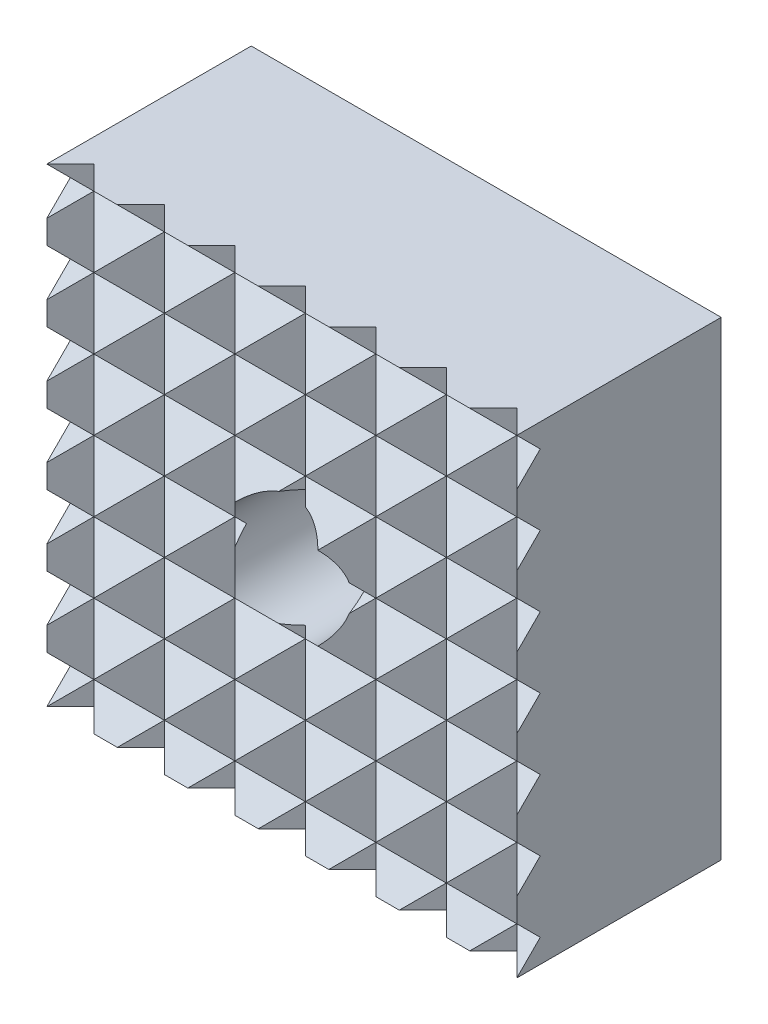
ISO-10303-21;
HEADER;
FILE_DESCRIPTION(('STEP AP214'),'2;1');
FILE_NAME('part.step','',(''),(''),'','','');
FILE_SCHEMA(('AUTOMOTIVE_DESIGN { 1 0 10303 214 1 1 1 1 }'));
ENDSEC;
DATA;
#1=APPLICATION_CONTEXT('core data for automotive mechanical design processes');
#2=APPLICATION_PROTOCOL_DEFINITION('international standard','automotive_design',2000,#1);
#3=PRODUCT_CONTEXT('',#1,'mechanical');
#4=PRODUCT('Part','Part','',(#3));
#5=PRODUCT_RELATED_PRODUCT_CATEGORY('part','',(#4));
#6=PRODUCT_DEFINITION_FORMATION('','',#4);
#7=PRODUCT_DEFINITION_CONTEXT('part definition',#1,'design');
#8=PRODUCT_DEFINITION('design','',#6,#7);
#9=PRODUCT_DEFINITION_SHAPE('','',#8);
#10=(LENGTH_UNIT() NAMED_UNIT(*) SI_UNIT(.MILLI.,.METRE.));
#11=(NAMED_UNIT(*) PLANE_ANGLE_UNIT() SI_UNIT($,.RADIAN.));
#12=(NAMED_UNIT(*) SI_UNIT($,.STERADIAN.) SOLID_ANGLE_UNIT());
#13=UNCERTAINTY_MEASURE_WITH_UNIT(LENGTH_MEASURE(1.E-05),#10,'distance_accuracy_value','');
#14=(GEOMETRIC_REPRESENTATION_CONTEXT(3) GLOBAL_UNCERTAINTY_ASSIGNED_CONTEXT((#13)) GLOBAL_UNIT_ASSIGNED_CONTEXT((#10,
#11,#12)) REPRESENTATION_CONTEXT('',''));
#15=CARTESIAN_POINT('',(0.,0.,0.));
#16=DIRECTION('',(0.,0.,1.));
#17=DIRECTION('',(1.,0.,0.));
#18=AXIS2_PLACEMENT_3D('',#15,#16,#17);
#19=CARTESIAN_POINT('',(-15.,-3.,8.5));
#20=DIRECTION('',(0.,-0.707106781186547,-0.707106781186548));
#21=DIRECTION('',(0.,0.707106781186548,-0.707106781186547));
#22=AXIS2_PLACEMENT_3D('',#19,#20,#21);
#23=PLANE('',#22);
#24=DIRECTION('',(1.,0.,0.));
#25=VECTOR('',#24,1.);
#26=CARTESIAN_POINT('',(-15.,-3.,8.5));
#27=LINE('',#26,#25);
#28=CARTESIAN_POINT('',(9.,-3.,8.5));
#29=VERTEX_POINT('',#28);
#30=CARTESIAN_POINT('',(10.,-3.,8.5));
#31=VERTEX_POINT('',#30);
#32=EDGE_CURVE('E636',#29,#31,#27,.T.);
#33=ORIENTED_EDGE('',*,*,#32,.F.);
#34=DIRECTION('',(0.577350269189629,-0.577350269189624,0.577350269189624));
#35=VECTOR('',#34,1.);
#36=CARTESIAN_POINT('',(0.999999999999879,5.,0.499999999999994));
#37=LINE('',#36,#35);
#38=CARTESIAN_POINT('',(10.,-4.,9.5));
#39=VERTEX_POINT('',#38);
#40=EDGE_CURVE('E890',#29,#39,#37,.T.);
#41=ORIENTED_EDGE('',*,*,#40,.T.);
#42=DIRECTION('',(0.,-0.707106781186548,0.707106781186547));
#43=VECTOR('',#42,1.);
#44=CARTESIAN_POINT('',(10.,-7.25,12.75));
#45=LINE('',#44,#43);
#46=EDGE_CURVE('E790',#31,#39,#45,.T.);
#47=ORIENTED_EDGE('',*,*,#46,.F.);
#48=EDGE_LOOP('',(#33,#41,#47));
#49=FACE_BOUND('',#48,.T.);
#50=ADVANCED_FACE('F15',(#49),#23,.F.);
#51=DIRECTION('',(0.577350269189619,-0.577350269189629,0.577350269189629));
#52=VECTOR('',#51,1.);
#53=CARTESIAN_POINT('',(-4.99999999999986,2.,3.5));
#54=LINE('',#53,#52);
#55=CARTESIAN_POINT('',(0.,-3.,8.5));
#56=VERTEX_POINT('',#55);
#57=CARTESIAN_POINT('',(1.5,-4.5,10.));
#58=VERTEX_POINT('',#57);
#59=EDGE_CURVE('E1168',#56,#58,#54,.T.);
#60=ORIENTED_EDGE('',*,*,#59,.T.);
#61=DIRECTION('',(0.577350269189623,0.577350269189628,-0.577350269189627));
#62=VECTOR('',#61,1.);
#63=CARTESIAN_POINT('',(-2.99999999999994,-9.,14.5));
#64=LINE('',#63,#62);
#65=CARTESIAN_POINT('',(3.,-3.,8.5));
#66=VERTEX_POINT('',#65);
#67=EDGE_CURVE('E1124',#58,#66,#64,.T.);
#68=ORIENTED_EDGE('',*,*,#67,.T.);
#69=EDGE_CURVE('E845',#56,#66,#27,.T.);
#70=ORIENTED_EDGE('',*,*,#69,.F.);
#71=EDGE_LOOP('',(#60,#68,#70));
#72=FACE_BOUND('',#71,.T.);
#73=ADVANCED_FACE('F1643',(#72),#23,.F.);
#74=DIRECTION('',(0.,0.707106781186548,-0.707106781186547));
#75=VECTOR('',#74,1.);
#76=CARTESIAN_POINT('',(-10.,2.75,2.75));
#77=LINE('',#76,#75);
#78=CARTESIAN_POINT('',(-10.,-4.00000000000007,9.5));
#79=VERTEX_POINT('',#78);
#80=CARTESIAN_POINT('',(-10.,-3.,8.5));
#81=VERTEX_POINT('',#80);
#82=EDGE_CURVE('E711',#79,#81,#77,.T.);
#83=ORIENTED_EDGE('',*,*,#82,.F.);
#84=DIRECTION('',(0.577350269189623,0.577350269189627,-0.577350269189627));
#85=VECTOR('',#84,1.);
#86=CARTESIAN_POINT('',(-11.,-5.,10.5));
#87=LINE('',#86,#85);
#88=CARTESIAN_POINT('',(-9.,-3.,8.5));
#89=VERTEX_POINT('',#88);
#90=EDGE_CURVE('E1436',#79,#89,#87,.T.);
#91=ORIENTED_EDGE('',*,*,#90,.T.);
#92=EDGE_CURVE('E631',#81,#89,#27,.T.);
#93=ORIENTED_EDGE('',*,*,#92,.F.);
#94=EDGE_LOOP('',(#83,#91,#93));
#95=FACE_BOUND('',#94,.T.);
#96=ADVANCED_FACE('F1650',(#95),#23,.F.);
#97=DIRECTION('',(0.577350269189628,-0.577350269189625,0.577350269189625));
#98=VECTOR('',#97,1.);
#99=CARTESIAN_POINT('',(-7.,1.00000000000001,4.5));
#100=LINE('',#99,#98);
#101=CARTESIAN_POINT('',(-3.,-3.,8.5));
#102=VERTEX_POINT('',#101);
#103=CARTESIAN_POINT('',(-1.49999999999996,-4.5,10.));
#104=VERTEX_POINT('',#103);
#105=EDGE_CURVE('E857',#102,#104,#100,.T.);
#106=ORIENTED_EDGE('',*,*,#105,.T.);
#107=DIRECTION('',(0.577350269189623,0.577350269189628,-0.577350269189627));
#108=VECTOR('',#107,1.);
#109=CARTESIAN_POINT('',(-4.99999999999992,-8.,13.5));
#110=LINE('',#109,#108);
#111=EDGE_CURVE('E853',#104,#56,#110,.T.);
#112=ORIENTED_EDGE('',*,*,#111,.T.);
#113=EDGE_CURVE('E856',#102,#56,#27,.T.);
#114=ORIENTED_EDGE('',*,*,#113,.F.);
#115=EDGE_LOOP('',(#106,#112,#114));
#116=FACE_BOUND('',#115,.T.);
#117=ADVANCED_FACE('F855',(#116),#23,.F.);
#118=CARTESIAN_POINT('',(-15.,-4.5,10.));
#119=DIRECTION('',(0.,0.707106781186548,-0.707106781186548));
#120=DIRECTION('',(0.,0.707106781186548,0.707106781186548));
#121=AXIS2_PLACEMENT_3D('',#118,#119,#120);
#122=PLANE('',#121);
#123=DIRECTION('',(0.,-0.707106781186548,-0.707106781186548));
#124=VECTOR('',#123,1.);
#125=CARTESIAN_POINT('',(10.,-7.25,7.25));
#126=LINE('',#125,#124);
#127=CARTESIAN_POINT('',(10.,-5.,9.5));
#128=VERTEX_POINT('',#127);
#129=CARTESIAN_POINT('',(10.,-6.,8.5));
#130=VERTEX_POINT('',#129);
#131=EDGE_CURVE('E793',#128,#130,#126,.T.);
#132=ORIENTED_EDGE('',*,*,#131,.F.);
#133=DIRECTION('',(-0.577350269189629,-0.577350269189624,-0.577350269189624));
#134=VECTOR('',#133,1.);
#135=CARTESIAN_POINT('',(1.99999999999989,-13.,1.49999999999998));
#136=LINE('',#135,#134);
#137=CARTESIAN_POINT('',(9.,-6.,8.5));
#138=VERTEX_POINT('',#137);
#139=EDGE_CURVE('E911',#128,#138,#136,.T.);
#140=ORIENTED_EDGE('',*,*,#139,.T.);
#141=DIRECTION('',(1.,0.,0.));
#142=VECTOR('',#141,1.);
#143=CARTESIAN_POINT('',(-15.,-6.,8.5));
#144=LINE('',#143,#142);
#145=EDGE_CURVE('E641',#138,#130,#144,.T.);
#146=ORIENTED_EDGE('',*,*,#145,.T.);
#147=EDGE_LOOP('',(#132,#140,#146));
#148=FACE_BOUND('',#147,.T.);
#149=ADVANCED_FACE('F1676',(#148),#122,.F.);
#150=CARTESIAN_POINT('',(-10.,-6.,8.5));
#151=VERTEX_POINT('',#150);
#152=CARTESIAN_POINT('',(-9.,-6.,8.5));
#153=VERTEX_POINT('',#152);
#154=EDGE_CURVE('E637',#151,#153,#144,.T.);
#155=ORIENTED_EDGE('',*,*,#154,.T.);
#156=DIRECTION('',(-0.577350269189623,0.577350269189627,0.577350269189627));
#157=VECTOR('',#156,1.);
#158=CARTESIAN_POINT('',(-12.,-3.,11.5));
#159=LINE('',#158,#157);
#160=CARTESIAN_POINT('',(-10.,-4.99999999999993,9.5));
#161=VERTEX_POINT('',#160);
#162=EDGE_CURVE('E1450',#153,#161,#159,.T.);
#163=ORIENTED_EDGE('',*,*,#162,.T.);
#164=DIRECTION('',(0.,0.707106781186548,0.707106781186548));
#165=VECTOR('',#164,1.);
#166=CARTESIAN_POINT('',(-10.,2.75,17.25));
#167=LINE('',#166,#165);
#168=EDGE_CURVE('E708',#151,#161,#167,.T.);
#169=ORIENTED_EDGE('',*,*,#168,.F.);
#170=EDGE_LOOP('',(#155,#163,#169));
#171=FACE_BOUND('',#170,.T.);
#172=ADVANCED_FACE('F1682',(#171),#122,.F.);
#173=CARTESIAN_POINT('',(-15.,-6.,8.5));
#174=DIRECTION('',(0.,-0.707106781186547,-0.707106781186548));
#175=DIRECTION('',(0.,0.707106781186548,-0.707106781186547));
#176=AXIS2_PLACEMENT_3D('',#173,#174,#175);
#177=PLANE('',#176);
#178=ORIENTED_EDGE('',*,*,#145,.F.);
#179=DIRECTION('',(0.577350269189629,-0.577350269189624,0.577350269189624));
#180=VECTOR('',#179,1.);
#181=CARTESIAN_POINT('',(0.999999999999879,2.,0.499999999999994));
#182=LINE('',#181,#180);
#183=CARTESIAN_POINT('',(10.,-7.,9.5));
#184=VERTEX_POINT('',#183);
#185=EDGE_CURVE('E921',#138,#184,#182,.T.);
#186=ORIENTED_EDGE('',*,*,#185,.T.);
#187=DIRECTION('',(0.,-0.707106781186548,0.707106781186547));
#188=VECTOR('',#187,1.);
#189=CARTESIAN_POINT('',(10.,-8.75,11.25));
#190=LINE('',#189,#188);
#191=EDGE_CURVE('E795',#130,#184,#190,.T.);
#192=ORIENTED_EDGE('',*,*,#191,.F.);
#193=EDGE_LOOP('',(#178,#186,#192));
#194=FACE_BOUND('',#193,.T.);
#195=ADVANCED_FACE('F2517',(#194),#177,.F.);
#196=DIRECTION('',(0.,0.707106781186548,-0.707106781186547));
#197=VECTOR('',#196,1.);
#198=CARTESIAN_POINT('',(-10.,1.25,1.25));
#199=LINE('',#198,#197);
#200=CARTESIAN_POINT('',(-10.,-7.,9.5));
#201=VERTEX_POINT('',#200);
#202=EDGE_CURVE('E706',#201,#151,#199,.T.);
#203=ORIENTED_EDGE('',*,*,#202,.F.);
#204=DIRECTION('',(0.577350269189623,0.577350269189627,-0.577350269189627));
#205=VECTOR('',#204,1.);
#206=CARTESIAN_POINT('',(-11.,-8.,10.5));
#207=LINE('',#206,#205);
#208=EDGE_CURVE('E1460',#201,#153,#207,.T.);
#209=ORIENTED_EDGE('',*,*,#208,.T.);
#210=ORIENTED_EDGE('',*,*,#154,.F.);
#211=EDGE_LOOP('',(#203,#209,#210));
#212=FACE_BOUND('',#211,.T.);
#213=ADVANCED_FACE('F2488',(#212),#177,.F.);
#214=CARTESIAN_POINT('',(-15.,-7.5,10.));
#215=DIRECTION('',(0.,0.707106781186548,-0.707106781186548));
#216=DIRECTION('',(0.,0.707106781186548,0.707106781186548));
#217=AXIS2_PLACEMENT_3D('',#214,#215,#216);
#218=PLANE('',#217);
#219=DIRECTION('',(0.,-0.707106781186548,-0.707106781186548));
#220=VECTOR('',#219,1.);
#221=CARTESIAN_POINT('',(10.,-8.75,8.75));
#222=LINE('',#221,#220);
#223=CARTESIAN_POINT('',(10.,-8.,9.5));
#224=VERTEX_POINT('',#223);
#225=CARTESIAN_POINT('',(10.,-9.,8.5));
#226=VERTEX_POINT('',#225);
#227=EDGE_CURVE('E798',#224,#226,#222,.T.);
#228=ORIENTED_EDGE('',*,*,#227,.F.);
#229=DIRECTION('',(-0.577350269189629,-0.577350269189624,-0.577350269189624));
#230=VECTOR('',#229,1.);
#231=CARTESIAN_POINT('',(1.99999999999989,-16.,1.49999999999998));
#232=LINE('',#231,#230);
#233=CARTESIAN_POINT('',(9.,-9.,8.5));
#234=VERTEX_POINT('',#233);
#235=EDGE_CURVE('E938',#224,#234,#232,.T.);
#236=ORIENTED_EDGE('',*,*,#235,.T.);
#237=DIRECTION('',(1.,0.,0.));
#238=VECTOR('',#237,1.);
#239=CARTESIAN_POINT('',(-15.,-9.,8.5));
#240=LINE('',#239,#238);
#241=EDGE_CURVE('E646',#234,#226,#240,.T.);
#242=ORIENTED_EDGE('',*,*,#241,.T.);
#243=EDGE_LOOP('',(#228,#236,#242));
#244=FACE_BOUND('',#243,.T.);
#245=ADVANCED_FACE('F1945',(#244),#218,.F.);
#246=CARTESIAN_POINT('',(6.,-9.,8.5));
#247=VERTEX_POINT('',#246);
#248=EDGE_CURVE('E1937',#247,#234,#240,.T.);
#249=ORIENTED_EDGE('',*,*,#248,.T.);
#250=DIRECTION('',(-0.577350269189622,0.577350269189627,0.577350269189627));
#251=VECTOR('',#250,1.);
#252=CARTESIAN_POINT('',(0.,0.,17.5));
#253=LINE('',#252,#251);
#254=CARTESIAN_POINT('',(7.5,-7.5,10.));
#255=VERTEX_POINT('',#254);
#256=EDGE_CURVE('E988',#234,#255,#253,.T.);
#257=ORIENTED_EDGE('',*,*,#256,.T.);
#258=DIRECTION('',(-0.577350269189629,-0.577350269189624,-0.577350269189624));
#259=VECTOR('',#258,1.);
#260=CARTESIAN_POINT('',(0.,-15.,2.5));
#261=LINE('',#260,#259);
#262=EDGE_CURVE('E1031',#255,#247,#261,.T.);
#263=ORIENTED_EDGE('',*,*,#262,.T.);
#264=EDGE_LOOP('',(#249,#257,#263));
#265=FACE_BOUND('',#264,.T.);
#266=ADVANCED_FACE('F1936',(#265),#218,.F.);
#267=CARTESIAN_POINT('',(3.,-9.,8.5));
#268=VERTEX_POINT('',#267);
#269=EDGE_CURVE('E1939',#268,#247,#240,.T.);
#270=ORIENTED_EDGE('',*,*,#269,.T.);
#271=DIRECTION('',(-0.577350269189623,0.577350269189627,0.577350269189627));
#272=VECTOR('',#271,1.);
#273=CARTESIAN_POINT('',(-1.99999999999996,-1.00000000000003,16.5));
#274=LINE('',#273,#272);
#275=CARTESIAN_POINT('',(4.5,-7.5,10.));
#276=VERTEX_POINT('',#275);
#277=EDGE_CURVE('E1073',#247,#276,#274,.T.);
#278=ORIENTED_EDGE('',*,*,#277,.T.);
#279=DIRECTION('',(-0.57735026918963,-0.577350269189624,-0.577350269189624));
#280=VECTOR('',#279,1.);
#281=CARTESIAN_POINT('',(-2.00000000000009,-14.,3.5));
#282=LINE('',#281,#280);
#283=EDGE_CURVE('E1116',#276,#268,#282,.T.);
#284=ORIENTED_EDGE('',*,*,#283,.T.);
#285=EDGE_LOOP('',(#270,#278,#284));
#286=FACE_BOUND('',#285,.T.);
#287=ADVANCED_FACE('F2161',(#286),#218,.F.);
#288=CARTESIAN_POINT('',(0.,-9.,8.5));
#289=VERTEX_POINT('',#288);
#290=EDGE_CURVE('E2162',#289,#268,#240,.T.);
#291=ORIENTED_EDGE('',*,*,#290,.T.);
#292=DIRECTION('',(-0.577350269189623,0.577350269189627,0.577350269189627));
#293=VECTOR('',#292,1.);
#294=CARTESIAN_POINT('',(-3.99999999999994,-2.,15.5));
#295=LINE('',#294,#293);
#296=CARTESIAN_POINT('',(1.5,-7.5,10.));
#297=VERTEX_POINT('',#296);
#298=EDGE_CURVE('E1158',#268,#297,#295,.T.);
#299=ORIENTED_EDGE('',*,*,#298,.T.);
#300=DIRECTION('',(-0.577350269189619,-0.577350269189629,-0.577350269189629));
#301=VECTOR('',#300,1.);
#302=CARTESIAN_POINT('',(-3.99999999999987,-13.,4.5));
#303=LINE('',#302,#301);
#304=EDGE_CURVE('E1178',#297,#289,#303,.T.);
#305=ORIENTED_EDGE('',*,*,#304,.T.);
#306=EDGE_LOOP('',(#291,#299,#305));
#307=FACE_BOUND('',#306,.T.);
#308=ADVANCED_FACE('F2320',(#307),#218,.F.);
#309=CARTESIAN_POINT('',(-10.,-9.,8.5));
#310=VERTEX_POINT('',#309);
#311=CARTESIAN_POINT('',(-9.,-9.,8.5));
#312=VERTEX_POINT('',#311);
#313=EDGE_CURVE('E642',#310,#312,#240,.T.);
#314=ORIENTED_EDGE('',*,*,#313,.T.);
#315=DIRECTION('',(-0.577350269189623,0.577350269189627,0.577350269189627));
#316=VECTOR('',#315,1.);
#317=CARTESIAN_POINT('',(-12.,-6.,11.5));
#318=LINE('',#317,#316);
#319=CARTESIAN_POINT('',(-10.,-8.,9.5));
#320=VERTEX_POINT('',#319);
#321=EDGE_CURVE('E1471',#312,#320,#318,.T.);
#322=ORIENTED_EDGE('',*,*,#321,.T.);
#323=DIRECTION('',(0.,0.707106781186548,0.707106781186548));
#324=VECTOR('',#323,1.);
#325=CARTESIAN_POINT('',(-10.,1.25,18.75));
#326=LINE('',#325,#324);
#327=EDGE_CURVE('E703',#310,#320,#326,.T.);
#328=ORIENTED_EDGE('',*,*,#327,.F.);
#329=EDGE_LOOP('',(#314,#322,#328));
#330=FACE_BOUND('',#329,.T.);
#331=ADVANCED_FACE('F1536',(#330),#218,.F.);
#332=DIRECTION('',(-0.577350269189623,0.577350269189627,0.577350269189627));
#333=VECTOR('',#332,1.);
#334=CARTESIAN_POINT('',(-10.,-5.,12.5));
#335=LINE('',#334,#333);
#336=CARTESIAN_POINT('',(-6.,-9.,8.5));
#337=VERTEX_POINT('',#336);
#338=CARTESIAN_POINT('',(-7.5,-7.5,10.));
#339=VERTEX_POINT('',#338);
#340=EDGE_CURVE('E1385',#337,#339,#335,.T.);
#341=ORIENTED_EDGE('',*,*,#340,.T.);
#342=DIRECTION('',(-0.577350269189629,-0.577350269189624,-0.577350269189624));
#343=VECTOR('',#342,1.);
#344=CARTESIAN_POINT('',(-10.,-10.,7.5));
#345=LINE('',#344,#343);
#346=EDGE_CURVE('E1428',#339,#312,#345,.T.);
#347=ORIENTED_EDGE('',*,*,#346,.T.);
#348=EDGE_CURVE('E645',#312,#337,#240,.T.);
#349=ORIENTED_EDGE('',*,*,#348,.T.);
#350=EDGE_LOOP('',(#341,#347,#349));
#351=FACE_BOUND('',#350,.T.);
#352=ADVANCED_FACE('F2172',(#351),#218,.F.);
#353=CARTESIAN_POINT('',(-3.,-9.,8.5));
#354=VERTEX_POINT('',#353);
#355=EDGE_CURVE('E2163',#354,#289,#240,.T.);
#356=ORIENTED_EDGE('',*,*,#355,.T.);
#357=DIRECTION('',(-0.577350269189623,0.577350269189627,0.577350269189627));
#358=VECTOR('',#357,1.);
#359=CARTESIAN_POINT('',(-5.99999999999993,-3.,14.5));
#360=LINE('',#359,#358);
#361=CARTESIAN_POINT('',(-1.49999999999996,-7.5,10.));
#362=VERTEX_POINT('',#361);
#363=EDGE_CURVE('E1212',#289,#362,#360,.T.);
#364=ORIENTED_EDGE('',*,*,#363,.T.);
#365=DIRECTION('',(-0.577350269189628,-0.577350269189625,-0.577350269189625));
#366=VECTOR('',#365,1.);
#367=CARTESIAN_POINT('',(-6.,-12.,5.5));
#368=LINE('',#367,#366);
#369=EDGE_CURVE('E1272',#362,#354,#368,.T.);
#370=ORIENTED_EDGE('',*,*,#369,.T.);
#371=EDGE_LOOP('',(#356,#364,#370));
#372=FACE_BOUND('',#371,.T.);
#373=ADVANCED_FACE('F2332',(#372),#218,.F.);
#374=CARTESIAN_POINT('',(-15.,-9.,8.5));
#375=DIRECTION('',(0.,-0.707106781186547,-0.707106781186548));
#376=DIRECTION('',(0.,0.707106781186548,-0.707106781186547));
#377=AXIS2_PLACEMENT_3D('',#374,#375,#376);
#378=PLANE('',#377);
#379=DIRECTION('',(1.,0.,0.));
#380=VECTOR('',#379,1.);
#381=CARTESIAN_POINT('',(10.,-10.,9.5));
#382=LINE('',#381,#380);
#383=CARTESIAN_POINT('',(-1.99999999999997,-10.,9.5));
#384=VERTEX_POINT('',#383);
#385=CARTESIAN_POINT('',(-0.999999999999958,-10.,9.5));
#386=VERTEX_POINT('',#385);
#387=EDGE_CURVE('E614',#384,#386,#382,.T.);
#388=ORIENTED_EDGE('',*,*,#387,.T.);
#389=DIRECTION('',(0.577350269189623,0.577350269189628,-0.577350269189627));
#390=VECTOR('',#389,1.);
#391=CARTESIAN_POINT('',(-4.99999999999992,-14.,13.5));
#392=LINE('',#391,#390);
#393=EDGE_CURVE('E1215',#386,#289,#392,.T.);
#394=ORIENTED_EDGE('',*,*,#393,.T.);
#395=ORIENTED_EDGE('',*,*,#355,.F.);
#396=DIRECTION('',(0.577350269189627,-0.577350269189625,0.577350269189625));
#397=VECTOR('',#396,1.);
#398=CARTESIAN_POINT('',(-7.,-5.,4.5));
#399=LINE('',#398,#397);
#400=EDGE_CURVE('E604',#354,#384,#399,.T.);
#401=ORIENTED_EDGE('',*,*,#400,.T.);
#402=EDGE_LOOP('',(#388,#394,#395,#401));
#403=FACE_BOUND('',#402,.T.);
#404=ADVANCED_FACE('F2333',(#403),#378,.F.);
#405=ORIENTED_EDGE('',*,*,#290,.F.);
#406=DIRECTION('',(0.577350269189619,-0.57735026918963,0.577350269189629));
#407=VECTOR('',#406,1.);
#408=CARTESIAN_POINT('',(-4.99999999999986,-4.,3.5));
#409=LINE('',#408,#407);
#410=CARTESIAN_POINT('',(1.00000000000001,-10.,9.5));
#411=VERTEX_POINT('',#410);
#412=EDGE_CURVE('E1181',#289,#411,#409,.T.);
#413=ORIENTED_EDGE('',*,*,#412,.T.);
#414=CARTESIAN_POINT('',(2.,-10.,9.5));
#415=VERTEX_POINT('',#414);
#416=EDGE_CURVE('E1834',#411,#415,#382,.T.);
#417=ORIENTED_EDGE('',*,*,#416,.T.);
#418=DIRECTION('',(0.577350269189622,0.577350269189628,-0.577350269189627));
#419=VECTOR('',#418,1.);
#420=CARTESIAN_POINT('',(-2.99999999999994,-15.,14.5));
#421=LINE('',#420,#419);
#422=EDGE_CURVE('E1163',#415,#268,#421,.T.);
#423=ORIENTED_EDGE('',*,*,#422,.T.);
#424=EDGE_LOOP('',(#405,#413,#417,#423));
#425=FACE_BOUND('',#424,.T.);
#426=ADVANCED_FACE('F2338',(#425),#378,.F.);
#427=ORIENTED_EDGE('',*,*,#269,.F.);
#428=DIRECTION('',(0.577350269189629,-0.577350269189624,0.577350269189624));
#429=VECTOR('',#428,1.);
#430=CARTESIAN_POINT('',(-3.00000000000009,-3.,2.5));
#431=LINE('',#430,#429);
#432=CARTESIAN_POINT('',(4.,-10.,9.5));
#433=VERTEX_POINT('',#432);
#434=EDGE_CURVE('E1119',#268,#433,#431,.T.);
#435=ORIENTED_EDGE('',*,*,#434,.T.);
#436=CARTESIAN_POINT('',(5.,-10.,9.5));
#437=VERTEX_POINT('',#436);
#438=EDGE_CURVE('E698',#433,#437,#382,.T.);
#439=ORIENTED_EDGE('',*,*,#438,.T.);
#440=DIRECTION('',(0.577350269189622,0.577350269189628,-0.577350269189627));
#441=VECTOR('',#440,1.);
#442=CARTESIAN_POINT('',(-0.999999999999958,-16.,15.5));
#443=LINE('',#442,#441);
#444=EDGE_CURVE('E1076',#437,#247,#443,.T.);
#445=ORIENTED_EDGE('',*,*,#444,.T.);
#446=EDGE_LOOP('',(#427,#435,#439,#445));
#447=FACE_BOUND('',#446,.T.);
#448=ADVANCED_FACE('F1843',(#447),#378,.F.);
#449=ORIENTED_EDGE('',*,*,#248,.F.);
#450=DIRECTION('',(0.577350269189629,-0.577350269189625,0.577350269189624));
#451=VECTOR('',#450,1.);
#452=CARTESIAN_POINT('',(-1.00000000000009,-2.,1.5));
#453=LINE('',#452,#451);
#454=CARTESIAN_POINT('',(7.,-10.,9.5));
#455=VERTEX_POINT('',#454);
#456=EDGE_CURVE('E1034',#247,#455,#453,.T.);
#457=ORIENTED_EDGE('',*,*,#456,.T.);
#458=CARTESIAN_POINT('',(8.,-10.,9.5));
#459=VERTEX_POINT('',#458);
#460=EDGE_CURVE('E695',#455,#459,#382,.T.);
#461=ORIENTED_EDGE('',*,*,#460,.T.);
#462=DIRECTION('',(0.577350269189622,0.577350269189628,-0.577350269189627));
#463=VECTOR('',#462,1.);
#464=CARTESIAN_POINT('',(1.00000000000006,-17.,16.5));
#465=LINE('',#464,#463);
#466=EDGE_CURVE('E991',#459,#234,#465,.T.);
#467=ORIENTED_EDGE('',*,*,#466,.T.);
#468=EDGE_LOOP('',(#449,#457,#461,#467));
#469=FACE_BOUND('',#468,.T.);
#470=ADVANCED_FACE('F1940',(#469),#378,.F.);
#471=DIRECTION('',(0.,0.707106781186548,-0.707106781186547));
#472=VECTOR('',#471,1.);
#473=CARTESIAN_POINT('',(-10.,-0.249999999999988,-0.25));
#474=LINE('',#473,#472);
#475=CARTESIAN_POINT('',(-10.,-10.,9.5));
#476=VERTEX_POINT('',#475);
#477=EDGE_CURVE('E700',#476,#310,#474,.T.);
#478=ORIENTED_EDGE('',*,*,#477,.F.);
#479=DIRECTION('',(0.577350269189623,0.577350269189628,-0.577350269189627));
#480=VECTOR('',#479,1.);
#481=CARTESIAN_POINT('',(-11.,-11.,10.5));
#482=LINE('',#481,#480);
#483=EDGE_CURVE('E1477',#476,#312,#482,.T.);
#484=ORIENTED_EDGE('',*,*,#483,.T.);
#485=ORIENTED_EDGE('',*,*,#313,.F.);
#486=EDGE_LOOP('',(#478,#484,#485));
#487=FACE_BOUND('',#486,.T.);
#488=ADVANCED_FACE('F1532',(#487),#378,.F.);
#489=ORIENTED_EDGE('',*,*,#348,.F.);
#490=DIRECTION('',(0.577350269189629,-0.577350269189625,0.577350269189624));
#491=VECTOR('',#490,1.);
#492=CARTESIAN_POINT('',(-11.,-7.,6.5));
#493=LINE('',#492,#491);
#494=CARTESIAN_POINT('',(-8.,-10.,9.5));
#495=VERTEX_POINT('',#494);
#496=EDGE_CURVE('E1431',#312,#495,#493,.T.);
#497=ORIENTED_EDGE('',*,*,#496,.T.);
#498=CARTESIAN_POINT('',(-7.,-10.,9.5));
#499=VERTEX_POINT('',#498);
#500=EDGE_CURVE('E699',#495,#499,#382,.T.);
#501=ORIENTED_EDGE('',*,*,#500,.T.);
#502=DIRECTION('',(0.577350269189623,0.577350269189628,-0.577350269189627));
#503=VECTOR('',#502,1.);
#504=CARTESIAN_POINT('',(-9.,-12.,11.5));
#505=LINE('',#504,#503);
#506=EDGE_CURVE('E1388',#499,#337,#505,.T.);
#507=ORIENTED_EDGE('',*,*,#506,.T.);
#508=EDGE_LOOP('',(#489,#497,#501,#507));
#509=FACE_BOUND('',#508,.T.);
#510=ADVANCED_FACE('F2174',(#509),#378,.F.);
#511=ORIENTED_EDGE('',*,*,#241,.F.);
#512=DIRECTION('',(0.577350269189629,-0.577350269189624,0.577350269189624));
#513=VECTOR('',#512,1.);
#514=CARTESIAN_POINT('',(0.999999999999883,-0.999999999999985,0.5));
#515=LINE('',#514,#513);
#516=CARTESIAN_POINT('',(10.,-10.,9.5));
#517=VERTEX_POINT('',#516);
#518=EDGE_CURVE('E944',#234,#517,#515,.T.);
#519=ORIENTED_EDGE('',*,*,#518,.T.);
#520=DIRECTION('',(0.,-0.707106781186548,0.707106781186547));
#521=VECTOR('',#520,1.);
#522=CARTESIAN_POINT('',(10.,-10.25,9.75));
#523=LINE('',#522,#521);
#524=EDGE_CURVE('E800',#226,#517,#523,.T.);
#525=ORIENTED_EDGE('',*,*,#524,.F.);
#526=EDGE_LOOP('',(#511,#519,#525));
#527=FACE_BOUND('',#526,.T.);
#528=ADVANCED_FACE('F1949',(#527),#378,.F.);
#529=CARTESIAN_POINT('',(-15.,9.,8.5));
#530=DIRECTION('',(0.,-0.707106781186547,-0.707106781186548));
#531=DIRECTION('',(0.,0.707106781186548,-0.707106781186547));
#532=AXIS2_PLACEMENT_3D('',#529,#530,#531);
#533=PLANE('',#532);
#534=DIRECTION('',(1.,0.,0.));
#535=VECTOR('',#534,1.);
#536=CARTESIAN_POINT('',(-15.,9.,8.5));
#537=LINE('',#536,#535);
#538=CARTESIAN_POINT('',(9.,9.,8.5));
#539=VERTEX_POINT('',#538);
#540=CARTESIAN_POINT('',(10.,9.,8.5));
#541=VERTEX_POINT('',#540);
#542=EDGE_CURVE('E651',#539,#541,#537,.T.);
#543=ORIENTED_EDGE('',*,*,#542,.F.);
#544=DIRECTION('',(0.577350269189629,-0.577350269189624,0.577350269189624));
#545=VECTOR('',#544,1.);
#546=CARTESIAN_POINT('',(0.999999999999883,17.,0.5));
#547=LINE('',#546,#545);
#548=CARTESIAN_POINT('',(10.,8.,9.5));
#549=VERTEX_POINT('',#548);
#550=EDGE_CURVE('E941',#539,#549,#547,.T.);
#551=ORIENTED_EDGE('',*,*,#550,.T.);
#552=DIRECTION('',(0.,-0.707106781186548,0.707106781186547));
#553=VECTOR('',#552,1.);
#554=CARTESIAN_POINT('',(10.,-1.25,18.75));
#555=LINE('',#554,#553);
#556=EDGE_CURVE('E787',#541,#549,#555,.T.);
#557=ORIENTED_EDGE('',*,*,#556,.F.);
#558=EDGE_LOOP('',(#543,#551,#557));
#559=FACE_BOUND('',#558,.T.);
#560=ADVANCED_FACE('F1614',(#559),#533,.F.);
#561=DIRECTION('',(0.577350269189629,-0.577350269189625,0.577350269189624));
#562=VECTOR('',#561,1.);
#563=CARTESIAN_POINT('',(-1.00000000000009,16.,1.5));
#564=LINE('',#563,#562);
#565=CARTESIAN_POINT('',(6.,9.,8.5));
#566=VERTEX_POINT('',#565);
#567=CARTESIAN_POINT('',(7.5,7.5,10.));
#568=VERTEX_POINT('',#567);
#569=EDGE_CURVE('E1014',#566,#568,#564,.T.);
#570=ORIENTED_EDGE('',*,*,#569,.T.);
#571=DIRECTION('',(0.577350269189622,0.577350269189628,-0.577350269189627));
#572=VECTOR('',#571,1.);
#573=CARTESIAN_POINT('',(1.00000000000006,1.00000000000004,16.5));
#574=LINE('',#573,#572);
#575=EDGE_CURVE('E972',#568,#539,#574,.T.);
#576=ORIENTED_EDGE('',*,*,#575,.T.);
#577=EDGE_CURVE('E1602',#566,#539,#537,.T.);
#578=ORIENTED_EDGE('',*,*,#577,.F.);
#579=EDGE_LOOP('',(#570,#576,#578));
#580=FACE_BOUND('',#579,.T.);
#581=ADVANCED_FACE('F3792',(#580),#533,.F.);
#582=DIRECTION('',(0.577350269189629,-0.577350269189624,0.577350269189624));
#583=VECTOR('',#582,1.);
#584=CARTESIAN_POINT('',(-3.00000000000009,15.,2.5));
#585=LINE('',#584,#583);
#586=CARTESIAN_POINT('',(3.,9.,8.5));
#587=VERTEX_POINT('',#586);
#588=CARTESIAN_POINT('',(4.5,7.5,10.));
#589=VERTEX_POINT('',#588);
#590=EDGE_CURVE('E1099',#587,#589,#585,.T.);
#591=ORIENTED_EDGE('',*,*,#590,.T.);
#592=DIRECTION('',(0.577350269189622,0.577350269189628,-0.577350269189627));
#593=VECTOR('',#592,1.);
#594=CARTESIAN_POINT('',(-0.999999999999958,2.00000000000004,15.5));
#595=LINE('',#594,#593);
#596=EDGE_CURVE('E1057',#589,#566,#595,.T.);
#597=ORIENTED_EDGE('',*,*,#596,.T.);
#598=EDGE_CURVE('E1598',#587,#566,#537,.T.);
#599=ORIENTED_EDGE('',*,*,#598,.F.);
#600=EDGE_LOOP('',(#591,#597,#599));
#601=FACE_BOUND('',#600,.T.);
#602=ADVANCED_FACE('F3784',(#601),#533,.F.);
#603=DIRECTION('',(0.577350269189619,-0.57735026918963,0.577350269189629));
#604=VECTOR('',#603,1.);
#605=CARTESIAN_POINT('',(-4.99999999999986,14.,3.5));
#606=LINE('',#605,#604);
#607=CARTESIAN_POINT('',(0.,9.,8.5));
#608=VERTEX_POINT('',#607);
#609=CARTESIAN_POINT('',(1.5,7.5,10.));
#610=VERTEX_POINT('',#609);
#611=EDGE_CURVE('E1198',#608,#610,#606,.T.);
#612=ORIENTED_EDGE('',*,*,#611,.T.);
#613=DIRECTION('',(0.577350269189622,0.577350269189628,-0.577350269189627));
#614=VECTOR('',#613,1.);
#615=CARTESIAN_POINT('',(-2.99999999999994,3.,14.5));
#616=LINE('',#615,#614);
#617=EDGE_CURVE('E1150',#610,#587,#616,.T.);
#618=ORIENTED_EDGE('',*,*,#617,.T.);
#619=EDGE_CURVE('E1594',#608,#587,#537,.T.);
#620=ORIENTED_EDGE('',*,*,#619,.F.);
#621=EDGE_LOOP('',(#612,#618,#620));
#622=FACE_BOUND('',#621,.T.);
#623=ADVANCED_FACE('F2235',(#622),#533,.F.);
#624=DIRECTION('',(0.,0.707106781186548,-0.707106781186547));
#625=VECTOR('',#624,1.);
#626=CARTESIAN_POINT('',(-10.,8.75,8.75));
#627=LINE('',#626,#625);
#628=CARTESIAN_POINT('',(-10.,8.,9.5));
#629=VERTEX_POINT('',#628);
#630=CARTESIAN_POINT('',(-10.,9.,8.5));
#631=VERTEX_POINT('',#630);
#632=EDGE_CURVE('E693',#629,#631,#627,.T.);
#633=ORIENTED_EDGE('',*,*,#632,.F.);
#634=DIRECTION('',(0.577350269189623,0.577350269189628,-0.577350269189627));
#635=VECTOR('',#634,1.);
#636=CARTESIAN_POINT('',(-11.,7.,10.5));
#637=LINE('',#636,#635);
#638=CARTESIAN_POINT('',(-9.,9.,8.5));
#639=VERTEX_POINT('',#638);
#640=EDGE_CURVE('E1474',#629,#639,#637,.T.);
#641=ORIENTED_EDGE('',*,*,#640,.T.);
#642=EDGE_CURVE('E647',#631,#639,#537,.T.);
#643=ORIENTED_EDGE('',*,*,#642,.F.);
#644=EDGE_LOOP('',(#633,#641,#643));
#645=FACE_BOUND('',#644,.T.);
#646=ADVANCED_FACE('F1717',(#645),#533,.F.);
#647=CARTESIAN_POINT('',(-6.,9.,8.5));
#648=VERTEX_POINT('',#647);
#649=EDGE_CURVE('E650',#639,#648,#537,.T.);
#650=ORIENTED_EDGE('',*,*,#649,.F.);
#651=DIRECTION('',(0.577350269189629,-0.577350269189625,0.577350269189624));
#652=VECTOR('',#651,1.);
#653=CARTESIAN_POINT('',(-11.,11.,6.5));
#654=LINE('',#653,#652);
#655=CARTESIAN_POINT('',(-7.5,7.5,10.));
#656=VERTEX_POINT('',#655);
#657=EDGE_CURVE('E1411',#639,#656,#654,.T.);
#658=ORIENTED_EDGE('',*,*,#657,.T.);
#659=DIRECTION('',(0.577350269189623,0.577350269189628,-0.577350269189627));
#660=VECTOR('',#659,1.);
#661=CARTESIAN_POINT('',(-9.,6.,11.5));
#662=LINE('',#661,#660);
#663=EDGE_CURVE('E1368',#656,#648,#662,.T.);
#664=ORIENTED_EDGE('',*,*,#663,.T.);
#665=EDGE_LOOP('',(#650,#658,#664));
#666=FACE_BOUND('',#665,.T.);
#667=ADVANCED_FACE('F1725',(#666),#533,.F.);
#668=DIRECTION('',(0.577350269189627,-0.577350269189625,0.577350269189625));
#669=VECTOR('',#668,1.);
#670=CARTESIAN_POINT('',(-7.,13.,4.5));
#671=LINE('',#670,#669);
#672=CARTESIAN_POINT('',(-3.,9.,8.5));
#673=VERTEX_POINT('',#672);
#674=CARTESIAN_POINT('',(-1.49999999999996,7.5,10.));
#675=VERTEX_POINT('',#674);
#676=EDGE_CURVE('E1263',#673,#675,#671,.T.);
#677=ORIENTED_EDGE('',*,*,#676,.T.);
#678=DIRECTION('',(0.577350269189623,0.577350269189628,-0.577350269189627));
#679=VECTOR('',#678,1.);
#680=CARTESIAN_POINT('',(-4.99999999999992,4.,13.5));
#681=LINE('',#680,#679);
#682=EDGE_CURVE('E1232',#675,#608,#681,.T.);
#683=ORIENTED_EDGE('',*,*,#682,.T.);
#684=EDGE_CURVE('E1591',#673,#608,#537,.T.);
#685=ORIENTED_EDGE('',*,*,#684,.F.);
#686=EDGE_LOOP('',(#677,#683,#685));
#687=FACE_BOUND('',#686,.T.);
#688=ADVANCED_FACE('F2207',(#687),#533,.F.);
#689=CARTESIAN_POINT('',(-15.,7.5,10.));
#690=DIRECTION('',(0.,0.707106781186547,-0.707106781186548));
#691=DIRECTION('',(0.,0.707106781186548,0.707106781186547));
#692=AXIS2_PLACEMENT_3D('',#689,#690,#691);
#693=PLANE('',#692);
#694=DIRECTION('',(0.,-0.707106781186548,-0.707106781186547));
#695=VECTOR('',#694,1.);
#696=CARTESIAN_POINT('',(10.,-1.25,1.25));
#697=LINE('',#696,#695);
#698=CARTESIAN_POINT('',(10.,7.,9.5));
#699=VERTEX_POINT('',#698);
#700=CARTESIAN_POINT('',(10.,6.,8.5));
#701=VERTEX_POINT('',#700);
#702=EDGE_CURVE('E785',#699,#701,#697,.T.);
#703=ORIENTED_EDGE('',*,*,#702,.F.);
#704=DIRECTION('',(-0.577350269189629,-0.577350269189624,-0.577350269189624));
#705=VECTOR('',#704,1.);
#706=CARTESIAN_POINT('',(1.99999999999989,-1.00000000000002,1.49999999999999));
#707=LINE('',#706,#705);
#708=CARTESIAN_POINT('',(9.,6.,8.5));
#709=VERTEX_POINT('',#708);
#710=EDGE_CURVE('E935',#699,#709,#707,.T.);
#711=ORIENTED_EDGE('',*,*,#710,.T.);
#712=DIRECTION('',(1.,0.,0.));
#713=VECTOR('',#712,1.);
#714=CARTESIAN_POINT('',(-15.,6.,8.5));
#715=LINE('',#714,#713);
#716=EDGE_CURVE('E655',#709,#701,#715,.T.);
#717=ORIENTED_EDGE('',*,*,#716,.T.);
#718=EDGE_LOOP('',(#703,#711,#717));
#719=FACE_BOUND('',#718,.T.);
#720=ADVANCED_FACE('F2862',(#719),#693,.F.);
#721=CARTESIAN_POINT('',(-10.,6.,8.5));
#722=VERTEX_POINT('',#721);
#723=CARTESIAN_POINT('',(-9.,6.,8.5));
#724=VERTEX_POINT('',#723);
#725=EDGE_CURVE('E652',#722,#724,#715,.T.);
#726=ORIENTED_EDGE('',*,*,#725,.T.);
#727=DIRECTION('',(-0.577350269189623,0.577350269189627,0.577350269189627));
#728=VECTOR('',#727,1.);
#729=CARTESIAN_POINT('',(-12.,9.,11.5));
#730=LINE('',#729,#728);
#731=CARTESIAN_POINT('',(-10.,7.,9.5));
#732=VERTEX_POINT('',#731);
#733=EDGE_CURVE('E1467',#724,#732,#730,.T.);
#734=ORIENTED_EDGE('',*,*,#733,.T.);
#735=DIRECTION('',(0.,0.707106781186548,0.707106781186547));
#736=VECTOR('',#735,1.);
#737=CARTESIAN_POINT('',(-10.,8.75,11.25));
#738=LINE('',#737,#736);
#739=EDGE_CURVE('E690',#722,#732,#738,.T.);
#740=ORIENTED_EDGE('',*,*,#739,.F.);
#741=EDGE_LOOP('',(#726,#734,#740));
#742=FACE_BOUND('',#741,.T.);
#743=ADVANCED_FACE('F2830',(#742),#693,.F.);
#744=CARTESIAN_POINT('',(-15.,6.,8.5));
#745=DIRECTION('',(0.,-0.707106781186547,-0.707106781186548));
#746=DIRECTION('',(0.,0.707106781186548,-0.707106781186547));
#747=AXIS2_PLACEMENT_3D('',#744,#745,#746);
#748=PLANE('',#747);
#749=ORIENTED_EDGE('',*,*,#716,.F.);
#750=DIRECTION('',(0.577350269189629,-0.577350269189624,0.577350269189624));
#751=VECTOR('',#750,1.);
#752=CARTESIAN_POINT('',(0.999999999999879,14.,0.499999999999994));
#753=LINE('',#752,#751);
#754=CARTESIAN_POINT('',(10.,5.,9.5));
#755=VERTEX_POINT('',#754);
#756=EDGE_CURVE('E924',#709,#755,#753,.T.);
#757=ORIENTED_EDGE('',*,*,#756,.T.);
#758=DIRECTION('',(0.,-0.707106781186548,0.707106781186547));
#759=VECTOR('',#758,1.);
#760=CARTESIAN_POINT('',(10.,-2.75,17.25));
#761=LINE('',#760,#759);
#762=EDGE_CURVE('E782',#701,#755,#761,.T.);
#763=ORIENTED_EDGE('',*,*,#762,.F.);
#764=EDGE_LOOP('',(#749,#757,#763));
#765=FACE_BOUND('',#764,.T.);
#766=ADVANCED_FACE('F2870',(#765),#748,.F.);
#767=DIRECTION('',(0.,0.707106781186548,-0.707106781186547));
#768=VECTOR('',#767,1.);
#769=CARTESIAN_POINT('',(-10.,7.25,7.25));
#770=LINE('',#769,#768);
#771=CARTESIAN_POINT('',(-10.,4.99999999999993,9.5));
#772=VERTEX_POINT('',#771);
#773=EDGE_CURVE('E688',#772,#722,#770,.T.);
#774=ORIENTED_EDGE('',*,*,#773,.F.);
#775=DIRECTION('',(0.577350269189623,0.577350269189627,-0.577350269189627));
#776=VECTOR('',#775,1.);
#777=CARTESIAN_POINT('',(-11.,4.,10.5));
#778=LINE('',#777,#776);
#779=EDGE_CURVE('E1464',#772,#724,#778,.T.);
#780=ORIENTED_EDGE('',*,*,#779,.T.);
#781=ORIENTED_EDGE('',*,*,#725,.F.);
#782=EDGE_LOOP('',(#774,#780,#781));
#783=FACE_BOUND('',#782,.T.);
#784=ADVANCED_FACE('F2839',(#783),#748,.F.);
#785=CARTESIAN_POINT('',(-15.,4.5,10.));
#786=DIRECTION('',(0.,0.707106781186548,-0.707106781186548));
#787=DIRECTION('',(0.,0.707106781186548,0.707106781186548));
#788=AXIS2_PLACEMENT_3D('',#785,#786,#787);
#789=PLANE('',#788);
#790=DIRECTION('',(0.,-0.707106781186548,-0.707106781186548));
#791=VECTOR('',#790,1.);
#792=CARTESIAN_POINT('',(10.,-2.75,2.75));
#793=LINE('',#792,#791);
#794=CARTESIAN_POINT('',(10.,4.,9.5));
#795=VERTEX_POINT('',#794);
#796=CARTESIAN_POINT('',(10.,3.,8.5));
#797=VERTEX_POINT('',#796);
#798=EDGE_CURVE('E780',#795,#797,#793,.T.);
#799=ORIENTED_EDGE('',*,*,#798,.F.);
#800=DIRECTION('',(-0.577350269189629,-0.577350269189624,-0.577350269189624));
#801=VECTOR('',#800,1.);
#802=CARTESIAN_POINT('',(1.99999999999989,-4.,1.49999999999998));
#803=LINE('',#802,#801);
#804=CARTESIAN_POINT('',(9.,3.,8.5));
#805=VERTEX_POINT('',#804);
#806=EDGE_CURVE('E915',#795,#805,#803,.T.);
#807=ORIENTED_EDGE('',*,*,#806,.T.);
#808=DIRECTION('',(1.,0.,0.));
#809=VECTOR('',#808,1.);
#810=CARTESIAN_POINT('',(-15.,3.,8.5));
#811=LINE('',#810,#809);
#812=EDGE_CURVE('E615',#805,#797,#811,.T.);
#813=ORIENTED_EDGE('',*,*,#812,.T.);
#814=EDGE_LOOP('',(#799,#807,#813));
#815=FACE_BOUND('',#814,.T.);
#816=ADVANCED_FACE('F3116',(#815),#789,.F.);
#817=CARTESIAN_POINT('',(0.,3.,8.5));
#818=VERTEX_POINT('',#817);
#819=CARTESIAN_POINT('',(3.,3.,8.5));
#820=VERTEX_POINT('',#819);
#821=EDGE_CURVE('E2122',#818,#820,#811,.T.);
#822=ORIENTED_EDGE('',*,*,#821,.T.);
#823=DIRECTION('',(-0.577350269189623,0.577350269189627,0.577350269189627));
#824=VECTOR('',#823,1.);
#825=CARTESIAN_POINT('',(-3.99999999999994,10.,15.5));
#826=LINE('',#825,#824);
#827=CARTESIAN_POINT('',(1.5,4.5,10.));
#828=VERTEX_POINT('',#827);
#829=EDGE_CURVE('E1141',#820,#828,#826,.T.);
#830=ORIENTED_EDGE('',*,*,#829,.T.);
#831=DIRECTION('',(-0.577350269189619,-0.577350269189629,-0.577350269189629));
#832=VECTOR('',#831,1.);
#833=CARTESIAN_POINT('',(-3.99999999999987,-0.999999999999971,4.5));
#834=LINE('',#833,#832);
#835=EDGE_CURVE('E1189',#828,#818,#834,.T.);
#836=ORIENTED_EDGE('',*,*,#835,.T.);
#837=EDGE_LOOP('',(#822,#830,#836));
#838=FACE_BOUND('',#837,.T.);
#839=ADVANCED_FACE('F2121',(#838),#789,.F.);
#840=CARTESIAN_POINT('',(-10.,3.,8.5));
#841=VERTEX_POINT('',#840);
#842=CARTESIAN_POINT('',(-9.,3.,8.5));
#843=VERTEX_POINT('',#842);
#844=EDGE_CURVE('E620',#841,#843,#811,.T.);
#845=ORIENTED_EDGE('',*,*,#844,.T.);
#846=DIRECTION('',(-0.577350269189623,0.577350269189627,0.577350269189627));
#847=VECTOR('',#846,1.);
#848=CARTESIAN_POINT('',(-12.,6.,11.5));
#849=LINE('',#848,#847);
#850=CARTESIAN_POINT('',(-10.,4.00000000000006,9.5));
#851=VERTEX_POINT('',#850);
#852=EDGE_CURVE('E1457',#843,#851,#849,.T.);
#853=ORIENTED_EDGE('',*,*,#852,.T.);
#854=DIRECTION('',(0.,0.707106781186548,0.707106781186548));
#855=VECTOR('',#854,1.);
#856=CARTESIAN_POINT('',(-10.,7.25,12.75));
#857=LINE('',#856,#855);
#858=EDGE_CURVE('E685',#841,#851,#857,.T.);
#859=ORIENTED_EDGE('',*,*,#858,.F.);
#860=EDGE_LOOP('',(#845,#853,#859));
#861=FACE_BOUND('',#860,.T.);
#862=ADVANCED_FACE('F3135',(#861),#789,.F.);
#863=CARTESIAN_POINT('',(-2.99999999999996,3.,8.5));
#864=VERTEX_POINT('',#863);
#865=EDGE_CURVE('E2124',#864,#818,#811,.T.);
#866=ORIENTED_EDGE('',*,*,#865,.T.);
#867=DIRECTION('',(-0.577350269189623,0.577350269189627,0.577350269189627));
#868=VECTOR('',#867,1.);
#869=CARTESIAN_POINT('',(-5.99999999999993,9.,14.5));
#870=LINE('',#869,#868);
#871=CARTESIAN_POINT('',(-1.49999999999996,4.5,10.));
#872=VERTEX_POINT('',#871);
#873=EDGE_CURVE('E1223',#818,#872,#870,.T.);
#874=ORIENTED_EDGE('',*,*,#873,.T.);
#875=DIRECTION('',(-0.577350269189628,-0.577350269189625,-0.577350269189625));
#876=VECTOR('',#875,1.);
#877=CARTESIAN_POINT('',(-6.,0.,5.5));
#878=LINE('',#877,#876);
#879=EDGE_CURVE('E1254',#872,#864,#878,.T.);
#880=ORIENTED_EDGE('',*,*,#879,.T.);
#881=EDGE_LOOP('',(#866,#874,#880));
#882=FACE_BOUND('',#881,.T.);
#883=ADVANCED_FACE('F2272',(#882),#789,.F.);
#884=CARTESIAN_POINT('',(-15.,10.5,10.));
#885=DIRECTION('',(0.,0.707106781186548,-0.707106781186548));
#886=DIRECTION('',(0.,0.707106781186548,0.707106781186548));
#887=AXIS2_PLACEMENT_3D('',#884,#885,#886);
#888=PLANE('',#887);
#889=ORIENTED_EDGE('',*,*,#684,.T.);
#890=DIRECTION('',(-0.577350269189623,0.577350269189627,0.577350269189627));
#891=VECTOR('',#890,1.);
#892=CARTESIAN_POINT('',(-5.99999999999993,15.,14.5));
#893=LINE('',#892,#891);
#894=CARTESIAN_POINT('',(-0.999999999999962,10.,9.5));
#895=VERTEX_POINT('',#894);
#896=EDGE_CURVE('E1235',#608,#895,#893,.T.);
#897=ORIENTED_EDGE('',*,*,#896,.T.);
#898=DIRECTION('',(-1.,0.,0.));
#899=VECTOR('',#898,1.);
#900=CARTESIAN_POINT('',(-10.,10.,9.5));
#901=LINE('',#900,#899);
#902=CARTESIAN_POINT('',(-1.99999999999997,10.,9.5));
#903=VERTEX_POINT('',#902);
#904=EDGE_CURVE('E2210',#895,#903,#901,.T.);
#905=ORIENTED_EDGE('',*,*,#904,.T.);
#906=DIRECTION('',(-0.577350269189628,-0.577350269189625,-0.577350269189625));
#907=VECTOR('',#906,1.);
#908=CARTESIAN_POINT('',(-6.,6.,5.5));
#909=LINE('',#908,#907);
#910=EDGE_CURVE('E1269',#903,#673,#909,.T.);
#911=ORIENTED_EDGE('',*,*,#910,.T.);
#912=EDGE_LOOP('',(#889,#897,#905,#911));
#913=FACE_BOUND('',#912,.T.);
#914=ADVANCED_FACE('F2209',(#913),#888,.F.);
#915=CARTESIAN_POINT('',(2.,10.,9.5));
#916=VERTEX_POINT('',#915);
#917=CARTESIAN_POINT('',(1.00000000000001,10.,9.5));
#918=VERTEX_POINT('',#917);
#919=EDGE_CURVE('E2239',#916,#918,#901,.T.);
#920=ORIENTED_EDGE('',*,*,#919,.T.);
#921=DIRECTION('',(-0.577350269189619,-0.577350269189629,-0.577350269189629));
#922=VECTOR('',#921,1.);
#923=CARTESIAN_POINT('',(-3.99999999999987,5.,4.5));
#924=LINE('',#923,#922);
#925=EDGE_CURVE('E1201',#918,#608,#924,.T.);
#926=ORIENTED_EDGE('',*,*,#925,.T.);
#927=ORIENTED_EDGE('',*,*,#619,.T.);
#928=DIRECTION('',(-0.577350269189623,0.577350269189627,0.577350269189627));
#929=VECTOR('',#928,1.);
#930=CARTESIAN_POINT('',(-3.99999999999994,16.,15.5));
#931=LINE('',#930,#929);
#932=EDGE_CURVE('E1155',#587,#916,#931,.T.);
#933=ORIENTED_EDGE('',*,*,#932,.T.);
#934=EDGE_LOOP('',(#920,#926,#927,#933));
#935=FACE_BOUND('',#934,.T.);
#936=ADVANCED_FACE('F2237',(#935),#888,.F.);
#937=CARTESIAN_POINT('',(5.,10.,9.5));
#938=VERTEX_POINT('',#937);
#939=CARTESIAN_POINT('',(4.,10.,9.5));
#940=VERTEX_POINT('',#939);
#941=EDGE_CURVE('E4083',#938,#940,#901,.T.);
#942=ORIENTED_EDGE('',*,*,#941,.T.);
#943=DIRECTION('',(-0.57735026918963,-0.577350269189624,-0.577350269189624));
#944=VECTOR('',#943,1.);
#945=CARTESIAN_POINT('',(-2.00000000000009,4.,3.5));
#946=LINE('',#945,#944);
#947=EDGE_CURVE('E1105',#940,#587,#946,.T.);
#948=ORIENTED_EDGE('',*,*,#947,.T.);
#949=ORIENTED_EDGE('',*,*,#598,.T.);
#950=DIRECTION('',(-0.577350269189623,0.577350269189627,0.577350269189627));
#951=VECTOR('',#950,1.);
#952=CARTESIAN_POINT('',(-1.99999999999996,17.,16.5));
#953=LINE('',#952,#951);
#954=EDGE_CURVE('E1062',#566,#938,#953,.T.);
#955=ORIENTED_EDGE('',*,*,#954,.T.);
#956=EDGE_LOOP('',(#942,#948,#949,#955));
#957=FACE_BOUND('',#956,.T.);
#958=ADVANCED_FACE('F3672',(#957),#888,.F.);
#959=CARTESIAN_POINT('',(8.,10.,9.5));
#960=VERTEX_POINT('',#959);
#961=CARTESIAN_POINT('',(7.,10.,9.5));
#962=VERTEX_POINT('',#961);
#963=EDGE_CURVE('E779',#960,#962,#901,.T.);
#964=ORIENTED_EDGE('',*,*,#963,.T.);
#965=DIRECTION('',(-0.577350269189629,-0.577350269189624,-0.577350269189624));
#966=VECTOR('',#965,1.);
#967=CARTESIAN_POINT('',(0.,3.,2.5));
#968=LINE('',#967,#966);
#969=EDGE_CURVE('E1020',#962,#566,#968,.T.);
#970=ORIENTED_EDGE('',*,*,#969,.T.);
#971=ORIENTED_EDGE('',*,*,#577,.T.);
#972=DIRECTION('',(-0.577350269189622,0.577350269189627,0.577350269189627));
#973=VECTOR('',#972,1.);
#974=CARTESIAN_POINT('',(0.,18.,17.5));
#975=LINE('',#974,#973);
#976=EDGE_CURVE('E977',#539,#960,#975,.T.);
#977=ORIENTED_EDGE('',*,*,#976,.T.);
#978=EDGE_LOOP('',(#964,#970,#971,#977));
#979=FACE_BOUND('',#978,.T.);
#980=ADVANCED_FACE('F3664',(#979),#888,.F.);
#981=ORIENTED_EDGE('',*,*,#642,.T.);
#982=DIRECTION('',(-0.577350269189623,0.577350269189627,0.577350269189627));
#983=VECTOR('',#982,1.);
#984=CARTESIAN_POINT('',(-12.,12.,11.5));
#985=LINE('',#984,#983);
#986=CARTESIAN_POINT('',(-10.,10.,9.5));
#987=VERTEX_POINT('',#986);
#988=EDGE_CURVE('E1482',#639,#987,#985,.T.);
#989=ORIENTED_EDGE('',*,*,#988,.T.);
#990=DIRECTION('',(0.,0.707106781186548,0.707106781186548));
#991=VECTOR('',#990,1.);
#992=CARTESIAN_POINT('',(-10.,10.25,9.75));
#993=LINE('',#992,#991);
#994=EDGE_CURVE('E682',#631,#987,#993,.T.);
#995=ORIENTED_EDGE('',*,*,#994,.F.);
#996=EDGE_LOOP('',(#981,#989,#995));
#997=FACE_BOUND('',#996,.T.);
#998=ADVANCED_FACE('F1497',(#997),#888,.F.);
#999=CARTESIAN_POINT('',(-7.,10.,9.5));
#1000=VERTEX_POINT('',#999);
#1001=CARTESIAN_POINT('',(-8.,10.,9.5));
#1002=VERTEX_POINT('',#1001);
#1003=EDGE_CURVE('E775',#1000,#1002,#901,.T.);
#1004=ORIENTED_EDGE('',*,*,#1003,.T.);
#1005=DIRECTION('',(-0.577350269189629,-0.577350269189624,-0.577350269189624));
#1006=VECTOR('',#1005,1.);
#1007=CARTESIAN_POINT('',(-10.,8.,7.5));
#1008=LINE('',#1007,#1006);
#1009=EDGE_CURVE('E1417',#1002,#639,#1008,.T.);
#1010=ORIENTED_EDGE('',*,*,#1009,.T.);
#1011=ORIENTED_EDGE('',*,*,#649,.T.);
#1012=DIRECTION('',(-0.577350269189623,0.577350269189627,0.577350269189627));
#1013=VECTOR('',#1012,1.);
#1014=CARTESIAN_POINT('',(-10.,13.,12.5));
#1015=LINE('',#1014,#1013);
#1016=EDGE_CURVE('E1374',#648,#1000,#1015,.T.);
#1017=ORIENTED_EDGE('',*,*,#1016,.T.);
#1018=EDGE_LOOP('',(#1004,#1010,#1011,#1017));
#1019=FACE_BOUND('',#1018,.T.);
#1020=ADVANCED_FACE('F1728',(#1019),#888,.F.);
#1021=DIRECTION('',(0.,-0.707106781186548,-0.707106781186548));
#1022=VECTOR('',#1021,1.);
#1023=CARTESIAN_POINT('',(10.,0.25,-0.25));
#1024=LINE('',#1023,#1022);
#1025=CARTESIAN_POINT('',(10.,10.,9.5));
#1026=VERTEX_POINT('',#1025);
#1027=EDGE_CURVE('E679',#1026,#541,#1024,.T.);
#1028=ORIENTED_EDGE('',*,*,#1027,.F.);
#1029=DIRECTION('',(-0.577350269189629,-0.577350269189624,-0.577350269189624));
#1030=VECTOR('',#1029,1.);
#1031=CARTESIAN_POINT('',(1.99999999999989,2.,1.49999999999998));
#1032=LINE('',#1031,#1030);
#1033=EDGE_CURVE('E949',#1026,#539,#1032,.T.);
#1034=ORIENTED_EDGE('',*,*,#1033,.T.);
#1035=ORIENTED_EDGE('',*,*,#542,.T.);
#1036=EDGE_LOOP('',(#1028,#1034,#1035));
#1037=FACE_BOUND('',#1036,.T.);
#1038=ADVANCED_FACE('F1612',(#1037),#888,.F.);
#1039=CARTESIAN_POINT('',(-15.,3.,8.5));
#1040=DIRECTION('',(0.,-0.707106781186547,-0.707106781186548));
#1041=DIRECTION('',(0.,0.707106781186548,-0.707106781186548));
#1042=AXIS2_PLACEMENT_3D('',#1039,#1040,#1041);
#1043=PLANE('',#1042);
#1044=CARTESIAN_POINT('',(0.,0.,11.5));
#1045=DIRECTION('',(0.,-0.707106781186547,-0.707106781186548));
#1046=DIRECTION('',(0.,-0.707106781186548,0.707106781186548));
#1047=AXIS2_PLACEMENT_3D('',#1044,#1045,#1046);
#1048=ELLIPSE('',#1047,3.53553390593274,2.5);
#1049=CARTESIAN_POINT('',(-1.76776695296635,1.76776695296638,9.73223304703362));
#1050=VERTEX_POINT('',#1049);
#1051=CARTESIAN_POINT('',(-0.564585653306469,2.43541434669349,9.06458565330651));
#1052=VERTEX_POINT('',#1051);
#1053=EDGE_CURVE('E774',#1050,#1052,#1048,.T.);
#1054=ORIENTED_EDGE('',*,*,#1053,.T.);
#1055=DIRECTION('',(0.577350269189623,0.577350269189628,-0.577350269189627));
#1056=VECTOR('',#1055,1.);
#1057=CARTESIAN_POINT('',(-4.99999999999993,-2.,13.5));
#1058=LINE('',#1057,#1056);
#1059=EDGE_CURVE('E1220',#1052,#818,#1058,.T.);
#1060=ORIENTED_EDGE('',*,*,#1059,.T.);
#1061=ORIENTED_EDGE('',*,*,#865,.F.);
#1062=DIRECTION('',(0.577350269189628,-0.577350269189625,0.577350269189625));
#1063=VECTOR('',#1062,1.);
#1064=CARTESIAN_POINT('',(-7.,7.,4.5));
#1065=LINE('',#1064,#1063);
#1066=EDGE_CURVE('E1251',#864,#1050,#1065,.T.);
#1067=ORIENTED_EDGE('',*,*,#1066,.T.);
#1068=EDGE_LOOP('',(#1054,#1060,#1061,#1067));
#1069=FACE_BOUND('',#1068,.T.);
#1070=ADVANCED_FACE('F2276',(#1069),#1043,.F.);
#1071=ORIENTED_EDGE('',*,*,#821,.F.);
#1072=DIRECTION('',(0.577350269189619,-0.577350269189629,0.577350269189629));
#1073=VECTOR('',#1072,1.);
#1074=CARTESIAN_POINT('',(-4.99999999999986,8.,3.5));
#1075=LINE('',#1074,#1073);
#1076=CARTESIAN_POINT('',(0.564585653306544,2.43541434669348,9.06458565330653));
#1077=VERTEX_POINT('',#1076);
#1078=EDGE_CURVE('E1186',#818,#1077,#1075,.T.);
#1079=ORIENTED_EDGE('',*,*,#1078,.T.);
#1080=CARTESIAN_POINT('',(1.76776695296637,1.76776695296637,9.73223304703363));
#1081=VERTEX_POINT('',#1080);
#1082=EDGE_CURVE('E771',#1077,#1081,#1048,.T.);
#1083=ORIENTED_EDGE('',*,*,#1082,.T.);
#1084=DIRECTION('',(0.577350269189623,0.577350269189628,-0.577350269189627));
#1085=VECTOR('',#1084,1.);
#1086=CARTESIAN_POINT('',(-2.99999999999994,-3.,14.5));
#1087=LINE('',#1086,#1085);
#1088=EDGE_CURVE('E1138',#1081,#820,#1087,.T.);
#1089=ORIENTED_EDGE('',*,*,#1088,.T.);
#1090=EDGE_LOOP('',(#1071,#1079,#1083,#1089));
#1091=FACE_BOUND('',#1090,.T.);
#1092=ADVANCED_FACE('F2288',(#1091),#1043,.F.);
#1093=DIRECTION('',(0.,0.707106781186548,-0.707106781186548));
#1094=VECTOR('',#1093,1.);
#1095=CARTESIAN_POINT('',(-10.,5.75,5.75));
#1096=LINE('',#1095,#1094);
#1097=CARTESIAN_POINT('',(-10.,1.99999999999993,9.5));
#1098=VERTEX_POINT('',#1097);
#1099=EDGE_CURVE('E677',#1098,#841,#1096,.T.);
#1100=ORIENTED_EDGE('',*,*,#1099,.F.);
#1101=DIRECTION('',(0.577350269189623,0.577350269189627,-0.577350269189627));
#1102=VECTOR('',#1101,1.);
#1103=CARTESIAN_POINT('',(-11.,0.999999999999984,10.5));
#1104=LINE('',#1103,#1102);
#1105=EDGE_CURVE('E1454',#1098,#843,#1104,.T.);
#1106=ORIENTED_EDGE('',*,*,#1105,.T.);
#1107=ORIENTED_EDGE('',*,*,#844,.F.);
#1108=EDGE_LOOP('',(#1100,#1106,#1107));
#1109=FACE_BOUND('',#1108,.T.);
#1110=ADVANCED_FACE('F3125',(#1109),#1043,.F.);
#1111=ORIENTED_EDGE('',*,*,#812,.F.);
#1112=DIRECTION('',(0.577350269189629,-0.577350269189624,0.577350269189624));
#1113=VECTOR('',#1112,1.);
#1114=CARTESIAN_POINT('',(0.999999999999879,11.,0.499999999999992));
#1115=LINE('',#1114,#1113);
#1116=CARTESIAN_POINT('',(10.,1.99999999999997,9.5));
#1117=VERTEX_POINT('',#1116);
#1118=EDGE_CURVE('E910',#805,#1117,#1115,.T.);
#1119=ORIENTED_EDGE('',*,*,#1118,.T.);
#1120=DIRECTION('',(0.,-0.707106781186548,0.707106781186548));
#1121=VECTOR('',#1120,1.);
#1122=CARTESIAN_POINT('',(10.,-4.25,15.75));
#1123=LINE('',#1122,#1121);
#1124=EDGE_CURVE('E674',#797,#1117,#1123,.T.);
#1125=ORIENTED_EDGE('',*,*,#1124,.F.);
#1126=EDGE_LOOP('',(#1111,#1119,#1125));
#1127=FACE_BOUND('',#1126,.T.);
#1128=ADVANCED_FACE('F3145',(#1127),#1043,.F.);
#1129=CARTESIAN_POINT('',(-15.,1.5,10.));
#1130=DIRECTION('',(0.,0.707106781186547,-0.707106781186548));
#1131=DIRECTION('',(0.,0.707106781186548,0.707106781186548));
#1132=AXIS2_PLACEMENT_3D('',#1129,#1130,#1131);
#1133=PLANE('',#1132);
#1134=DIRECTION('',(1.,0.,0.));
#1135=VECTOR('',#1134,1.);
#1136=CARTESIAN_POINT('',(-15.,0.,8.5));
#1137=LINE('',#1136,#1135);
#1138=CARTESIAN_POINT('',(-10.,0.,8.5));
#1139=VERTEX_POINT('',#1138);
#1140=CARTESIAN_POINT('',(-9.,0.,8.5));
#1141=VERTEX_POINT('',#1140);
#1142=EDGE_CURVE('E630',#1139,#1141,#1137,.T.);
#1143=ORIENTED_EDGE('',*,*,#1142,.T.);
#1144=DIRECTION('',(-0.577350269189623,0.577350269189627,0.577350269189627));
#1145=VECTOR('',#1144,1.);
#1146=CARTESIAN_POINT('',(-12.,3.,11.5));
#1147=LINE('',#1146,#1145);
#1148=CARTESIAN_POINT('',(-10.,1.00000000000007,9.5));
#1149=VERTEX_POINT('',#1148);
#1150=EDGE_CURVE('E1447',#1141,#1149,#1147,.T.);
#1151=ORIENTED_EDGE('',*,*,#1150,.T.);
#1152=DIRECTION('',(0.,0.707106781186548,0.707106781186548));
#1153=VECTOR('',#1152,1.);
#1154=CARTESIAN_POINT('',(-10.,5.75,14.25));
#1155=LINE('',#1154,#1153);
#1156=EDGE_CURVE('E671',#1139,#1149,#1155,.T.);
#1157=ORIENTED_EDGE('',*,*,#1156,.F.);
#1158=EDGE_LOOP('',(#1143,#1151,#1157));
#1159=FACE_BOUND('',#1158,.T.);
#1160=ADVANCED_FACE('F3253',(#1159),#1133,.F.);
#1161=CARTESIAN_POINT('',(0.,0.,8.5));
#1162=DIRECTION('',(0.,0.707106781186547,-0.707106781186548));
#1163=DIRECTION('',(0.,0.707106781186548,0.707106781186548));
#1164=AXIS2_PLACEMENT_3D('',#1161,#1162,#1163);
#1165=ELLIPSE('',#1164,3.53553390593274,2.5);
#1166=CARTESIAN_POINT('',(-2.5,0.,8.5));
#1167=VERTEX_POINT('',#1166);
#1168=CARTESIAN_POINT('',(-2.43541434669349,0.564585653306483,9.06458565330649));
#1169=VERTEX_POINT('',#1168);
#1170=EDGE_CURVE('E767',#1167,#1169,#1165,.T.);
#1171=ORIENTED_EDGE('',*,*,#1170,.T.);
#1172=DIRECTION('',(-0.577350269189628,-0.577350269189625,-0.577350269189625));
#1173=VECTOR('',#1172,1.);
#1174=CARTESIAN_POINT('',(-6.,-3.,5.5));
#1175=LINE('',#1174,#1173);
#1176=CARTESIAN_POINT('',(-2.99999999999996,0.,8.5));
#1177=VERTEX_POINT('',#1176);
#1178=EDGE_CURVE('E1247',#1169,#1177,#1175,.T.);
#1179=ORIENTED_EDGE('',*,*,#1178,.T.);
#1180=EDGE_CURVE('E628',#1177,#1167,#1137,.T.);
#1181=ORIENTED_EDGE('',*,*,#1180,.T.);
#1182=EDGE_LOOP('',(#1171,#1179,#1181));
#1183=FACE_BOUND('',#1182,.T.);
#1184=ADVANCED_FACE('F3252',(#1183),#1133,.F.);
#1185=CARTESIAN_POINT('',(2.5,0.,8.5));
#1186=VERTEX_POINT('',#1185);
#1187=CARTESIAN_POINT('',(3.,0.,8.5));
#1188=VERTEX_POINT('',#1187);
#1189=EDGE_CURVE('E625',#1186,#1188,#1137,.T.);
#1190=ORIENTED_EDGE('',*,*,#1189,.T.);
#1191=DIRECTION('',(-0.577350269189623,0.577350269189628,0.577350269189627));
#1192=VECTOR('',#1191,1.);
#1193=CARTESIAN_POINT('',(-3.99999999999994,7.,15.5));
#1194=LINE('',#1193,#1192);
#1195=CARTESIAN_POINT('',(2.43541434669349,0.564585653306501,9.0645856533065));
#1196=VERTEX_POINT('',#1195);
#1197=EDGE_CURVE('E1132',#1188,#1196,#1194,.T.);
#1198=ORIENTED_EDGE('',*,*,#1197,.T.);
#1199=EDGE_CURVE('E770',#1196,#1186,#1165,.T.);
#1200=ORIENTED_EDGE('',*,*,#1199,.T.);
#1201=EDGE_LOOP('',(#1190,#1198,#1200));
#1202=FACE_BOUND('',#1201,.T.);
#1203=ADVANCED_FACE('F2297',(#1202),#1133,.F.);
#1204=CARTESIAN_POINT('',(-15.,0.,8.5));
#1205=DIRECTION('',(0.,-0.707106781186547,-0.707106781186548));
#1206=DIRECTION('',(0.,0.707106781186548,-0.707106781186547));
#1207=AXIS2_PLACEMENT_3D('',#1204,#1205,#1206);
#1208=PLANE('',#1207);
#1209=DIRECTION('',(0.,0.707106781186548,-0.707106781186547));
#1210=VECTOR('',#1209,1.);
#1211=CARTESIAN_POINT('',(-10.,4.25,4.25));
#1212=LINE('',#1211,#1210);
#1213=CARTESIAN_POINT('',(-10.,-1.00000000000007,9.5));
#1214=VERTEX_POINT('',#1213);
#1215=EDGE_CURVE('E667',#1214,#1139,#1212,.T.);
#1216=ORIENTED_EDGE('',*,*,#1215,.F.);
#1217=DIRECTION('',(0.577350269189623,0.577350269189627,-0.577350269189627));
#1218=VECTOR('',#1217,1.);
#1219=CARTESIAN_POINT('',(-11.,-2.,10.5));
#1220=LINE('',#1219,#1218);
#1221=EDGE_CURVE('E1444',#1214,#1141,#1220,.T.);
#1222=ORIENTED_EDGE('',*,*,#1221,.T.);
#1223=ORIENTED_EDGE('',*,*,#1142,.F.);
#1224=EDGE_LOOP('',(#1216,#1222,#1223));
#1225=FACE_BOUND('',#1224,.T.);
#1226=ADVANCED_FACE('F3265',(#1225),#1208,.F.);
#1227=ORIENTED_EDGE('',*,*,#1180,.F.);
#1228=DIRECTION('',(0.577350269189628,-0.577350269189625,0.577350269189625));
#1229=VECTOR('',#1228,1.);
#1230=CARTESIAN_POINT('',(-7.,4.,4.5));
#1231=LINE('',#1230,#1229);
#1232=CARTESIAN_POINT('',(-2.43541434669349,-0.564585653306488,9.06458565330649));
#1233=VERTEX_POINT('',#1232);
#1234=EDGE_CURVE('E1243',#1177,#1233,#1231,.T.);
#1235=ORIENTED_EDGE('',*,*,#1234,.T.);
#1236=CARTESIAN_POINT('',(0.,0.,8.5));
#1237=DIRECTION('',(0.,-0.707106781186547,-0.707106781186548));
#1238=DIRECTION('',(0.,-0.707106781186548,0.707106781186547));
#1239=AXIS2_PLACEMENT_3D('',#1236,#1237,#1238);
#1240=ELLIPSE('',#1239,3.53553390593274,2.5);
#1241=EDGE_CURVE('E766',#1233,#1167,#1240,.T.);
#1242=ORIENTED_EDGE('',*,*,#1241,.T.);
#1243=EDGE_LOOP('',(#1227,#1235,#1242));
#1244=FACE_BOUND('',#1243,.T.);
#1245=ADVANCED_FACE('F3264',(#1244),#1208,.F.);
#1246=CARTESIAN_POINT('',(2.43541434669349,-0.564585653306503,9.06458565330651));
#1247=VERTEX_POINT('',#1246);
#1248=EDGE_CURVE('E763',#1186,#1247,#1240,.T.);
#1249=ORIENTED_EDGE('',*,*,#1248,.T.);
#1250=DIRECTION('',(0.577350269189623,0.577350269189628,-0.577350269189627));
#1251=VECTOR('',#1250,1.);
#1252=CARTESIAN_POINT('',(-2.99999999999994,-6.,14.5));
#1253=LINE('',#1252,#1251);
#1254=EDGE_CURVE('E1128',#1247,#1188,#1253,.T.);
#1255=ORIENTED_EDGE('',*,*,#1254,.T.);
#1256=ORIENTED_EDGE('',*,*,#1189,.F.);
#1257=EDGE_LOOP('',(#1249,#1255,#1256));
#1258=FACE_BOUND('',#1257,.T.);
#1259=ADVANCED_FACE('F2299',(#1258),#1208,.F.);
#1260=CARTESIAN_POINT('',(-15.,-1.5,10.));
#1261=DIRECTION('',(0.,0.707106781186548,-0.707106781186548));
#1262=DIRECTION('',(0.,0.707106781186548,0.707106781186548));
#1263=AXIS2_PLACEMENT_3D('',#1260,#1261,#1262);
#1264=PLANE('',#1263);
#1265=ORIENTED_EDGE('',*,*,#113,.T.);
#1266=DIRECTION('',(-0.577350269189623,0.577350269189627,0.577350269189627));
#1267=VECTOR('',#1266,1.);
#1268=CARTESIAN_POINT('',(-5.99999999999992,3.,14.5));
#1269=LINE('',#1268,#1267);
#1270=CARTESIAN_POINT('',(-0.56458565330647,-2.43541434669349,9.06458565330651));
#1271=VERTEX_POINT('',#1270);
#1272=EDGE_CURVE('E9',#56,#1271,#1269,.T.);
#1273=ORIENTED_EDGE('',*,*,#1272,.T.);
#1274=CARTESIAN_POINT('',(0.,0.,11.5));
#1275=DIRECTION('',(0.,0.707106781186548,-0.707106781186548));
#1276=DIRECTION('',(0.,0.707106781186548,0.707106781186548));
#1277=AXIS2_PLACEMENT_3D('',#1274,#1275,#1276);
#1278=ELLIPSE('',#1277,3.53553390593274,2.5);
#1279=CARTESIAN_POINT('',(-1.76776695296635,-1.76776695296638,9.73223304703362));
#1280=VERTEX_POINT('',#1279);
#1281=EDGE_CURVE('E750',#1271,#1280,#1278,.T.);
#1282=ORIENTED_EDGE('',*,*,#1281,.T.);
#1283=DIRECTION('',(-0.577350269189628,-0.577350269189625,-0.577350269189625));
#1284=VECTOR('',#1283,1.);
#1285=CARTESIAN_POINT('',(-6.,-6.,5.5));
#1286=LINE('',#1285,#1284);
#1287=EDGE_CURVE('E818',#1280,#102,#1286,.T.);
#1288=ORIENTED_EDGE('',*,*,#1287,.T.);
#1289=EDGE_LOOP('',(#1265,#1273,#1282,#1288));
#1290=FACE_BOUND('',#1289,.T.);
#1291=ADVANCED_FACE('F866',(#1290),#1264,.F.);
#1292=CARTESIAN_POINT('',(1.76776695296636,-1.76776695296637,9.73223304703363));
#1293=VERTEX_POINT('',#1292);
#1294=CARTESIAN_POINT('',(0.564585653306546,-2.43541434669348,9.06458565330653));
#1295=VERTEX_POINT('',#1294);
#1296=EDGE_CURVE('E762',#1293,#1295,#1278,.T.);
#1297=ORIENTED_EDGE('',*,*,#1296,.T.);
#1298=DIRECTION('',(-0.577350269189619,-0.577350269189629,-0.577350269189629));
#1299=VECTOR('',#1298,1.);
#1300=CARTESIAN_POINT('',(-3.99999999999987,-7.,4.5));
#1301=LINE('',#1300,#1299);
#1302=EDGE_CURVE('E23',#1295,#56,#1301,.T.);
#1303=ORIENTED_EDGE('',*,*,#1302,.T.);
#1304=ORIENTED_EDGE('',*,*,#69,.T.);
#1305=DIRECTION('',(-0.577350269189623,0.577350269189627,0.577350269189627));
#1306=VECTOR('',#1305,1.);
#1307=CARTESIAN_POINT('',(-3.99999999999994,4.,15.5));
#1308=LINE('',#1307,#1306);
#1309=EDGE_CURVE('E836',#66,#1293,#1308,.T.);
#1310=ORIENTED_EDGE('',*,*,#1309,.T.);
#1311=EDGE_LOOP('',(#1297,#1303,#1304,#1310));
#1312=FACE_BOUND('',#1311,.T.);
#1313=ADVANCED_FACE('F843',(#1312),#1264,.F.);
#1314=ORIENTED_EDGE('',*,*,#92,.T.);
#1315=DIRECTION('',(-0.577350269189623,0.577350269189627,0.577350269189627));
#1316=VECTOR('',#1315,1.);
#1317=CARTESIAN_POINT('',(-12.,0.,11.5));
#1318=LINE('',#1317,#1316);
#1319=CARTESIAN_POINT('',(-10.,-1.99999999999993,9.5));
#1320=VERTEX_POINT('',#1319);
#1321=EDGE_CURVE('E815',#89,#1320,#1318,.T.);
#1322=ORIENTED_EDGE('',*,*,#1321,.T.);
#1323=DIRECTION('',(0.,0.707106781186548,0.707106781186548));
#1324=VECTOR('',#1323,1.);
#1325=CARTESIAN_POINT('',(-10.,4.25,15.75));
#1326=LINE('',#1325,#1324);
#1327=EDGE_CURVE('E661',#81,#1320,#1326,.T.);
#1328=ORIENTED_EDGE('',*,*,#1327,.F.);
#1329=EDGE_LOOP('',(#1314,#1322,#1328));
#1330=FACE_BOUND('',#1329,.T.);
#1331=ADVANCED_FACE('F1694',(#1330),#1264,.F.);
#1332=DIRECTION('',(0.,-0.707106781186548,-0.707106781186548));
#1333=VECTOR('',#1332,1.);
#1334=CARTESIAN_POINT('',(10.,-5.75,5.75));
#1335=LINE('',#1334,#1333);
#1336=CARTESIAN_POINT('',(10.,-1.99999999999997,9.5));
#1337=VERTEX_POINT('',#1336);
#1338=EDGE_CURVE('E659',#1337,#31,#1335,.T.);
#1339=ORIENTED_EDGE('',*,*,#1338,.F.);
#1340=DIRECTION('',(-0.577350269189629,-0.577350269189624,-0.577350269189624));
#1341=VECTOR('',#1340,1.);
#1342=CARTESIAN_POINT('',(1.99999999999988,-10.,1.49999999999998));
#1343=LINE('',#1342,#1341);
#1344=EDGE_CURVE('E821',#1337,#29,#1343,.T.);
#1345=ORIENTED_EDGE('',*,*,#1344,.T.);
#1346=ORIENTED_EDGE('',*,*,#32,.T.);
#1347=EDGE_LOOP('',(#1339,#1345,#1346));
#1348=FACE_BOUND('',#1347,.T.);
#1349=ADVANCED_FACE('F886',(#1348),#1264,.F.);
#1350=CARTESIAN_POINT('',(-10.,-10.,0.));
#1351=DIRECTION('',(0.,0.,-1.));
#1352=DIRECTION('',(-1.,0.,0.));
#1353=AXIS2_PLACEMENT_3D('',#1350,#1351,#1352);
#1354=PLANE('',#1353);
#1355=DIRECTION('',(0.,-1.,0.));
#1356=VECTOR('',#1355,1.);
#1357=CARTESIAN_POINT('',(9.2,-10.,0.));
#1358=LINE('',#1357,#1356);
#1359=CARTESIAN_POINT('',(9.2,9.2,0.));
#1360=VERTEX_POINT('',#1359);
#1361=CARTESIAN_POINT('',(9.2,-9.2,0.));
#1362=VERTEX_POINT('',#1361);
#1363=EDGE_CURVE('E729',#1360,#1362,#1358,.T.);
#1364=ORIENTED_EDGE('',*,*,#1363,.T.);
#1365=DIRECTION('',(-1.,0.,0.));
#1366=VECTOR('',#1365,1.);
#1367=CARTESIAN_POINT('',(-10.,-9.2,0.));
#1368=LINE('',#1367,#1366);
#1369=CARTESIAN_POINT('',(-9.2,-9.2,0.));
#1370=VERTEX_POINT('',#1369);
#1371=EDGE_CURVE('E735',#1362,#1370,#1368,.T.);
#1372=ORIENTED_EDGE('',*,*,#1371,.T.);
#1373=DIRECTION('',(0.,1.,0.));
#1374=VECTOR('',#1373,1.);
#1375=CARTESIAN_POINT('',(-9.2,10.,0.));
#1376=LINE('',#1375,#1374);
#1377=CARTESIAN_POINT('',(-9.2,9.2,0.));
#1378=VERTEX_POINT('',#1377);
#1379=EDGE_CURVE('E733',#1370,#1378,#1376,.T.);
#1380=ORIENTED_EDGE('',*,*,#1379,.T.);
#1381=DIRECTION('',(1.,0.,0.));
#1382=VECTOR('',#1381,1.);
#1383=CARTESIAN_POINT('',(-10.,9.2,0.));
#1384=LINE('',#1383,#1382);
#1385=EDGE_CURVE('E731',#1378,#1360,#1384,.T.);
#1386=ORIENTED_EDGE('',*,*,#1385,.T.);
#1387=EDGE_LOOP('',(#1364,#1372,#1380,#1386));
#1388=FACE_BOUND('',#1387,.T.);
#1389=CARTESIAN_POINT('',(0.,0.,0.));
#1390=DIRECTION('',(0.,0.,-1.));
#1391=DIRECTION('',(-1.,0.,0.));
#1392=AXIS2_PLACEMENT_3D('',#1389,#1390,#1391);
#1393=CIRCLE('',#1392,2.95);
#1394=CARTESIAN_POINT('',(-2.95,0.,0.));
#1395=VERTEX_POINT('',#1394);
#1396=EDGE_CURVE('E723',#1395,#1395,#1393,.F.);
#1397=ORIENTED_EDGE('',*,*,#1396,.T.);
#1398=EDGE_LOOP('',(#1397));
#1399=FACE_BOUND('',#1398,.T.);
#1400=ADVANCED_FACE('F1621',(#1388,#1399),#1354,.T.);
#1401=CARTESIAN_POINT('',(-10.,10.,10.));
#1402=DIRECTION('',(1.,0.,0.));
#1403=DIRECTION('',(0.,1.,0.));
#1404=AXIS2_PLACEMENT_3D('',#1401,#1402,#1403);
#1405=PLANE('',#1404);
#1406=ORIENTED_EDGE('',*,*,#327,.T.);
#1407=DIRECTION('',(0.,1.,0.));
#1408=VECTOR('',#1407,1.);
#1409=CARTESIAN_POINT('',(-10.,10.,9.5));
#1410=LINE('',#1409,#1408);
#1411=EDGE_CURVE('E1468',#320,#201,#1410,.T.);
#1412=ORIENTED_EDGE('',*,*,#1411,.T.);
#1413=ORIENTED_EDGE('',*,*,#202,.T.);
#1414=ORIENTED_EDGE('',*,*,#168,.T.);
#1415=EDGE_CURVE('E1442',#161,#79,#1410,.T.);
#1416=ORIENTED_EDGE('',*,*,#1415,.T.);
#1417=ORIENTED_EDGE('',*,*,#82,.T.);
#1418=ORIENTED_EDGE('',*,*,#1327,.T.);
#1419=EDGE_CURVE('E1439',#1320,#1214,#1410,.T.);
#1420=ORIENTED_EDGE('',*,*,#1419,.T.);
#1421=ORIENTED_EDGE('',*,*,#1215,.T.);
#1422=ORIENTED_EDGE('',*,*,#1156,.T.);
#1423=EDGE_CURVE('E1453',#1149,#1098,#1410,.T.);
#1424=ORIENTED_EDGE('',*,*,#1423,.T.);
#1425=ORIENTED_EDGE('',*,*,#1099,.T.);
#1426=ORIENTED_EDGE('',*,*,#858,.T.);
#1427=EDGE_CURVE('E1463',#851,#772,#1410,.T.);
#1428=ORIENTED_EDGE('',*,*,#1427,.T.);
#1429=ORIENTED_EDGE('',*,*,#773,.T.);
#1430=ORIENTED_EDGE('',*,*,#739,.T.);
#1431=EDGE_CURVE('E1443',#732,#629,#1410,.T.);
#1432=ORIENTED_EDGE('',*,*,#1431,.T.);
#1433=ORIENTED_EDGE('',*,*,#632,.T.);
#1434=ORIENTED_EDGE('',*,*,#994,.T.);
#1435=DIRECTION('',(0.,0.,-1.));
#1436=VECTOR('',#1435,1.);
#1437=CARTESIAN_POINT('',(-10.,10.,10.));
#1438=LINE('',#1437,#1436);
#1439=CARTESIAN_POINT('',(-10.,10.,0.8));
#1440=VERTEX_POINT('',#1439);
#1441=EDGE_CURVE('E714',#987,#1440,#1438,.T.);
#1442=ORIENTED_EDGE('',*,*,#1441,.T.);
#1443=DIRECTION('',(0.,-1.,0.));
#1444=VECTOR('',#1443,1.);
#1445=CARTESIAN_POINT('',(-10.,-10.,0.8));
#1446=LINE('',#1445,#1444);
#1447=CARTESIAN_POINT('',(-10.,-10.,0.8));
#1448=VERTEX_POINT('',#1447);
#1449=EDGE_CURVE('E741',#1440,#1448,#1446,.T.);
#1450=ORIENTED_EDGE('',*,*,#1449,.T.);
#1451=DIRECTION('',(0.,0.,-1.));
#1452=VECTOR('',#1451,1.);
#1453=CARTESIAN_POINT('',(-10.,-10.,10.));
#1454=LINE('',#1453,#1452);
#1455=EDGE_CURVE('E721',#476,#1448,#1454,.T.);
#1456=ORIENTED_EDGE('',*,*,#1455,.F.);
#1457=ORIENTED_EDGE('',*,*,#477,.T.);
#1458=EDGE_LOOP('',(#1406,#1412,#1413,#1414,#1416,#1417,#1418,#1420,#1421,#1422,#1424,#1425,
#1426,#1428,#1429,#1430,#1432,#1433,#1434,#1442,#1450,#1456,#1457));
#1459=FACE_BOUND('',#1458,.T.);
#1460=ADVANCED_FACE('F1500',(#1459),#1405,.F.);
#1461=CARTESIAN_POINT('',(10.,-10.,10.));
#1462=DIRECTION('',(0.,-1.,0.));
#1463=DIRECTION('',(0.,0.,-1.));
#1464=AXIS2_PLACEMENT_3D('',#1461,#1462,#1463);
#1465=PLANE('',#1464);
#1466=DIRECTION('',(0.707106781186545,0.,-0.70710678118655));
#1467=VECTOR('',#1466,1.);
#1468=CARTESIAN_POINT('',(4.25,-10.,4.25));
#1469=LINE('',#1468,#1467);
#1470=CARTESIAN_POINT('',(0.,-10.,8.5));
#1471=VERTEX_POINT('',#1470);
#1472=EDGE_CURVE('E1218',#386,#1471,#1469,.T.);
#1473=ORIENTED_EDGE('',*,*,#1472,.F.);
#1474=ORIENTED_EDGE('',*,*,#387,.F.);
#1475=DIRECTION('',(0.707106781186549,0.,0.707106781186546));
#1476=VECTOR('',#1475,1.);
#1477=CARTESIAN_POINT('',(4.25,-10.,15.75));
#1478=LINE('',#1477,#1476);
#1479=CARTESIAN_POINT('',(-3.,-10.,8.5));
#1480=VERTEX_POINT('',#1479);
#1481=EDGE_CURVE('E602',#1480,#384,#1478,.T.);
#1482=ORIENTED_EDGE('',*,*,#1481,.F.);
#1483=DIRECTION('',(0.707106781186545,0.,-0.70710678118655));
#1484=VECTOR('',#1483,1.);
#1485=CARTESIAN_POINT('',(2.75,-10.,2.75));
#1486=LINE('',#1485,#1484);
#1487=CARTESIAN_POINT('',(-3.99999999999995,-10.,9.5));
#1488=VERTEX_POINT('',#1487);
#1489=EDGE_CURVE('E587',#1488,#1480,#1486,.T.);
#1490=ORIENTED_EDGE('',*,*,#1489,.F.);
#1491=CARTESIAN_POINT('',(-5.,-10.,9.5));
#1492=VERTEX_POINT('',#1491);
#1493=EDGE_CURVE('E1830',#1492,#1488,#382,.T.);
#1494=ORIENTED_EDGE('',*,*,#1493,.F.);
#1495=DIRECTION('',(0.707106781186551,0.,0.707106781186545));
#1496=VECTOR('',#1495,1.);
#1497=CARTESIAN_POINT('',(2.75000000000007,-10.,17.25));
#1498=LINE('',#1497,#1496);
#1499=CARTESIAN_POINT('',(-6.,-10.,8.5));
#1500=VERTEX_POINT('',#1499);
#1501=EDGE_CURVE('E1348',#1500,#1492,#1498,.T.);
#1502=ORIENTED_EDGE('',*,*,#1501,.F.);
#1503=DIRECTION('',(0.707106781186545,0.,-0.70710678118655));
#1504=VECTOR('',#1503,1.);
#1505=CARTESIAN_POINT('',(1.24999999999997,-10.,1.25000000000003));
#1506=LINE('',#1505,#1504);
#1507=EDGE_CURVE('E1391',#499,#1500,#1506,.T.);
#1508=ORIENTED_EDGE('',*,*,#1507,.F.);
#1509=ORIENTED_EDGE('',*,*,#500,.F.);
#1510=DIRECTION('',(0.70710678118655,0.,0.707106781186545));
#1511=VECTOR('',#1510,1.);
#1512=CARTESIAN_POINT('',(1.25000000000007,-10.,18.75));
#1513=LINE('',#1512,#1511);
#1514=CARTESIAN_POINT('',(-9.,-10.,8.5));
#1515=VERTEX_POINT('',#1514);
#1516=EDGE_CURVE('E1434',#1515,#495,#1513,.T.);
#1517=ORIENTED_EDGE('',*,*,#1516,.F.);
#1518=DIRECTION('',(0.707106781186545,0.,-0.70710678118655));
#1519=VECTOR('',#1518,1.);
#1520=CARTESIAN_POINT('',(-0.250000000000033,-10.,-0.249999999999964));
#1521=LINE('',#1520,#1519);
#1522=EDGE_CURVE('E1480',#476,#1515,#1521,.T.);
#1523=ORIENTED_EDGE('',*,*,#1522,.F.);
#1524=ORIENTED_EDGE('',*,*,#1455,.T.);
#1525=DIRECTION('',(1.,0.,0.));
#1526=VECTOR('',#1525,1.);
#1527=CARTESIAN_POINT('',(10.,-10.,0.8));
#1528=LINE('',#1527,#1526);
#1529=CARTESIAN_POINT('',(10.,-10.,0.8));
#1530=VERTEX_POINT('',#1529);
#1531=EDGE_CURVE('E738',#1448,#1530,#1528,.T.);
#1532=ORIENTED_EDGE('',*,*,#1531,.T.);
#1533=DIRECTION('',(0.,0.,-1.));
#1534=VECTOR('',#1533,1.);
#1535=CARTESIAN_POINT('',(10.,-10.,10.));
#1536=LINE('',#1535,#1534);
#1537=EDGE_CURVE('E719',#517,#1530,#1536,.T.);
#1538=ORIENTED_EDGE('',*,*,#1537,.F.);
#1539=DIRECTION('',(0.707106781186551,0.,0.707106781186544));
#1540=VECTOR('',#1539,1.);
#1541=CARTESIAN_POINT('',(10.25,-10.,9.75));
#1542=LINE('',#1541,#1540);
#1543=CARTESIAN_POINT('',(9.,-10.,8.5));
#1544=VERTEX_POINT('',#1543);
#1545=EDGE_CURVE('E947',#1544,#517,#1542,.T.);
#1546=ORIENTED_EDGE('',*,*,#1545,.F.);
#1547=DIRECTION('',(0.707106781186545,0.,-0.707106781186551));
#1548=VECTOR('',#1547,1.);
#1549=CARTESIAN_POINT('',(8.75,-10.,8.75));
#1550=LINE('',#1549,#1548);
#1551=EDGE_CURVE('E994',#459,#1544,#1550,.T.);
#1552=ORIENTED_EDGE('',*,*,#1551,.F.);
#1553=ORIENTED_EDGE('',*,*,#460,.F.);
#1554=DIRECTION('',(0.70710678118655,0.,0.707106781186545));
#1555=VECTOR('',#1554,1.);
#1556=CARTESIAN_POINT('',(8.75,-10.,11.25));
#1557=LINE('',#1556,#1555);
#1558=CARTESIAN_POINT('',(6.,-10.,8.5));
#1559=VERTEX_POINT('',#1558);
#1560=EDGE_CURVE('E1037',#1559,#455,#1557,.T.);
#1561=ORIENTED_EDGE('',*,*,#1560,.F.);
#1562=DIRECTION('',(0.707106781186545,0.,-0.707106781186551));
#1563=VECTOR('',#1562,1.);
#1564=CARTESIAN_POINT('',(7.25,-10.,7.25));
#1565=LINE('',#1564,#1563);
#1566=EDGE_CURVE('E1079',#437,#1559,#1565,.T.);
#1567=ORIENTED_EDGE('',*,*,#1566,.F.);
#1568=ORIENTED_EDGE('',*,*,#438,.F.);
#1569=DIRECTION('',(0.707106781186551,0.,0.707106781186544));
#1570=VECTOR('',#1569,1.);
#1571=CARTESIAN_POINT('',(7.25,-10.,12.75));
#1572=LINE('',#1571,#1570);
#1573=CARTESIAN_POINT('',(3.,-10.,8.5));
#1574=VERTEX_POINT('',#1573);
#1575=EDGE_CURVE('E1122',#1574,#433,#1572,.T.);
#1576=ORIENTED_EDGE('',*,*,#1575,.F.);
#1577=DIRECTION('',(0.707106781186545,0.,-0.707106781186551));
#1578=VECTOR('',#1577,1.);
#1579=CARTESIAN_POINT('',(5.75,-10.,5.75));
#1580=LINE('',#1579,#1578);
#1581=EDGE_CURVE('E1166',#415,#1574,#1580,.T.);
#1582=ORIENTED_EDGE('',*,*,#1581,.F.);
#1583=ORIENTED_EDGE('',*,*,#416,.F.);
#1584=DIRECTION('',(0.707106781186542,0.,0.707106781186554));
#1585=VECTOR('',#1584,1.);
#1586=CARTESIAN_POINT('',(5.74999999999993,-10.,14.25));
#1587=LINE('',#1586,#1585);
#1588=EDGE_CURVE('E1184',#1471,#411,#1587,.T.);
#1589=ORIENTED_EDGE('',*,*,#1588,.F.);
#1590=EDGE_LOOP('',(#1473,#1474,#1482,#1490,#1494,#1502,#1508,#1509,#1517,#1523,#1524,#1532,
#1538,#1546,#1552,#1553,#1561,#1567,#1568,#1576,#1582,#1583,#1589));
#1591=FACE_BOUND('',#1590,.T.);
#1592=ADVANCED_FACE('F612',(#1591),#1465,.T.);
#1593=CARTESIAN_POINT('',(10.,-10.,10.));
#1594=DIRECTION('',(-1.,0.,0.));
#1595=DIRECTION('',(0.,-1.,0.));
#1596=AXIS2_PLACEMENT_3D('',#1593,#1594,#1595);
#1597=PLANE('',#1596);
#1598=ORIENTED_EDGE('',*,*,#556,.T.);
#1599=DIRECTION('',(0.,-1.,0.));
#1600=VECTOR('',#1599,1.);
#1601=CARTESIAN_POINT('',(10.,-10.,9.5));
#1602=LINE('',#1601,#1600);
#1603=EDGE_CURVE('E907',#549,#699,#1602,.T.);
#1604=ORIENTED_EDGE('',*,*,#1603,.T.);
#1605=ORIENTED_EDGE('',*,*,#702,.T.);
#1606=ORIENTED_EDGE('',*,*,#762,.T.);
#1607=EDGE_CURVE('E920',#755,#795,#1602,.T.);
#1608=ORIENTED_EDGE('',*,*,#1607,.T.);
#1609=ORIENTED_EDGE('',*,*,#798,.T.);
#1610=ORIENTED_EDGE('',*,*,#1124,.T.);
#1611=CARTESIAN_POINT('',(10.,1.00000000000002,9.5));
#1612=VERTEX_POINT('',#1611);
#1613=EDGE_CURVE('E904',#1117,#1612,#1602,.T.);
#1614=ORIENTED_EDGE('',*,*,#1613,.T.);
#1615=DIRECTION('',(0.,-0.707106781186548,-0.707106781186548));
#1616=VECTOR('',#1615,1.);
#1617=CARTESIAN_POINT('',(10.,-4.25,4.25));
#1618=LINE('',#1617,#1616);
#1619=CARTESIAN_POINT('',(10.,0.,8.5));
#1620=VERTEX_POINT('',#1619);
#1621=EDGE_CURVE('E669',#1612,#1620,#1618,.T.);
#1622=ORIENTED_EDGE('',*,*,#1621,.T.);
#1623=DIRECTION('',(0.,-0.707106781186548,0.707106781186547));
#1624=VECTOR('',#1623,1.);
#1625=CARTESIAN_POINT('',(10.,-5.75,14.25));
#1626=LINE('',#1625,#1624);
#1627=CARTESIAN_POINT('',(10.,-1.00000000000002,9.5));
#1628=VERTEX_POINT('',#1627);
#1629=EDGE_CURVE('E664',#1620,#1628,#1626,.T.);
#1630=ORIENTED_EDGE('',*,*,#1629,.T.);
#1631=EDGE_CURVE('E897',#1628,#1337,#1602,.T.);
#1632=ORIENTED_EDGE('',*,*,#1631,.T.);
#1633=ORIENTED_EDGE('',*,*,#1338,.T.);
#1634=ORIENTED_EDGE('',*,*,#46,.T.);
#1635=EDGE_CURVE('E894',#39,#128,#1602,.T.);
#1636=ORIENTED_EDGE('',*,*,#1635,.T.);
#1637=ORIENTED_EDGE('',*,*,#131,.T.);
#1638=ORIENTED_EDGE('',*,*,#191,.T.);
#1639=EDGE_CURVE('E912',#184,#224,#1602,.T.);
#1640=ORIENTED_EDGE('',*,*,#1639,.T.);
#1641=ORIENTED_EDGE('',*,*,#227,.T.);
#1642=ORIENTED_EDGE('',*,*,#524,.T.);
#1643=ORIENTED_EDGE('',*,*,#1537,.T.);
#1644=DIRECTION('',(0.,1.,0.));
#1645=VECTOR('',#1644,1.);
#1646=CARTESIAN_POINT('',(10.,10.,0.8));
#1647=LINE('',#1646,#1645);
#1648=CARTESIAN_POINT('',(10.,10.,0.8));
#1649=VERTEX_POINT('',#1648);
#1650=EDGE_CURVE('E747',#1530,#1649,#1647,.T.);
#1651=ORIENTED_EDGE('',*,*,#1650,.T.);
#1652=DIRECTION('',(0.,0.,-1.));
#1653=VECTOR('',#1652,1.);
#1654=CARTESIAN_POINT('',(10.,10.,10.));
#1655=LINE('',#1654,#1653);
#1656=EDGE_CURVE('E716',#1026,#1649,#1655,.T.);
#1657=ORIENTED_EDGE('',*,*,#1656,.F.);
#1658=ORIENTED_EDGE('',*,*,#1027,.T.);
#1659=EDGE_LOOP('',(#1598,#1604,#1605,#1606,#1608,#1609,#1610,#1614,#1622,#1630,#1632,#1633,
#1634,#1636,#1637,#1638,#1640,#1641,#1642,#1643,#1651,#1657,#1658));
#1660=FACE_BOUND('',#1659,.T.);
#1661=ADVANCED_FACE('F893',(#1660),#1597,.F.);
#1662=CARTESIAN_POINT('',(-10.,10.,10.));
#1663=DIRECTION('',(0.,1.,0.));
#1664=DIRECTION('',(0.,0.,1.));
#1665=AXIS2_PLACEMENT_3D('',#1662,#1663,#1664);
#1666=PLANE('',#1665);
#1667=DIRECTION('',(-0.707106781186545,0.,0.70710678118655));
#1668=VECTOR('',#1667,1.);
#1669=CARTESIAN_POINT('',(-5.75,10.,14.25));
#1670=LINE('',#1669,#1668);
#1671=CARTESIAN_POINT('',(0.,10.,8.5));
#1672=VERTEX_POINT('',#1671);
#1673=EDGE_CURVE('E1238',#1672,#895,#1670,.T.);
#1674=ORIENTED_EDGE('',*,*,#1673,.F.);
#1675=DIRECTION('',(-0.707106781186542,0.,-0.707106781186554));
#1676=VECTOR('',#1675,1.);
#1677=CARTESIAN_POINT('',(-4.2499999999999,10.,4.25));
#1678=LINE('',#1677,#1676);
#1679=EDGE_CURVE('E863',#918,#1672,#1678,.T.);
#1680=ORIENTED_EDGE('',*,*,#1679,.F.);
#1681=ORIENTED_EDGE('',*,*,#919,.F.);
#1682=DIRECTION('',(-0.707106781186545,0.,0.707106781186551));
#1683=VECTOR('',#1682,1.);
#1684=CARTESIAN_POINT('',(-4.24999999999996,10.,15.75));
#1685=LINE('',#1684,#1683);
#1686=CARTESIAN_POINT('',(3.,10.,8.5));
#1687=VERTEX_POINT('',#1686);
#1688=EDGE_CURVE('E1161',#1687,#916,#1685,.T.);
#1689=ORIENTED_EDGE('',*,*,#1688,.F.);
#1690=DIRECTION('',(-0.707106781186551,0.,-0.707106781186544));
#1691=VECTOR('',#1690,1.);
#1692=CARTESIAN_POINT('',(-2.75000000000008,10.,2.75));
#1693=LINE('',#1692,#1691);
#1694=EDGE_CURVE('E1111',#940,#1687,#1693,.T.);
#1695=ORIENTED_EDGE('',*,*,#1694,.F.);
#1696=ORIENTED_EDGE('',*,*,#941,.F.);
#1697=DIRECTION('',(-0.707106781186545,0.,0.707106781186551));
#1698=VECTOR('',#1697,1.);
#1699=CARTESIAN_POINT('',(-2.74999999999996,10.,17.25));
#1700=LINE('',#1699,#1698);
#1701=CARTESIAN_POINT('',(6.,10.,8.5));
#1702=VERTEX_POINT('',#1701);
#1703=EDGE_CURVE('E1068',#1702,#938,#1700,.T.);
#1704=ORIENTED_EDGE('',*,*,#1703,.F.);
#1705=DIRECTION('',(-0.70710678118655,0.,-0.707106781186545));
#1706=VECTOR('',#1705,1.);
#1707=CARTESIAN_POINT('',(-1.25000000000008,10.,1.25));
#1708=LINE('',#1707,#1706);
#1709=EDGE_CURVE('E1026',#962,#1702,#1708,.T.);
#1710=ORIENTED_EDGE('',*,*,#1709,.F.);
#1711=ORIENTED_EDGE('',*,*,#963,.F.);
#1712=DIRECTION('',(-0.707106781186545,0.,0.707106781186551));
#1713=VECTOR('',#1712,1.);
#1714=CARTESIAN_POINT('',(-1.24999999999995,10.,18.75));
#1715=LINE('',#1714,#1713);
#1716=CARTESIAN_POINT('',(9.,10.,8.5));
#1717=VERTEX_POINT('',#1716);
#1718=EDGE_CURVE('E983',#1717,#960,#1715,.T.);
#1719=ORIENTED_EDGE('',*,*,#1718,.F.);
#1720=DIRECTION('',(-0.707106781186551,0.,-0.707106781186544));
#1721=VECTOR('',#1720,1.);
#1722=CARTESIAN_POINT('',(0.249999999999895,10.,-0.249999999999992));
#1723=LINE('',#1722,#1721);
#1724=EDGE_CURVE('E952',#1026,#1717,#1723,.T.);
#1725=ORIENTED_EDGE('',*,*,#1724,.F.);
#1726=ORIENTED_EDGE('',*,*,#1656,.T.);
#1727=DIRECTION('',(-1.,0.,0.));
#1728=VECTOR('',#1727,1.);
#1729=CARTESIAN_POINT('',(-10.,10.,0.8));
#1730=LINE('',#1729,#1728);
#1731=EDGE_CURVE('E744',#1649,#1440,#1730,.T.);
#1732=ORIENTED_EDGE('',*,*,#1731,.T.);
#1733=ORIENTED_EDGE('',*,*,#1441,.F.);
#1734=DIRECTION('',(-0.707106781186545,0.,0.70710678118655));
#1735=VECTOR('',#1734,1.);
#1736=CARTESIAN_POINT('',(-10.25,10.,9.75));
#1737=LINE('',#1736,#1735);
#1738=CARTESIAN_POINT('',(-9.,10.,8.5));
#1739=VERTEX_POINT('',#1738);
#1740=EDGE_CURVE('E1485',#1739,#987,#1737,.T.);
#1741=ORIENTED_EDGE('',*,*,#1740,.F.);
#1742=DIRECTION('',(-0.70710678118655,0.,-0.707106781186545));
#1743=VECTOR('',#1742,1.);
#1744=CARTESIAN_POINT('',(-8.75,10.,8.75));
#1745=LINE('',#1744,#1743);
#1746=EDGE_CURVE('E1423',#1002,#1739,#1745,.T.);
#1747=ORIENTED_EDGE('',*,*,#1746,.F.);
#1748=ORIENTED_EDGE('',*,*,#1003,.F.);
#1749=DIRECTION('',(-0.707106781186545,0.,0.70710678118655));
#1750=VECTOR('',#1749,1.);
#1751=CARTESIAN_POINT('',(-8.75,10.,11.25));
#1752=LINE('',#1751,#1750);
#1753=CARTESIAN_POINT('',(-6.,10.,8.5));
#1754=VERTEX_POINT('',#1753);
#1755=EDGE_CURVE('E1380',#1754,#1000,#1752,.T.);
#1756=ORIENTED_EDGE('',*,*,#1755,.F.);
#1757=DIRECTION('',(-0.707106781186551,0.,-0.707106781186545));
#1758=VECTOR('',#1757,1.);
#1759=CARTESIAN_POINT('',(-7.25,10.,7.25));
#1760=LINE('',#1759,#1758);
#1761=CARTESIAN_POINT('',(-5.,10.,9.5));
#1762=VERTEX_POINT('',#1761);
#1763=EDGE_CURVE('E1337',#1762,#1754,#1760,.T.);
#1764=ORIENTED_EDGE('',*,*,#1763,.F.);
#1765=CARTESIAN_POINT('',(-3.99999999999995,10.,9.5));
#1766=VERTEX_POINT('',#1765);
#1767=EDGE_CURVE('E778',#1766,#1762,#901,.T.);
#1768=ORIENTED_EDGE('',*,*,#1767,.F.);
#1769=DIRECTION('',(-0.707106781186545,0.,0.70710678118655));
#1770=VECTOR('',#1769,1.);
#1771=CARTESIAN_POINT('',(-7.25,10.,12.75));
#1772=LINE('',#1771,#1770);
#1773=CARTESIAN_POINT('',(-3.,10.,8.5));
#1774=VERTEX_POINT('',#1773);
#1775=EDGE_CURVE('E1285',#1774,#1766,#1772,.T.);
#1776=ORIENTED_EDGE('',*,*,#1775,.F.);
#1777=DIRECTION('',(-0.707106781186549,0.,-0.707106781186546));
#1778=VECTOR('',#1777,1.);
#1779=CARTESIAN_POINT('',(-5.75,10.,5.75));
#1780=LINE('',#1779,#1778);
#1781=EDGE_CURVE('E621',#903,#1774,#1780,.T.);
#1782=ORIENTED_EDGE('',*,*,#1781,.F.);
#1783=ORIENTED_EDGE('',*,*,#904,.F.);
#1784=EDGE_LOOP('',(#1674,#1680,#1681,#1689,#1695,#1696,#1704,#1710,#1711,#1719,#1725,#1726,
#1732,#1733,#1741,#1747,#1748,#1756,#1764,#1768,#1776,#1782,#1783));
#1785=FACE_BOUND('',#1784,.T.);
#1786=ADVANCED_FACE('F1292',(#1785),#1666,.T.);
#1787=CARTESIAN_POINT('',(0.,0.,10.));
#1788=DIRECTION('',(0.,0.,1.));
#1789=DIRECTION('',(1.,0.,0.));
#1790=AXIS2_PLACEMENT_3D('',#1787,#1788,#1789);
#1791=CYLINDRICAL_SURFACE('',#1790,2.5);
#1792=CARTESIAN_POINT('',(0.,0.,11.5));
#1793=DIRECTION('',(0.707106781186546,0.,-0.707106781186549));
#1794=DIRECTION('',(0.707106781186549,0.,0.707106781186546));
#1795=AXIS2_PLACEMENT_3D('',#1792,#1793,#1794);
#1796=ELLIPSE('',#1795,3.53553390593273,2.5);
#1797=EDGE_CURVE('E1241',#1280,#1233,#1796,.T.);
#1798=ORIENTED_EDGE('',*,*,#1797,.F.);
#1799=ORIENTED_EDGE('',*,*,#1281,.F.);
#1800=CARTESIAN_POINT('',(0.,0.,8.5));
#1801=DIRECTION('',(-0.70710678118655,0.,-0.707106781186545));
#1802=DIRECTION('',(-0.707106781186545,0.,0.70710678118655));
#1803=AXIS2_PLACEMENT_3D('',#1800,#1801,#1802);
#1804=ELLIPSE('',#1803,3.53553390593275,2.5);
#1805=CARTESIAN_POINT('',(0.,-2.5,8.5));
#1806=VERTEX_POINT('',#1805);
#1807=EDGE_CURVE('E862',#1806,#1271,#1804,.T.);
#1808=ORIENTED_EDGE('',*,*,#1807,.F.);
#1809=CARTESIAN_POINT('',(0.,0.,8.5));
#1810=DIRECTION('',(0.707106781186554,0.,-0.707106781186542));
#1811=DIRECTION('',(0.707106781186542,0.,0.707106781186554));
#1812=AXIS2_PLACEMENT_3D('',#1809,#1810,#1811);
#1813=ELLIPSE('',#1812,3.53553390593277,2.5);
#1814=EDGE_CURVE('E1171',#1295,#1806,#1813,.T.);
#1815=ORIENTED_EDGE('',*,*,#1814,.F.);
#1816=ORIENTED_EDGE('',*,*,#1296,.F.);
#1817=CARTESIAN_POINT('',(0.,0.,11.5));
#1818=DIRECTION('',(-0.70710678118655,0.,-0.707106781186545));
#1819=DIRECTION('',(-0.707106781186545,0.,0.707106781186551));
#1820=AXIS2_PLACEMENT_3D('',#1817,#1818,#1819);
#1821=ELLIPSE('',#1820,3.53553390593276,2.5);
#1822=EDGE_CURVE('E1126',#1247,#1293,#1821,.T.);
#1823=ORIENTED_EDGE('',*,*,#1822,.F.);
#1824=ORIENTED_EDGE('',*,*,#1248,.F.);
#1825=ORIENTED_EDGE('',*,*,#1199,.F.);
#1826=EDGE_CURVE('E1129',#1081,#1196,#1821,.T.);
#1827=ORIENTED_EDGE('',*,*,#1826,.F.);
#1828=ORIENTED_EDGE('',*,*,#1082,.F.);
#1829=CARTESIAN_POINT('',(0.,2.5,8.5));
#1830=VERTEX_POINT('',#1829);
#1831=EDGE_CURVE('E1174',#1830,#1077,#1813,.T.);
#1832=ORIENTED_EDGE('',*,*,#1831,.F.);
#1833=EDGE_CURVE('E1207',#1052,#1830,#1804,.T.);
#1834=ORIENTED_EDGE('',*,*,#1833,.F.);
#1835=ORIENTED_EDGE('',*,*,#1053,.F.);
#1836=EDGE_CURVE('E1244',#1169,#1050,#1796,.T.);
#1837=ORIENTED_EDGE('',*,*,#1836,.F.);
#1838=ORIENTED_EDGE('',*,*,#1170,.F.);
#1839=ORIENTED_EDGE('',*,*,#1241,.F.);
#1840=EDGE_LOOP('',(#1798,#1799,#1808,#1815,#1816,#1823,#1824,#1825,#1827,#1828,#1832,#1834,
#1835,#1837,#1838,#1839));
#1841=FACE_BOUND('',#1840,.T.);
#1842=CARTESIAN_POINT('',(0.,0.,0.45));
#1843=DIRECTION('',(0.,0.,-1.));
#1844=DIRECTION('',(-1.,0.,0.));
#1845=AXIS2_PLACEMENT_3D('',#1842,#1843,#1844);
#1846=CIRCLE('',#1845,2.5);
#1847=CARTESIAN_POINT('',(-2.5,0.,0.45));
#1848=VERTEX_POINT('',#1847);
#1849=EDGE_CURVE('E726',#1848,#1848,#1846,.T.);
#1850=ORIENTED_EDGE('',*,*,#1849,.T.);
#1851=EDGE_LOOP('',(#1850));
#1852=FACE_BOUND('',#1851,.T.);
#1853=ADVANCED_FACE('F1629',(#1841,#1852),#1791,.F.);
#1854=CARTESIAN_POINT('',(0.,0.,0.));
#1855=DIRECTION('',(0.,0.,-1.));
#1856=DIRECTION('',(-1.,0.,0.));
#1857=AXIS2_PLACEMENT_3D('',#1854,#1855,#1856);
#1858=CONICAL_SURFACE('',#1857,2.95,0.785398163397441);
#1859=ORIENTED_EDGE('',*,*,#1849,.F.);
#1860=EDGE_LOOP('',(#1859));
#1861=FACE_BOUND('',#1860,.T.);
#1862=ORIENTED_EDGE('',*,*,#1396,.F.);
#1863=EDGE_LOOP('',(#1862));
#1864=FACE_BOUND('',#1863,.T.);
#1865=ADVANCED_FACE('F1627',(#1861,#1864),#1858,.F.);
#1866=CARTESIAN_POINT('',(-10.,9.2,0.));
#1867=DIRECTION('',(0.,-0.707106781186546,0.707106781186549));
#1868=DIRECTION('',(0.,-0.707106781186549,-0.707106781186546));
#1869=AXIS2_PLACEMENT_3D('',#1866,#1867,#1868);
#1870=PLANE('',#1869);
#1871=DIRECTION('',(0.577350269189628,-0.577350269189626,-0.577350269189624));
#1872=VECTOR('',#1871,1.);
#1873=CARTESIAN_POINT('',(-9.46666666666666,9.46666666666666,0.266666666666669));
#1874=LINE('',#1873,#1872);
#1875=EDGE_CURVE('E755',#1440,#1378,#1874,.T.);
#1876=ORIENTED_EDGE('',*,*,#1875,.F.);
#1877=ORIENTED_EDGE('',*,*,#1731,.F.);
#1878=DIRECTION('',(-0.577350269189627,-0.577350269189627,-0.577350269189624));
#1879=VECTOR('',#1878,1.);
#1880=CARTESIAN_POINT('',(3.33333333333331,3.33333333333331,-5.86666666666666));
#1881=LINE('',#1880,#1879);
#1882=EDGE_CURVE('E717',#1360,#1649,#1881,.F.);
#1883=ORIENTED_EDGE('',*,*,#1882,.F.);
#1884=ORIENTED_EDGE('',*,*,#1385,.F.);
#1885=EDGE_LOOP('',(#1876,#1877,#1883,#1884));
#1886=FACE_BOUND('',#1885,.T.);
#1887=ADVANCED_FACE('F17',(#1886),#1870,.F.);
#1888=CARTESIAN_POINT('',(10.,-10.,0.8));
#1889=DIRECTION('',(0.707106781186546,0.,-0.707106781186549));
#1890=DIRECTION('',(-0.707106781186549,0.,-0.707106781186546));
#1891=AXIS2_PLACEMENT_3D('',#1888,#1889,#1890);
#1892=PLANE('',#1891);
#1893=ORIENTED_EDGE('',*,*,#1882,.T.);
#1894=ORIENTED_EDGE('',*,*,#1650,.F.);
#1895=DIRECTION('',(0.577350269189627,-0.577350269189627,0.577350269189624));
#1896=VECTOR('',#1895,1.);
#1897=CARTESIAN_POINT('',(10.,-10.,0.8));
#1898=LINE('',#1897,#1896);
#1899=EDGE_CURVE('E752',#1362,#1530,#1898,.T.);
#1900=ORIENTED_EDGE('',*,*,#1899,.F.);
#1901=ORIENTED_EDGE('',*,*,#1363,.F.);
#1902=EDGE_LOOP('',(#1893,#1894,#1900,#1901));
#1903=FACE_BOUND('',#1902,.T.);
#1904=ADVANCED_FACE('F1618',(#1903),#1892,.T.);
#1905=CARTESIAN_POINT('',(-10.,10.,0.8));
#1906=DIRECTION('',(-0.707106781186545,0.,-0.70710678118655));
#1907=DIRECTION('',(-0.70710678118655,0.,0.707106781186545));
#1908=AXIS2_PLACEMENT_3D('',#1905,#1906,#1907);
#1909=PLANE('',#1908);
#1910=ORIENTED_EDGE('',*,*,#1875,.T.);
#1911=ORIENTED_EDGE('',*,*,#1379,.F.);
#1912=DIRECTION('',(0.577350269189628,0.577350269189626,-0.577350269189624));
#1913=VECTOR('',#1912,1.);
#1914=CARTESIAN_POINT('',(-3.33333333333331,-3.33333333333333,-5.86666666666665));
#1915=LINE('',#1914,#1913);
#1916=EDGE_CURVE('E713',#1448,#1370,#1915,.T.);
#1917=ORIENTED_EDGE('',*,*,#1916,.F.);
#1918=ORIENTED_EDGE('',*,*,#1449,.F.);
#1919=EDGE_LOOP('',(#1910,#1911,#1917,#1918));
#1920=FACE_BOUND('',#1919,.T.);
#1921=ADVANCED_FACE('F1514',(#1920),#1909,.T.);
#1922=CARTESIAN_POINT('',(-10.,-9.2,0.));
#1923=DIRECTION('',(0.,0.707106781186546,0.707106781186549));
#1924=DIRECTION('',(0.,-0.707106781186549,0.707106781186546));
#1925=AXIS2_PLACEMENT_3D('',#1922,#1923,#1924);
#1926=PLANE('',#1925);
#1927=ORIENTED_EDGE('',*,*,#1899,.T.);
#1928=ORIENTED_EDGE('',*,*,#1531,.F.);
#1929=ORIENTED_EDGE('',*,*,#1916,.T.);
#1930=ORIENTED_EDGE('',*,*,#1371,.F.);
#1931=EDGE_LOOP('',(#1927,#1928,#1929,#1930));
#1932=FACE_BOUND('',#1931,.T.);
#1933=ADVANCED_FACE('F1518',(#1932),#1926,.F.);
#1934=DIRECTION('',(-0.577350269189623,0.577350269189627,0.577350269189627));
#1935=VECTOR('',#1934,1.);
#1936=CARTESIAN_POINT('',(-8.,-4.,13.5));
#1937=LINE('',#1936,#1935);
#1938=CARTESIAN_POINT('',(-4.5,-7.5,10.));
#1939=VERTEX_POINT('',#1938);
#1940=EDGE_CURVE('E1299',#354,#1939,#1937,.T.);
#1941=ORIENTED_EDGE('',*,*,#1940,.T.);
#1942=DIRECTION('',(-0.577350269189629,-0.577350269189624,-0.577350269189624));
#1943=VECTOR('',#1942,1.);
#1944=CARTESIAN_POINT('',(-8.,-11.,6.5));
#1945=LINE('',#1944,#1943);
#1946=EDGE_CURVE('E1342',#1939,#337,#1945,.T.);
#1947=ORIENTED_EDGE('',*,*,#1946,.T.);
#1948=EDGE_CURVE('E1832',#337,#354,#240,.T.);
#1949=ORIENTED_EDGE('',*,*,#1948,.T.);
#1950=EDGE_LOOP('',(#1941,#1947,#1949));
#1951=FACE_BOUND('',#1950,.T.);
#1952=ADVANCED_FACE('F2175',(#1951),#218,.F.);
#1953=ORIENTED_EDGE('',*,*,#1948,.F.);
#1954=DIRECTION('',(0.577350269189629,-0.577350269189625,0.577350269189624));
#1955=VECTOR('',#1954,1.);
#1956=CARTESIAN_POINT('',(-9.,-6.,5.5));
#1957=LINE('',#1956,#1955);
#1958=EDGE_CURVE('E1345',#337,#1492,#1957,.T.);
#1959=ORIENTED_EDGE('',*,*,#1958,.T.);
#1960=ORIENTED_EDGE('',*,*,#1493,.T.);
#1961=DIRECTION('',(0.577350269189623,0.577350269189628,-0.577350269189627));
#1962=VECTOR('',#1961,1.);
#1963=CARTESIAN_POINT('',(-7.,-13.,12.5));
#1964=LINE('',#1963,#1962);
#1965=EDGE_CURVE('E593',#1488,#354,#1964,.T.);
#1966=ORIENTED_EDGE('',*,*,#1965,.T.);
#1967=EDGE_LOOP('',(#1953,#1959,#1960,#1966));
#1968=FACE_BOUND('',#1967,.T.);
#1969=ADVANCED_FACE('F1829',(#1968),#378,.F.);
#1970=EDGE_CURVE('E1589',#648,#673,#537,.T.);
#1971=ORIENTED_EDGE('',*,*,#1970,.F.);
#1972=DIRECTION('',(0.577350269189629,-0.577350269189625,0.577350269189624));
#1973=VECTOR('',#1972,1.);
#1974=CARTESIAN_POINT('',(-9.,12.,5.5));
#1975=LINE('',#1974,#1973);
#1976=CARTESIAN_POINT('',(-4.5,7.5,10.));
#1977=VERTEX_POINT('',#1976);
#1978=EDGE_CURVE('E1325',#648,#1977,#1975,.T.);
#1979=ORIENTED_EDGE('',*,*,#1978,.T.);
#1980=DIRECTION('',(0.577350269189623,0.577350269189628,-0.577350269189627));
#1981=VECTOR('',#1980,1.);
#1982=CARTESIAN_POINT('',(-7.,5.,12.5));
#1983=LINE('',#1982,#1981);
#1984=EDGE_CURVE('E1580',#1977,#673,#1983,.T.);
#1985=ORIENTED_EDGE('',*,*,#1984,.T.);
#1986=EDGE_LOOP('',(#1971,#1979,#1985));
#1987=FACE_BOUND('',#1986,.T.);
#1988=ADVANCED_FACE('F2211',(#1987),#533,.F.);
#1989=ORIENTED_EDGE('',*,*,#1767,.T.);
#1990=DIRECTION('',(-0.577350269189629,-0.577350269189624,-0.577350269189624));
#1991=VECTOR('',#1990,1.);
#1992=CARTESIAN_POINT('',(-8.,7.,6.5));
#1993=LINE('',#1992,#1991);
#1994=EDGE_CURVE('E1331',#1762,#648,#1993,.T.);
#1995=ORIENTED_EDGE('',*,*,#1994,.T.);
#1996=ORIENTED_EDGE('',*,*,#1970,.T.);
#1997=DIRECTION('',(-0.577350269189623,0.577350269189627,0.577350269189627));
#1998=VECTOR('',#1997,1.);
#1999=CARTESIAN_POINT('',(-8.,14.,13.5));
#2000=LINE('',#1999,#1998);
#2001=EDGE_CURVE('E1287',#673,#1766,#2000,.T.);
#2002=ORIENTED_EDGE('',*,*,#2001,.T.);
#2003=EDGE_LOOP('',(#1989,#1995,#1996,#2002));
#2004=FACE_BOUND('',#2003,.T.);
#2005=ADVANCED_FACE('F1587',(#2004),#888,.F.);
#2006=ORIENTED_EDGE('',*,*,#1621,.F.);
#2007=DIRECTION('',(-0.577350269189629,-0.577350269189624,-0.577350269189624));
#2008=VECTOR('',#2007,1.);
#2009=CARTESIAN_POINT('',(1.99999999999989,-7.,1.49999999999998));
#2010=LINE('',#2009,#2008);
#2011=CARTESIAN_POINT('',(9.,0.,8.5));
#2012=VERTEX_POINT('',#2011);
#2013=EDGE_CURVE('E905',#1612,#2012,#2010,.T.);
#2014=ORIENTED_EDGE('',*,*,#2013,.T.);
#2015=EDGE_CURVE('E634',#2012,#1620,#1137,.T.);
#2016=ORIENTED_EDGE('',*,*,#2015,.T.);
#2017=EDGE_LOOP('',(#2006,#2014,#2016));
#2018=FACE_BOUND('',#2017,.T.);
#2019=ADVANCED_FACE('F3275',(#2018),#1133,.F.);
#2020=ORIENTED_EDGE('',*,*,#2015,.F.);
#2021=DIRECTION('',(0.577350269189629,-0.577350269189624,0.577350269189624));
#2022=VECTOR('',#2021,1.);
#2023=CARTESIAN_POINT('',(0.999999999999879,8.,0.499999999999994));
#2024=LINE('',#2023,#2022);
#2025=EDGE_CURVE('E902',#2012,#1628,#2024,.T.);
#2026=ORIENTED_EDGE('',*,*,#2025,.T.);
#2027=ORIENTED_EDGE('',*,*,#1629,.F.);
#2028=EDGE_LOOP('',(#2020,#2026,#2027));
#2029=FACE_BOUND('',#2028,.T.);
#2030=ADVANCED_FACE('F3284',(#2029),#1208,.F.);
#2031=CARTESIAN_POINT('',(-4.5,-15.,10.));
#2032=DIRECTION('',(-0.70710678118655,0.,-0.707106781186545));
#2033=DIRECTION('',(-0.707106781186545,0.,0.70710678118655));
#2034=AXIS2_PLACEMENT_3D('',#2031,#2032,#2033);
#2035=PLANE('',#2034);
#2036=DIRECTION('',(-0.577350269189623,0.577350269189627,0.577350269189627));
#2037=VECTOR('',#2036,1.);
#2038=CARTESIAN_POINT('',(-8.,2.,13.5));
#2039=LINE('',#2038,#2037);
#2040=CARTESIAN_POINT('',(-4.5,-1.49999999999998,10.));
#2041=VERTEX_POINT('',#2040);
#2042=EDGE_CURVE('E803',#102,#2041,#2039,.T.);
#2043=ORIENTED_EDGE('',*,*,#2042,.F.);
#2044=DIRECTION('',(0.,1.,0.));
#2045=VECTOR('',#2044,1.);
#2046=CARTESIAN_POINT('',(-3.,-15.,8.5));
#2047=LINE('',#2046,#2045);
#2048=EDGE_CURVE('E2182',#102,#1177,#2047,.T.);
#2049=ORIENTED_EDGE('',*,*,#2048,.T.);
#2050=DIRECTION('',(0.577350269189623,0.577350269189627,-0.577350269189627));
#2051=VECTOR('',#2050,1.);
#2052=CARTESIAN_POINT('',(-7.,-4.,12.5));
#2053=LINE('',#2052,#2051);
#2054=EDGE_CURVE('E1561',#2041,#1177,#2053,.T.);
#2055=ORIENTED_EDGE('',*,*,#2054,.F.);
#2056=EDGE_LOOP('',(#2043,#2049,#2055));
#2057=FACE_BOUND('',#2056,.T.);
#2058=ADVANCED_FACE('F2638',(#2057),#2035,.F.);
#2059=CARTESIAN_POINT('',(-3.,-15.,8.5));
#2060=DIRECTION('',(0.707106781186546,0.,-0.707106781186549));
#2061=DIRECTION('',(-0.707106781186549,0.,-0.707106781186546));
#2062=AXIS2_PLACEMENT_3D('',#2059,#2060,#2061);
#2063=PLANE('',#2062);
#2064=ORIENTED_EDGE('',*,*,#2048,.F.);
#2065=ORIENTED_EDGE('',*,*,#1287,.F.);
#2066=ORIENTED_EDGE('',*,*,#1797,.T.);
#2067=ORIENTED_EDGE('',*,*,#1234,.F.);
#2068=EDGE_LOOP('',(#2064,#2065,#2066,#2067));
#2069=FACE_BOUND('',#2068,.T.);
#2070=ADVANCED_FACE('F1780',(#2069),#2063,.F.);
#2071=CARTESIAN_POINT('',(-9.,-15.,8.5));
#2072=DIRECTION('',(0.707106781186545,0.,-0.70710678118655));
#2073=DIRECTION('',(-0.70710678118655,0.,-0.707106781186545));
#2074=AXIS2_PLACEMENT_3D('',#2071,#2072,#2073);
#2075=PLANE('',#2074);
#2076=DIRECTION('',(0.,1.,0.));
#2077=VECTOR('',#2076,1.);
#2078=CARTESIAN_POINT('',(-9.,-15.,8.5));
#2079=LINE('',#2078,#2077);
#2080=EDGE_CURVE('E1552',#89,#1141,#2079,.T.);
#2081=ORIENTED_EDGE('',*,*,#2080,.F.);
#2082=DIRECTION('',(-0.577350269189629,-0.577350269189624,-0.577350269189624));
#2083=VECTOR('',#2082,1.);
#2084=CARTESIAN_POINT('',(-10.,-4.,7.5));
#2085=LINE('',#2084,#2083);
#2086=CARTESIAN_POINT('',(-7.5,-1.49999999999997,10.));
#2087=VERTEX_POINT('',#2086);
#2088=EDGE_CURVE('E812',#2087,#89,#2085,.T.);
#2089=ORIENTED_EDGE('',*,*,#2088,.F.);
#2090=DIRECTION('',(0.577350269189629,-0.577350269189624,0.577350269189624));
#2091=VECTOR('',#2090,1.);
#2092=CARTESIAN_POINT('',(-11.,2.,6.5));
#2093=LINE('',#2092,#2091);
#2094=EDGE_CURVE('E1393',#1141,#2087,#2093,.T.);
#2095=ORIENTED_EDGE('',*,*,#2094,.F.);
#2096=EDGE_LOOP('',(#2081,#2089,#2095));
#2097=FACE_BOUND('',#2096,.T.);
#2098=ADVANCED_FACE('F2612',(#2097),#2075,.F.);
#2099=CARTESIAN_POINT('',(-10.5,-15.,10.));
#2100=DIRECTION('',(-0.70710678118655,0.,-0.707106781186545));
#2101=DIRECTION('',(-0.707106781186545,0.,0.70710678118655));
#2102=AXIS2_PLACEMENT_3D('',#2099,#2100,#2101);
#2103=PLANE('',#2102);
#2104=ORIENTED_EDGE('',*,*,#1419,.F.);
#2105=ORIENTED_EDGE('',*,*,#1321,.F.);
#2106=ORIENTED_EDGE('',*,*,#2080,.T.);
#2107=ORIENTED_EDGE('',*,*,#1221,.F.);
#2108=EDGE_LOOP('',(#2104,#2105,#2106,#2107));
#2109=FACE_BOUND('',#2108,.T.);
#2110=ADVANCED_FACE('F1984',(#2109),#2103,.F.);
#2111=CARTESIAN_POINT('',(9.,-15.,8.5));
#2112=DIRECTION('',(0.707106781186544,0.,-0.707106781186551));
#2113=DIRECTION('',(-0.707106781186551,0.,-0.707106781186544));
#2114=AXIS2_PLACEMENT_3D('',#2111,#2112,#2113);
#2115=PLANE('',#2114);
#2116=DIRECTION('',(0.,1.,0.));
#2117=VECTOR('',#2116,1.);
#2118=CARTESIAN_POINT('',(9.,-15.,8.5));
#2119=LINE('',#2118,#2117);
#2120=EDGE_CURVE('E1899',#29,#2012,#2119,.T.);
#2121=ORIENTED_EDGE('',*,*,#2120,.F.);
#2122=ORIENTED_EDGE('',*,*,#1344,.F.);
#2123=ORIENTED_EDGE('',*,*,#1631,.F.);
#2124=ORIENTED_EDGE('',*,*,#2025,.F.);
#2125=EDGE_LOOP('',(#2121,#2122,#2123,#2124));
#2126=FACE_BOUND('',#2125,.T.);
#2127=ADVANCED_FACE('F1964',(#2126),#2115,.F.);
#2128=CARTESIAN_POINT('',(7.5,-15.,10.));
#2129=DIRECTION('',(-0.707106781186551,0.,-0.707106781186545));
#2130=DIRECTION('',(-0.707106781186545,0.,0.707106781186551));
#2131=AXIS2_PLACEMENT_3D('',#2128,#2129,#2130);
#2132=PLANE('',#2131);
#2133=DIRECTION('',(-0.577350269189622,0.577350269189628,0.577350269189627));
#2134=VECTOR('',#2133,1.);
#2135=CARTESIAN_POINT('',(0.,6.,17.5));
#2136=LINE('',#2135,#2134);
#2137=CARTESIAN_POINT('',(7.5,-1.5,10.));
#2138=VERTEX_POINT('',#2137);
#2139=EDGE_CURVE('E824',#29,#2138,#2136,.T.);
#2140=ORIENTED_EDGE('',*,*,#2139,.F.);
#2141=ORIENTED_EDGE('',*,*,#2120,.T.);
#2142=DIRECTION('',(0.577350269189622,0.577350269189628,-0.577350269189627));
#2143=VECTOR('',#2142,1.);
#2144=CARTESIAN_POINT('',(1.00000000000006,-8.,16.5));
#2145=LINE('',#2144,#2143);
#2146=EDGE_CURVE('E954',#2138,#2012,#2145,.T.);
#2147=ORIENTED_EDGE('',*,*,#2146,.F.);
#2148=EDGE_LOOP('',(#2140,#2141,#2147));
#2149=FACE_BOUND('',#2148,.T.);
#2150=ADVANCED_FACE('F1969',(#2149),#2132,.F.);
#2151=ORIENTED_EDGE('',*,*,#2139,.T.);
#2152=DIRECTION('',(-0.577350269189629,-0.577350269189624,-0.577350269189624));
#2153=VECTOR('',#2152,1.);
#2154=CARTESIAN_POINT('',(0.,-9.,2.5));
#2155=LINE('',#2154,#2153);
#2156=CARTESIAN_POINT('',(6.,-3.,8.5));
#2157=VERTEX_POINT('',#2156);
#2158=EDGE_CURVE('E827',#2138,#2157,#2155,.T.);
#2159=ORIENTED_EDGE('',*,*,#2158,.T.);
#2160=EDGE_CURVE('E873',#2157,#29,#27,.T.);
#2161=ORIENTED_EDGE('',*,*,#2160,.T.);
#2162=EDGE_LOOP('',(#2151,#2159,#2161));
#2163=FACE_BOUND('',#2162,.T.);
#2164=ADVANCED_FACE('F1657',(#2163),#1264,.F.);
#2165=DIRECTION('',(0.577350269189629,-0.577350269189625,0.577350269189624));
#2166=VECTOR('',#2165,1.);
#2167=CARTESIAN_POINT('',(-1.00000000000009,4.,1.5));
#2168=LINE('',#2167,#2166);
#2169=CARTESIAN_POINT('',(7.5,-4.5,10.));
#2170=VERTEX_POINT('',#2169);
#2171=EDGE_CURVE('E1017',#2157,#2170,#2168,.T.);
#2172=ORIENTED_EDGE('',*,*,#2171,.T.);
#2173=DIRECTION('',(0.577350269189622,0.577350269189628,-0.577350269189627));
#2174=VECTOR('',#2173,1.);
#2175=CARTESIAN_POINT('',(1.00000000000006,-11.,16.5));
#2176=LINE('',#2175,#2174);
#2177=EDGE_CURVE('E975',#2170,#29,#2176,.T.);
#2178=ORIENTED_EDGE('',*,*,#2177,.T.);
#2179=ORIENTED_EDGE('',*,*,#2160,.F.);
#2180=EDGE_LOOP('',(#2172,#2178,#2179));
#2181=FACE_BOUND('',#2180,.T.);
#2182=ADVANCED_FACE('F1645',(#2181),#23,.F.);
#2183=CARTESIAN_POINT('',(6.,-15.,8.5));
#2184=DIRECTION('',(0.707106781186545,0.,-0.70710678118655));
#2185=DIRECTION('',(-0.70710678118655,0.,-0.707106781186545));
#2186=AXIS2_PLACEMENT_3D('',#2183,#2184,#2185);
#2187=PLANE('',#2186);
#2188=DIRECTION('',(0.,1.,0.));
#2189=VECTOR('',#2188,1.);
#2190=CARTESIAN_POINT('',(6.,-15.,8.5));
#2191=LINE('',#2190,#2189);
#2192=CARTESIAN_POINT('',(6.,0.,8.5));
#2193=VERTEX_POINT('',#2192);
#2194=EDGE_CURVE('E2069',#2157,#2193,#2191,.T.);
#2195=ORIENTED_EDGE('',*,*,#2194,.F.);
#2196=ORIENTED_EDGE('',*,*,#2158,.F.);
#2197=DIRECTION('',(0.577350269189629,-0.577350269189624,0.577350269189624));
#2198=VECTOR('',#2197,1.);
#2199=CARTESIAN_POINT('',(-1.00000000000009,7.,1.5));
#2200=LINE('',#2199,#2198);
#2201=EDGE_CURVE('E996',#2193,#2138,#2200,.T.);
#2202=ORIENTED_EDGE('',*,*,#2201,.F.);
#2203=EDGE_LOOP('',(#2195,#2196,#2202));
#2204=FACE_BOUND('',#2203,.T.);
#2205=ADVANCED_FACE('F1656',(#2204),#2187,.F.);
#2206=CARTESIAN_POINT('',(4.5,-15.,10.));
#2207=DIRECTION('',(-0.70710678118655,0.,-0.707106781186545));
#2208=DIRECTION('',(-0.707106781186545,0.,0.707106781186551));
#2209=AXIS2_PLACEMENT_3D('',#2206,#2207,#2208);
#2210=PLANE('',#2209);
#2211=DIRECTION('',(-0.577350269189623,0.577350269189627,0.577350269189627));
#2212=VECTOR('',#2211,1.);
#2213=CARTESIAN_POINT('',(-1.99999999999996,5.,16.5));
#2214=LINE('',#2213,#2212);
#2215=CARTESIAN_POINT('',(4.5,-1.5,10.));
#2216=VERTEX_POINT('',#2215);
#2217=EDGE_CURVE('E830',#2157,#2216,#2214,.T.);
#2218=ORIENTED_EDGE('',*,*,#2217,.F.);
#2219=ORIENTED_EDGE('',*,*,#2194,.T.);
#2220=DIRECTION('',(0.577350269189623,0.577350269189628,-0.577350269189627));
#2221=VECTOR('',#2220,1.);
#2222=CARTESIAN_POINT('',(-0.999999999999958,-7.,15.5));
#2223=LINE('',#2222,#2221);
#2224=EDGE_CURVE('E1039',#2216,#2193,#2223,.T.);
#2225=ORIENTED_EDGE('',*,*,#2224,.F.);
#2226=EDGE_LOOP('',(#2218,#2219,#2225));
#2227=FACE_BOUND('',#2226,.T.);
#2228=ADVANCED_FACE('F2139',(#2227),#2210,.F.);
#2229=ORIENTED_EDGE('',*,*,#2217,.T.);
#2230=DIRECTION('',(-0.57735026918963,-0.577350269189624,-0.577350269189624));
#2231=VECTOR('',#2230,1.);
#2232=CARTESIAN_POINT('',(-2.00000000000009,-8.,3.5));
#2233=LINE('',#2232,#2231);
#2234=EDGE_CURVE('E833',#2216,#66,#2233,.T.);
#2235=ORIENTED_EDGE('',*,*,#2234,.T.);
#2236=EDGE_CURVE('E871',#66,#2157,#27,.T.);
#2237=ORIENTED_EDGE('',*,*,#2236,.T.);
#2238=EDGE_LOOP('',(#2229,#2235,#2237));
#2239=FACE_BOUND('',#2238,.T.);
#2240=ADVANCED_FACE('F1983',(#2239),#1264,.F.);
#2241=DIRECTION('',(0.577350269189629,-0.577350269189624,0.577350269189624));
#2242=VECTOR('',#2241,1.);
#2243=CARTESIAN_POINT('',(-3.0000000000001,3.,2.5));
#2244=LINE('',#2243,#2242);
#2245=CARTESIAN_POINT('',(4.5,-4.5,10.));
#2246=VERTEX_POINT('',#2245);
#2247=EDGE_CURVE('E1102',#66,#2246,#2244,.T.);
#2248=ORIENTED_EDGE('',*,*,#2247,.T.);
#2249=DIRECTION('',(0.577350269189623,0.577350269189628,-0.577350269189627));
#2250=VECTOR('',#2249,1.);
#2251=CARTESIAN_POINT('',(-0.999999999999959,-10.,15.5));
#2252=LINE('',#2251,#2250);
#2253=EDGE_CURVE('E1060',#2246,#2157,#2252,.T.);
#2254=ORIENTED_EDGE('',*,*,#2253,.T.);
#2255=ORIENTED_EDGE('',*,*,#2236,.F.);
#2256=EDGE_LOOP('',(#2248,#2254,#2255));
#2257=FACE_BOUND('',#2256,.T.);
#2258=ADVANCED_FACE('F1652',(#2257),#23,.F.);
#2259=CARTESIAN_POINT('',(3.,-15.,8.5));
#2260=DIRECTION('',(0.707106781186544,0.,-0.707106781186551));
#2261=DIRECTION('',(-0.707106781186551,0.,-0.707106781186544));
#2262=AXIS2_PLACEMENT_3D('',#2259,#2260,#2261);
#2263=PLANE('',#2262);
#2264=DIRECTION('',(0.,1.,0.));
#2265=VECTOR('',#2264,1.);
#2266=CARTESIAN_POINT('',(3.,-15.,8.5));
#2267=LINE('',#2266,#2265);
#2268=EDGE_CURVE('E2303',#66,#1188,#2267,.T.);
#2269=ORIENTED_EDGE('',*,*,#2268,.F.);
#2270=ORIENTED_EDGE('',*,*,#2234,.F.);
#2271=DIRECTION('',(0.577350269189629,-0.577350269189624,0.577350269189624));
#2272=VECTOR('',#2271,1.);
#2273=CARTESIAN_POINT('',(-3.0000000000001,6.,2.5));
#2274=LINE('',#2273,#2272);
#2275=EDGE_CURVE('E1081',#1188,#2216,#2274,.T.);
#2276=ORIENTED_EDGE('',*,*,#2275,.F.);
#2277=EDGE_LOOP('',(#2269,#2270,#2276));
#2278=FACE_BOUND('',#2277,.T.);
#2279=ADVANCED_FACE('F2354',(#2278),#2263,.F.);
#2280=CARTESIAN_POINT('',(1.5,-15.,10.));
#2281=DIRECTION('',(-0.70710678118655,0.,-0.707106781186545));
#2282=DIRECTION('',(-0.707106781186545,0.,0.707106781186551));
#2283=AXIS2_PLACEMENT_3D('',#2280,#2281,#2282);
#2284=PLANE('',#2283);
#2285=ORIENTED_EDGE('',*,*,#1822,.T.);
#2286=ORIENTED_EDGE('',*,*,#1309,.F.);
#2287=ORIENTED_EDGE('',*,*,#2268,.T.);
#2288=ORIENTED_EDGE('',*,*,#1254,.F.);
#2289=EDGE_LOOP('',(#2285,#2286,#2287,#2288));
#2290=FACE_BOUND('',#2289,.T.);
#2291=ADVANCED_FACE('F2301',(#2290),#2284,.F.);
#2292=CARTESIAN_POINT('',(0.,-15.,8.5));
#2293=DIRECTION('',(0.707106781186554,0.,-0.707106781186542));
#2294=DIRECTION('',(-0.707106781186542,0.,-0.707106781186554));
#2295=AXIS2_PLACEMENT_3D('',#2292,#2293,#2294);
#2296=PLANE('',#2295);
#2297=ORIENTED_EDGE('',*,*,#1814,.T.);
#2298=DIRECTION('',(0.,1.,0.));
#2299=VECTOR('',#2298,1.);
#2300=CARTESIAN_POINT('',(0.,-15.,8.5));
#2301=LINE('',#2300,#2299);
#2302=EDGE_CURVE('E2258',#56,#1806,#2301,.T.);
#2303=ORIENTED_EDGE('',*,*,#2302,.F.);
#2304=ORIENTED_EDGE('',*,*,#1302,.F.);
#2305=EDGE_LOOP('',(#2297,#2303,#2304));
#2306=FACE_BOUND('',#2305,.T.);
#2307=ADVANCED_FACE('F2304',(#2306),#2296,.F.);
#2308=CARTESIAN_POINT('',(-1.49999999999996,-15.,10.));
#2309=DIRECTION('',(-0.70710678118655,0.,-0.707106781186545));
#2310=DIRECTION('',(-0.707106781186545,0.,0.70710678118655));
#2311=AXIS2_PLACEMENT_3D('',#2308,#2309,#2310);
#2312=PLANE('',#2311);
#2313=ORIENTED_EDGE('',*,*,#1807,.T.);
#2314=ORIENTED_EDGE('',*,*,#1272,.F.);
#2315=ORIENTED_EDGE('',*,*,#2302,.T.);
#2316=EDGE_LOOP('',(#2313,#2314,#2315));
#2317=FACE_BOUND('',#2316,.T.);
#2318=ADVANCED_FACE('F2306',(#2317),#2312,.F.);
#2319=EDGE_CURVE('E2056',#2193,#2012,#1137,.T.);
#2320=ORIENTED_EDGE('',*,*,#2319,.F.);
#2321=ORIENTED_EDGE('',*,*,#2201,.T.);
#2322=ORIENTED_EDGE('',*,*,#2146,.T.);
#2323=EDGE_LOOP('',(#2320,#2321,#2322));
#2324=FACE_BOUND('',#2323,.T.);
#2325=ADVANCED_FACE('F2058',(#2324),#1208,.F.);
#2326=DIRECTION('',(-0.577350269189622,0.577350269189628,0.577350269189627));
#2327=VECTOR('',#2326,1.);
#2328=CARTESIAN_POINT('',(0.,9.,17.5));
#2329=LINE('',#2328,#2327);
#2330=CARTESIAN_POINT('',(7.5,1.49999999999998,10.));
#2331=VERTEX_POINT('',#2330);
#2332=EDGE_CURVE('E957',#2012,#2331,#2329,.T.);
#2333=ORIENTED_EDGE('',*,*,#2332,.T.);
#2334=DIRECTION('',(-0.577350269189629,-0.577350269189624,-0.577350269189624));
#2335=VECTOR('',#2334,1.);
#2336=CARTESIAN_POINT('',(0.,-6.,2.5));
#2337=LINE('',#2336,#2335);
#2338=EDGE_CURVE('E999',#2331,#2193,#2337,.T.);
#2339=ORIENTED_EDGE('',*,*,#2338,.T.);
#2340=ORIENTED_EDGE('',*,*,#2319,.T.);
#2341=EDGE_LOOP('',(#2333,#2339,#2340));
#2342=FACE_BOUND('',#2341,.T.);
#2343=ADVANCED_FACE('F2055',(#2342),#1133,.F.);
#2344=EDGE_CURVE('E629',#1188,#2193,#1137,.T.);
#2345=ORIENTED_EDGE('',*,*,#2344,.F.);
#2346=ORIENTED_EDGE('',*,*,#2275,.T.);
#2347=ORIENTED_EDGE('',*,*,#2224,.T.);
#2348=EDGE_LOOP('',(#2345,#2346,#2347));
#2349=FACE_BOUND('',#2348,.T.);
#2350=ADVANCED_FACE('F2137',(#2349),#1208,.F.);
#2351=DIRECTION('',(-0.577350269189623,0.577350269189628,0.577350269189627));
#2352=VECTOR('',#2351,1.);
#2353=CARTESIAN_POINT('',(-1.99999999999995,8.,16.5));
#2354=LINE('',#2353,#2352);
#2355=CARTESIAN_POINT('',(4.5,1.49999999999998,10.));
#2356=VERTEX_POINT('',#2355);
#2357=EDGE_CURVE('E1042',#2193,#2356,#2354,.T.);
#2358=ORIENTED_EDGE('',*,*,#2357,.T.);
#2359=DIRECTION('',(-0.577350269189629,-0.577350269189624,-0.577350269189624));
#2360=VECTOR('',#2359,1.);
#2361=CARTESIAN_POINT('',(-2.00000000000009,-5.,3.5));
#2362=LINE('',#2361,#2360);
#2363=EDGE_CURVE('E1084',#2356,#1188,#2362,.T.);
#2364=ORIENTED_EDGE('',*,*,#2363,.T.);
#2365=ORIENTED_EDGE('',*,*,#2344,.T.);
#2366=EDGE_LOOP('',(#2358,#2364,#2365));
#2367=FACE_BOUND('',#2366,.T.);
#2368=ADVANCED_FACE('F2134',(#2367),#1133,.F.);
#2369=CARTESIAN_POINT('',(-6.,0.,8.5));
#2370=VERTEX_POINT('',#2369);
#2371=EDGE_CURVE('E4040',#2370,#1177,#1137,.T.);
#2372=ORIENTED_EDGE('',*,*,#2371,.F.);
#2373=DIRECTION('',(0.577350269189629,-0.577350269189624,0.577350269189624));
#2374=VECTOR('',#2373,1.);
#2375=CARTESIAN_POINT('',(-9.,3.,5.5));
#2376=LINE('',#2375,#2374);
#2377=EDGE_CURVE('E598',#2370,#2041,#2376,.T.);
#2378=ORIENTED_EDGE('',*,*,#2377,.T.);
#2379=ORIENTED_EDGE('',*,*,#2054,.T.);
#2380=EDGE_LOOP('',(#2372,#2378,#2379));
#2381=FACE_BOUND('',#2380,.T.);
#2382=ADVANCED_FACE('F3273',(#2381),#1208,.F.);
#2383=DIRECTION('',(-0.577350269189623,0.577350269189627,0.577350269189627));
#2384=VECTOR('',#2383,1.);
#2385=CARTESIAN_POINT('',(-8.,5.,13.5));
#2386=LINE('',#2385,#2384);
#2387=CARTESIAN_POINT('',(-4.5,1.5,10.));
#2388=VERTEX_POINT('',#2387);
#2389=EDGE_CURVE('E1564',#1177,#2388,#2386,.T.);
#2390=ORIENTED_EDGE('',*,*,#2389,.T.);
#2391=DIRECTION('',(-0.577350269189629,-0.577350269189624,-0.577350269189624));
#2392=VECTOR('',#2391,1.);
#2393=CARTESIAN_POINT('',(-8.,-2.,6.5));
#2394=LINE('',#2393,#2392);
#2395=EDGE_CURVE('E1310',#2388,#2370,#2394,.T.);
#2396=ORIENTED_EDGE('',*,*,#2395,.T.);
#2397=ORIENTED_EDGE('',*,*,#2371,.T.);
#2398=EDGE_LOOP('',(#2390,#2396,#2397));
#2399=FACE_BOUND('',#2398,.T.);
#2400=ADVANCED_FACE('F3261',(#2399),#1133,.F.);
#2401=EDGE_CURVE('E4029',#1141,#2370,#1137,.T.);
#2402=ORIENTED_EDGE('',*,*,#2401,.F.);
#2403=ORIENTED_EDGE('',*,*,#2094,.T.);
#2404=DIRECTION('',(0.577350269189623,0.577350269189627,-0.577350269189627));
#2405=VECTOR('',#2404,1.);
#2406=CARTESIAN_POINT('',(-9.,-3.,11.5));
#2407=LINE('',#2406,#2405);
#2408=EDGE_CURVE('E1350',#2087,#2370,#2407,.T.);
#2409=ORIENTED_EDGE('',*,*,#2408,.T.);
#2410=EDGE_LOOP('',(#2402,#2403,#2409));
#2411=FACE_BOUND('',#2410,.T.);
#2412=ADVANCED_FACE('F3249',(#2411),#1208,.F.);
#2413=DIRECTION('',(-0.577350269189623,0.577350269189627,0.577350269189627));
#2414=VECTOR('',#2413,1.);
#2415=CARTESIAN_POINT('',(-10.,4.,12.5));
#2416=LINE('',#2415,#2414);
#2417=CARTESIAN_POINT('',(-7.5,1.50000000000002,10.));
#2418=VERTEX_POINT('',#2417);
#2419=EDGE_CURVE('E1353',#2370,#2418,#2416,.T.);
#2420=ORIENTED_EDGE('',*,*,#2419,.T.);
#2421=DIRECTION('',(-0.577350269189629,-0.577350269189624,-0.577350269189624));
#2422=VECTOR('',#2421,1.);
#2423=CARTESIAN_POINT('',(-10.,-1.,7.5));
#2424=LINE('',#2423,#2422);
#2425=EDGE_CURVE('E1396',#2418,#1141,#2424,.T.);
#2426=ORIENTED_EDGE('',*,*,#2425,.T.);
#2427=ORIENTED_EDGE('',*,*,#2401,.T.);
#2428=EDGE_LOOP('',(#2420,#2426,#2427));
#2429=FACE_BOUND('',#2428,.T.);
#2430=ADVANCED_FACE('F1996',(#2429),#1133,.F.);
#2431=EDGE_CURVE('E1893',#2012,#805,#2119,.T.);
#2432=ORIENTED_EDGE('',*,*,#2431,.F.);
#2433=ORIENTED_EDGE('',*,*,#2013,.F.);
#2434=ORIENTED_EDGE('',*,*,#1613,.F.);
#2435=ORIENTED_EDGE('',*,*,#1118,.F.);
#2436=EDGE_LOOP('',(#2432,#2433,#2434,#2435));
#2437=FACE_BOUND('',#2436,.T.);
#2438=ADVANCED_FACE('F1987',(#2437),#2115,.F.);
#2439=ORIENTED_EDGE('',*,*,#2332,.F.);
#2440=ORIENTED_EDGE('',*,*,#2431,.T.);
#2441=DIRECTION('',(0.577350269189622,0.577350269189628,-0.577350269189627));
#2442=VECTOR('',#2441,1.);
#2443=CARTESIAN_POINT('',(1.00000000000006,-5.,16.5));
#2444=LINE('',#2443,#2442);
#2445=EDGE_CURVE('E960',#2331,#805,#2444,.T.);
#2446=ORIENTED_EDGE('',*,*,#2445,.F.);
#2447=EDGE_LOOP('',(#2439,#2440,#2446));
#2448=FACE_BOUND('',#2447,.T.);
#2449=ADVANCED_FACE('F1978',(#2448),#2132,.F.);
#2450=CARTESIAN_POINT('',(6.,3.,8.5));
#2451=VERTEX_POINT('',#2450);
#2452=EDGE_CURVE('E2050',#2193,#2451,#2191,.T.);
#2453=ORIENTED_EDGE('',*,*,#2452,.F.);
#2454=ORIENTED_EDGE('',*,*,#2338,.F.);
#2455=DIRECTION('',(0.577350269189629,-0.577350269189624,0.577350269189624));
#2456=VECTOR('',#2455,1.);
#2457=CARTESIAN_POINT('',(-1.00000000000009,10.,1.5));
#2458=LINE('',#2457,#2456);
#2459=EDGE_CURVE('E1002',#2451,#2331,#2458,.T.);
#2460=ORIENTED_EDGE('',*,*,#2459,.F.);
#2461=EDGE_LOOP('',(#2453,#2454,#2460));
#2462=FACE_BOUND('',#2461,.T.);
#2463=ADVANCED_FACE('F1986',(#2462),#2187,.F.);
#2464=ORIENTED_EDGE('',*,*,#2357,.F.);
#2465=ORIENTED_EDGE('',*,*,#2452,.T.);
#2466=DIRECTION('',(0.577350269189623,0.577350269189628,-0.577350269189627));
#2467=VECTOR('',#2466,1.);
#2468=CARTESIAN_POINT('',(-0.999999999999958,-4.,15.5));
#2469=LINE('',#2468,#2467);
#2470=EDGE_CURVE('E1045',#2356,#2451,#2469,.T.);
#2471=ORIENTED_EDGE('',*,*,#2470,.F.);
#2472=EDGE_LOOP('',(#2464,#2465,#2471));
#2473=FACE_BOUND('',#2472,.T.);
#2474=ADVANCED_FACE('F1993',(#2473),#2210,.F.);
#2475=EDGE_CURVE('E2132',#1188,#820,#2267,.T.);
#2476=ORIENTED_EDGE('',*,*,#2475,.F.);
#2477=ORIENTED_EDGE('',*,*,#2363,.F.);
#2478=DIRECTION('',(0.577350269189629,-0.577350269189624,0.577350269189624));
#2479=VECTOR('',#2478,1.);
#2480=CARTESIAN_POINT('',(-3.0000000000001,9.,2.5));
#2481=LINE('',#2480,#2479);
#2482=EDGE_CURVE('E1087',#820,#2356,#2481,.T.);
#2483=ORIENTED_EDGE('',*,*,#2482,.F.);
#2484=EDGE_LOOP('',(#2476,#2477,#2483));
#2485=FACE_BOUND('',#2484,.T.);
#2486=ADVANCED_FACE('F2131',(#2485),#2263,.F.);
#2487=ORIENTED_EDGE('',*,*,#1826,.T.);
#2488=ORIENTED_EDGE('',*,*,#1197,.F.);
#2489=ORIENTED_EDGE('',*,*,#2475,.T.);
#2490=ORIENTED_EDGE('',*,*,#1088,.F.);
#2491=EDGE_LOOP('',(#2487,#2488,#2489,#2490));
#2492=FACE_BOUND('',#2491,.T.);
#2493=ADVANCED_FACE('F2290',(#2492),#2284,.F.);
#2494=ORIENTED_EDGE('',*,*,#2389,.F.);
#2495=EDGE_CURVE('E2185',#1177,#864,#2047,.T.);
#2496=ORIENTED_EDGE('',*,*,#2495,.T.);
#2497=DIRECTION('',(0.577350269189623,0.577350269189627,-0.577350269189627));
#2498=VECTOR('',#2497,1.);
#2499=CARTESIAN_POINT('',(-7.,-1.,12.5));
#2500=LINE('',#2499,#2498);
#2501=EDGE_CURVE('E1568',#2388,#864,#2500,.T.);
#2502=ORIENTED_EDGE('',*,*,#2501,.F.);
#2503=EDGE_LOOP('',(#2494,#2496,#2502));
#2504=FACE_BOUND('',#2503,.T.);
#2505=ADVANCED_FACE('F2369',(#2504),#2035,.F.);
#2506=ORIENTED_EDGE('',*,*,#2495,.F.);
#2507=ORIENTED_EDGE('',*,*,#1178,.F.);
#2508=ORIENTED_EDGE('',*,*,#1836,.T.);
#2509=ORIENTED_EDGE('',*,*,#1066,.F.);
#2510=EDGE_LOOP('',(#2506,#2507,#2508,#2509));
#2511=FACE_BOUND('',#2510,.T.);
#2512=ADVANCED_FACE('F1781',(#2511),#2063,.F.);
#2513=CARTESIAN_POINT('',(-6.,-15.,8.5));
#2514=DIRECTION('',(0.707106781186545,0.,-0.707106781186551));
#2515=DIRECTION('',(-0.707106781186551,0.,-0.707106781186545));
#2516=AXIS2_PLACEMENT_3D('',#2513,#2514,#2515);
#2517=PLANE('',#2516);
#2518=DIRECTION('',(0.,1.,0.));
#2519=VECTOR('',#2518,1.);
#2520=CARTESIAN_POINT('',(-6.,-15.,8.5));
#2521=LINE('',#2520,#2519);
#2522=CARTESIAN_POINT('',(-6.,3.,8.5));
#2523=VERTEX_POINT('',#2522);
#2524=EDGE_CURVE('E4060',#2370,#2523,#2521,.T.);
#2525=ORIENTED_EDGE('',*,*,#2524,.F.);
#2526=ORIENTED_EDGE('',*,*,#2395,.F.);
#2527=DIRECTION('',(0.577350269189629,-0.577350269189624,0.577350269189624));
#2528=VECTOR('',#2527,1.);
#2529=CARTESIAN_POINT('',(-9.,6.,5.5));
#2530=LINE('',#2529,#2528);
#2531=EDGE_CURVE('E1313',#2523,#2388,#2530,.T.);
#2532=ORIENTED_EDGE('',*,*,#2531,.F.);
#2533=EDGE_LOOP('',(#2525,#2526,#2532));
#2534=FACE_BOUND('',#2533,.T.);
#2535=ADVANCED_FACE('F1671',(#2534),#2517,.F.);
#2536=CARTESIAN_POINT('',(-7.5,-15.,10.));
#2537=DIRECTION('',(-0.70710678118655,0.,-0.707106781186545));
#2538=DIRECTION('',(-0.707106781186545,0.,0.70710678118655));
#2539=AXIS2_PLACEMENT_3D('',#2536,#2537,#2538);
#2540=PLANE('',#2539);
#2541=ORIENTED_EDGE('',*,*,#2419,.F.);
#2542=ORIENTED_EDGE('',*,*,#2524,.T.);
#2543=DIRECTION('',(0.577350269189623,0.577350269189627,-0.577350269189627));
#2544=VECTOR('',#2543,1.);
#2545=CARTESIAN_POINT('',(-9.,0.,11.5));
#2546=LINE('',#2545,#2544);
#2547=EDGE_CURVE('E1356',#2418,#2523,#2546,.T.);
#2548=ORIENTED_EDGE('',*,*,#2547,.F.);
#2549=EDGE_LOOP('',(#2541,#2542,#2548));
#2550=FACE_BOUND('',#2549,.T.);
#2551=ADVANCED_FACE('F2977',(#2550),#2540,.F.);
#2552=EDGE_CURVE('E4032',#1141,#843,#2079,.T.);
#2553=ORIENTED_EDGE('',*,*,#2552,.F.);
#2554=ORIENTED_EDGE('',*,*,#2425,.F.);
#2555=DIRECTION('',(0.577350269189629,-0.577350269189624,0.577350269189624));
#2556=VECTOR('',#2555,1.);
#2557=CARTESIAN_POINT('',(-11.,5.,6.5));
#2558=LINE('',#2557,#2556);
#2559=EDGE_CURVE('E1399',#843,#2418,#2558,.T.);
#2560=ORIENTED_EDGE('',*,*,#2559,.F.);
#2561=EDGE_LOOP('',(#2553,#2554,#2560));
#2562=FACE_BOUND('',#2561,.T.);
#2563=ADVANCED_FACE('F2968',(#2562),#2075,.F.);
#2564=ORIENTED_EDGE('',*,*,#1423,.F.);
#2565=ORIENTED_EDGE('',*,*,#1150,.F.);
#2566=ORIENTED_EDGE('',*,*,#2552,.T.);
#2567=ORIENTED_EDGE('',*,*,#1105,.F.);
#2568=EDGE_LOOP('',(#2564,#2565,#2566,#2567));
#2569=FACE_BOUND('',#2568,.T.);
#2570=ADVANCED_FACE('F2420',(#2569),#2103,.F.);
#2571=EDGE_CURVE('E2274',#2523,#864,#811,.T.);
#2572=ORIENTED_EDGE('',*,*,#2571,.F.);
#2573=ORIENTED_EDGE('',*,*,#2531,.T.);
#2574=ORIENTED_EDGE('',*,*,#2501,.T.);
#2575=EDGE_LOOP('',(#2572,#2573,#2574));
#2576=FACE_BOUND('',#2575,.T.);
#2577=ADVANCED_FACE('F3153',(#2576),#1043,.F.);
#2578=DIRECTION('',(-0.577350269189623,0.577350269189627,0.577350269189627));
#2579=VECTOR('',#2578,1.);
#2580=CARTESIAN_POINT('',(-8.,8.,13.5));
#2581=LINE('',#2580,#2579);
#2582=CARTESIAN_POINT('',(-4.5,4.5,10.));
#2583=VERTEX_POINT('',#2582);
#2584=EDGE_CURVE('E1571',#864,#2583,#2581,.T.);
#2585=ORIENTED_EDGE('',*,*,#2584,.T.);
#2586=DIRECTION('',(-0.577350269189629,-0.577350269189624,-0.577350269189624));
#2587=VECTOR('',#2586,1.);
#2588=CARTESIAN_POINT('',(-8.,0.999999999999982,6.5));
#2589=LINE('',#2588,#2587);
#2590=EDGE_CURVE('E1316',#2583,#2523,#2589,.T.);
#2591=ORIENTED_EDGE('',*,*,#2590,.T.);
#2592=ORIENTED_EDGE('',*,*,#2571,.T.);
#2593=EDGE_LOOP('',(#2585,#2591,#2592));
#2594=FACE_BOUND('',#2593,.T.);
#2595=ADVANCED_FACE('F3143',(#2594),#789,.F.);
#2596=EDGE_CURVE('E658',#843,#2523,#811,.T.);
#2597=ORIENTED_EDGE('',*,*,#2596,.F.);
#2598=ORIENTED_EDGE('',*,*,#2559,.T.);
#2599=ORIENTED_EDGE('',*,*,#2547,.T.);
#2600=EDGE_LOOP('',(#2597,#2598,#2599));
#2601=FACE_BOUND('',#2600,.T.);
#2602=ADVANCED_FACE('F3133',(#2601),#1043,.F.);
#2603=DIRECTION('',(-0.577350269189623,0.577350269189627,0.577350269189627));
#2604=VECTOR('',#2603,1.);
#2605=CARTESIAN_POINT('',(-10.,7.,12.5));
#2606=LINE('',#2605,#2604);
#2607=CARTESIAN_POINT('',(-7.5,4.5,10.));
#2608=VERTEX_POINT('',#2607);
#2609=EDGE_CURVE('E1359',#2523,#2608,#2606,.T.);
#2610=ORIENTED_EDGE('',*,*,#2609,.T.);
#2611=DIRECTION('',(-0.577350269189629,-0.577350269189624,-0.577350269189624));
#2612=VECTOR('',#2611,1.);
#2613=CARTESIAN_POINT('',(-10.,2.,7.5));
#2614=LINE('',#2613,#2612);
#2615=EDGE_CURVE('E1402',#2608,#843,#2614,.T.);
#2616=ORIENTED_EDGE('',*,*,#2615,.T.);
#2617=ORIENTED_EDGE('',*,*,#2596,.T.);
#2618=EDGE_LOOP('',(#2610,#2616,#2617));
#2619=FACE_BOUND('',#2618,.T.);
#2620=ADVANCED_FACE('F3124',(#2619),#789,.F.);
#2621=EDGE_CURVE('E618',#2451,#805,#811,.T.);
#2622=ORIENTED_EDGE('',*,*,#2621,.F.);
#2623=ORIENTED_EDGE('',*,*,#2459,.T.);
#2624=ORIENTED_EDGE('',*,*,#2445,.T.);
#2625=EDGE_LOOP('',(#2622,#2623,#2624));
#2626=FACE_BOUND('',#2625,.T.);
#2627=ADVANCED_FACE('F2045',(#2626),#1043,.F.);
#2628=ORIENTED_EDGE('',*,*,#2621,.T.);
#2629=DIRECTION('',(-0.577350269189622,0.577350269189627,0.577350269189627));
#2630=VECTOR('',#2629,1.);
#2631=CARTESIAN_POINT('',(0.,12.,17.5));
#2632=LINE('',#2631,#2630);
#2633=CARTESIAN_POINT('',(7.5,4.5,10.));
#2634=VERTEX_POINT('',#2633);
#2635=EDGE_CURVE('E963',#805,#2634,#2632,.T.);
#2636=ORIENTED_EDGE('',*,*,#2635,.T.);
#2637=DIRECTION('',(-0.577350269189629,-0.577350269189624,-0.577350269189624));
#2638=VECTOR('',#2637,1.);
#2639=CARTESIAN_POINT('',(0.,-3.,2.5));
#2640=LINE('',#2639,#2638);
#2641=EDGE_CURVE('E1005',#2634,#2451,#2640,.T.);
#2642=ORIENTED_EDGE('',*,*,#2641,.T.);
#2643=EDGE_LOOP('',(#2628,#2636,#2642));
#2644=FACE_BOUND('',#2643,.T.);
#2645=ADVANCED_FACE('F2042',(#2644),#789,.F.);
#2646=EDGE_CURVE('E2044',#820,#2451,#811,.T.);
#2647=ORIENTED_EDGE('',*,*,#2646,.F.);
#2648=ORIENTED_EDGE('',*,*,#2482,.T.);
#2649=ORIENTED_EDGE('',*,*,#2470,.T.);
#2650=EDGE_LOOP('',(#2647,#2648,#2649));
#2651=FACE_BOUND('',#2650,.T.);
#2652=ADVANCED_FACE('F2126',(#2651),#1043,.F.);
#2653=ORIENTED_EDGE('',*,*,#2646,.T.);
#2654=DIRECTION('',(-0.577350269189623,0.577350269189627,0.577350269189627));
#2655=VECTOR('',#2654,1.);
#2656=CARTESIAN_POINT('',(-1.99999999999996,11.,16.5));
#2657=LINE('',#2656,#2655);
#2658=CARTESIAN_POINT('',(4.5,4.5,10.));
#2659=VERTEX_POINT('',#2658);
#2660=EDGE_CURVE('E1048',#2451,#2659,#2657,.T.);
#2661=ORIENTED_EDGE('',*,*,#2660,.T.);
#2662=DIRECTION('',(-0.57735026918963,-0.577350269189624,-0.577350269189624));
#2663=VECTOR('',#2662,1.);
#2664=CARTESIAN_POINT('',(-2.00000000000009,-2.,3.5));
#2665=LINE('',#2664,#2663);
#2666=EDGE_CURVE('E1090',#2659,#820,#2665,.T.);
#2667=ORIENTED_EDGE('',*,*,#2666,.T.);
#2668=EDGE_LOOP('',(#2653,#2661,#2667));
#2669=FACE_BOUND('',#2668,.T.);
#2670=ADVANCED_FACE('F2078',(#2669),#789,.F.);
#2671=ORIENTED_EDGE('',*,*,#1831,.T.);
#2672=ORIENTED_EDGE('',*,*,#1078,.F.);
#2673=EDGE_CURVE('E2261',#1830,#818,#2301,.T.);
#2674=ORIENTED_EDGE('',*,*,#2673,.F.);
#2675=EDGE_LOOP('',(#2671,#2672,#2674));
#2676=FACE_BOUND('',#2675,.T.);
#2677=ADVANCED_FACE('F2287',(#2676),#2296,.F.);
#2678=ORIENTED_EDGE('',*,*,#1833,.T.);
#2679=ORIENTED_EDGE('',*,*,#2673,.T.);
#2680=ORIENTED_EDGE('',*,*,#1059,.F.);
#2681=EDGE_LOOP('',(#2678,#2679,#2680));
#2682=FACE_BOUND('',#2681,.T.);
#2683=ADVANCED_FACE('F2279',(#2682),#2312,.F.);
#2684=ORIENTED_EDGE('',*,*,#1775,.T.);
#2685=ORIENTED_EDGE('',*,*,#2001,.F.);
#2686=EDGE_CURVE('E609',#673,#1774,#2047,.T.);
#2687=ORIENTED_EDGE('',*,*,#2686,.T.);
#2688=EDGE_LOOP('',(#2684,#2685,#2687));
#2689=FACE_BOUND('',#2688,.T.);
#2690=ADVANCED_FACE('F1284',(#2689),#2035,.F.);
#2691=ORIENTED_EDGE('',*,*,#1781,.T.);
#2692=ORIENTED_EDGE('',*,*,#2686,.F.);
#2693=ORIENTED_EDGE('',*,*,#910,.F.);
#2694=EDGE_LOOP('',(#2691,#2692,#2693));
#2695=FACE_BOUND('',#2694,.T.);
#2696=ADVANCED_FACE('F1277',(#2695),#2063,.F.);
#2697=ORIENTED_EDGE('',*,*,#1763,.T.);
#2698=EDGE_CURVE('E606',#648,#1754,#2521,.T.);
#2699=ORIENTED_EDGE('',*,*,#2698,.F.);
#2700=ORIENTED_EDGE('',*,*,#1994,.F.);
#2701=EDGE_LOOP('',(#2697,#2699,#2700));
#2702=FACE_BOUND('',#2701,.T.);
#2703=ADVANCED_FACE('F1738',(#2702),#2517,.F.);
#2704=ORIENTED_EDGE('',*,*,#1755,.T.);
#2705=ORIENTED_EDGE('',*,*,#1016,.F.);
#2706=ORIENTED_EDGE('',*,*,#2698,.T.);
#2707=EDGE_LOOP('',(#2704,#2705,#2706));
#2708=FACE_BOUND('',#2707,.T.);
#2709=ADVANCED_FACE('F1735',(#2708),#2540,.F.);
#2710=ORIENTED_EDGE('',*,*,#1746,.T.);
#2711=EDGE_CURVE('E1492',#639,#1739,#2079,.T.);
#2712=ORIENTED_EDGE('',*,*,#2711,.F.);
#2713=ORIENTED_EDGE('',*,*,#1009,.F.);
#2714=EDGE_LOOP('',(#2710,#2712,#2713));
#2715=FACE_BOUND('',#2714,.T.);
#2716=ADVANCED_FACE('F1731',(#2715),#2075,.F.);
#2717=ORIENTED_EDGE('',*,*,#1740,.T.);
#2718=ORIENTED_EDGE('',*,*,#988,.F.);
#2719=ORIENTED_EDGE('',*,*,#2711,.T.);
#2720=EDGE_LOOP('',(#2717,#2718,#2719));
#2721=FACE_BOUND('',#2720,.T.);
#2722=ADVANCED_FACE('F1490',(#2721),#2103,.F.);
#2723=ORIENTED_EDGE('',*,*,#1724,.T.);
#2724=EDGE_CURVE('E1550',#539,#1717,#2119,.T.);
#2725=ORIENTED_EDGE('',*,*,#2724,.F.);
#2726=ORIENTED_EDGE('',*,*,#1033,.F.);
#2727=EDGE_LOOP('',(#2723,#2725,#2726));
#2728=FACE_BOUND('',#2727,.T.);
#2729=ADVANCED_FACE('F1963',(#2728),#2115,.F.);
#2730=ORIENTED_EDGE('',*,*,#1718,.T.);
#2731=ORIENTED_EDGE('',*,*,#976,.F.);
#2732=ORIENTED_EDGE('',*,*,#2724,.T.);
#2733=EDGE_LOOP('',(#2730,#2731,#2732));
#2734=FACE_BOUND('',#2733,.T.);
#2735=ADVANCED_FACE('F1999',(#2734),#2132,.F.);
#2736=ORIENTED_EDGE('',*,*,#1709,.T.);
#2737=EDGE_CURVE('E1860',#566,#1702,#2191,.T.);
#2738=ORIENTED_EDGE('',*,*,#2737,.F.);
#2739=ORIENTED_EDGE('',*,*,#969,.F.);
#2740=EDGE_LOOP('',(#2736,#2738,#2739));
#2741=FACE_BOUND('',#2740,.T.);
#2742=ADVANCED_FACE('F2006',(#2741),#2187,.F.);
#2743=ORIENTED_EDGE('',*,*,#1703,.T.);
#2744=ORIENTED_EDGE('',*,*,#954,.F.);
#2745=ORIENTED_EDGE('',*,*,#2737,.T.);
#2746=EDGE_LOOP('',(#2743,#2744,#2745));
#2747=FACE_BOUND('',#2746,.T.);
#2748=ADVANCED_FACE('F2014',(#2747),#2210,.F.);
#2749=ORIENTED_EDGE('',*,*,#1694,.T.);
#2750=EDGE_CURVE('E1858',#587,#1687,#2267,.T.);
#2751=ORIENTED_EDGE('',*,*,#2750,.F.);
#2752=ORIENTED_EDGE('',*,*,#947,.F.);
#2753=EDGE_LOOP('',(#2749,#2751,#2752));
#2754=FACE_BOUND('',#2753,.T.);
#2755=ADVANCED_FACE('F2371',(#2754),#2263,.F.);
#2756=ORIENTED_EDGE('',*,*,#1688,.T.);
#2757=ORIENTED_EDGE('',*,*,#932,.F.);
#2758=ORIENTED_EDGE('',*,*,#2750,.T.);
#2759=EDGE_LOOP('',(#2756,#2757,#2758));
#2760=FACE_BOUND('',#2759,.T.);
#2761=ADVANCED_FACE('F2376',(#2760),#2284,.F.);
#2762=ORIENTED_EDGE('',*,*,#1679,.T.);
#2763=EDGE_CURVE('E2232',#608,#1672,#2301,.T.);
#2764=ORIENTED_EDGE('',*,*,#2763,.F.);
#2765=ORIENTED_EDGE('',*,*,#925,.F.);
#2766=EDGE_LOOP('',(#2762,#2764,#2765));
#2767=FACE_BOUND('',#2766,.T.);
#2768=ADVANCED_FACE('F2242',(#2767),#2296,.F.);
#2769=ORIENTED_EDGE('',*,*,#1673,.T.);
#2770=ORIENTED_EDGE('',*,*,#896,.F.);
#2771=ORIENTED_EDGE('',*,*,#2763,.T.);
#2772=EDGE_LOOP('',(#2769,#2770,#2771));
#2773=FACE_BOUND('',#2772,.T.);
#2774=ADVANCED_FACE('F2247',(#2773),#2312,.F.);
#2775=ORIENTED_EDGE('',*,*,#2584,.F.);
#2776=CARTESIAN_POINT('',(-3.,6.,8.5));
#2777=VERTEX_POINT('',#2776);
#2778=EDGE_CURVE('E2192',#864,#2777,#2047,.T.);
#2779=ORIENTED_EDGE('',*,*,#2778,.T.);
#2780=DIRECTION('',(0.577350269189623,0.577350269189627,-0.577350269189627));
#2781=VECTOR('',#2780,1.);
#2782=CARTESIAN_POINT('',(-7.,2.,12.5));
#2783=LINE('',#2782,#2781);
#2784=EDGE_CURVE('E1574',#2583,#2777,#2783,.T.);
#2785=ORIENTED_EDGE('',*,*,#2784,.F.);
#2786=EDGE_LOOP('',(#2775,#2779,#2785));
#2787=FACE_BOUND('',#2786,.T.);
#2788=ADVANCED_FACE('F2991',(#2787),#2035,.F.);
#2789=ORIENTED_EDGE('',*,*,#2778,.F.);
#2790=ORIENTED_EDGE('',*,*,#879,.F.);
#2791=DIRECTION('',(0.577350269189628,-0.577350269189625,0.577350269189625));
#2792=VECTOR('',#2791,1.);
#2793=CARTESIAN_POINT('',(-7.,10.,4.5));
#2794=LINE('',#2793,#2792);
#2795=EDGE_CURVE('E1257',#2777,#872,#2794,.T.);
#2796=ORIENTED_EDGE('',*,*,#2795,.F.);
#2797=EDGE_LOOP('',(#2789,#2790,#2796));
#2798=FACE_BOUND('',#2797,.T.);
#2799=ADVANCED_FACE('F1750',(#2798),#2063,.F.);
#2800=CARTESIAN_POINT('',(-6.,6.,8.5));
#2801=VERTEX_POINT('',#2800);
#2802=EDGE_CURVE('E4062',#2523,#2801,#2521,.T.);
#2803=ORIENTED_EDGE('',*,*,#2802,.F.);
#2804=ORIENTED_EDGE('',*,*,#2590,.F.);
#2805=DIRECTION('',(0.577350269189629,-0.577350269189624,0.577350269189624));
#2806=VECTOR('',#2805,1.);
#2807=CARTESIAN_POINT('',(-9.,9.,5.5));
#2808=LINE('',#2807,#2806);
#2809=EDGE_CURVE('E1319',#2801,#2583,#2808,.T.);
#2810=ORIENTED_EDGE('',*,*,#2809,.F.);
#2811=EDGE_LOOP('',(#2803,#2804,#2810));
#2812=FACE_BOUND('',#2811,.T.);
#2813=ADVANCED_FACE('F1740',(#2812),#2517,.F.);
#2814=ORIENTED_EDGE('',*,*,#2609,.F.);
#2815=ORIENTED_EDGE('',*,*,#2802,.T.);
#2816=DIRECTION('',(0.577350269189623,0.577350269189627,-0.577350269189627));
#2817=VECTOR('',#2816,1.);
#2818=CARTESIAN_POINT('',(-9.,3.,11.5));
#2819=LINE('',#2818,#2817);
#2820=EDGE_CURVE('E1362',#2608,#2801,#2819,.T.);
#2821=ORIENTED_EDGE('',*,*,#2820,.F.);
#2822=EDGE_LOOP('',(#2814,#2815,#2821));
#2823=FACE_BOUND('',#2822,.T.);
#2824=ADVANCED_FACE('F1747',(#2823),#2540,.F.);
#2825=EDGE_CURVE('E1723',#843,#724,#2079,.T.);
#2826=ORIENTED_EDGE('',*,*,#2825,.F.);
#2827=ORIENTED_EDGE('',*,*,#2615,.F.);
#2828=DIRECTION('',(0.577350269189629,-0.577350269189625,0.577350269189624));
#2829=VECTOR('',#2828,1.);
#2830=CARTESIAN_POINT('',(-11.,8.,6.5));
#2831=LINE('',#2830,#2829);
#2832=EDGE_CURVE('E1405',#724,#2608,#2831,.T.);
#2833=ORIENTED_EDGE('',*,*,#2832,.F.);
#2834=EDGE_LOOP('',(#2826,#2827,#2833));
#2835=FACE_BOUND('',#2834,.T.);
#2836=ADVANCED_FACE('F2958',(#2835),#2075,.F.);
#2837=ORIENTED_EDGE('',*,*,#1427,.F.);
#2838=ORIENTED_EDGE('',*,*,#852,.F.);
#2839=ORIENTED_EDGE('',*,*,#2825,.T.);
#2840=ORIENTED_EDGE('',*,*,#779,.F.);
#2841=EDGE_LOOP('',(#2837,#2838,#2839,#2840));
#2842=FACE_BOUND('',#2841,.T.);
#2843=ADVANCED_FACE('F2007',(#2842),#2103,.F.);
#2844=EDGE_CURVE('E1887',#805,#709,#2119,.T.);
#2845=ORIENTED_EDGE('',*,*,#2844,.F.);
#2846=ORIENTED_EDGE('',*,*,#806,.F.);
#2847=ORIENTED_EDGE('',*,*,#1607,.F.);
#2848=ORIENTED_EDGE('',*,*,#756,.F.);
#2849=EDGE_LOOP('',(#2845,#2846,#2847,#2848));
#2850=FACE_BOUND('',#2849,.T.);
#2851=ADVANCED_FACE('F1975',(#2850),#2115,.F.);
#2852=ORIENTED_EDGE('',*,*,#2635,.F.);
#2853=ORIENTED_EDGE('',*,*,#2844,.T.);
#2854=DIRECTION('',(0.577350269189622,0.577350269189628,-0.577350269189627));
#2855=VECTOR('',#2854,1.);
#2856=CARTESIAN_POINT('',(1.00000000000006,-1.99999999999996,16.5));
#2857=LINE('',#2856,#2855);
#2858=EDGE_CURVE('E966',#2634,#709,#2857,.T.);
#2859=ORIENTED_EDGE('',*,*,#2858,.F.);
#2860=EDGE_LOOP('',(#2852,#2853,#2859));
#2861=FACE_BOUND('',#2860,.T.);
#2862=ADVANCED_FACE('F1988',(#2861),#2132,.F.);
#2863=CARTESIAN_POINT('',(6.,6.,8.5));
#2864=VERTEX_POINT('',#2863);
#2865=EDGE_CURVE('E1874',#2451,#2864,#2191,.T.);
#2866=ORIENTED_EDGE('',*,*,#2865,.F.);
#2867=ORIENTED_EDGE('',*,*,#2641,.F.);
#2868=DIRECTION('',(0.577350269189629,-0.577350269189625,0.577350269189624));
#2869=VECTOR('',#2868,1.);
#2870=CARTESIAN_POINT('',(-1.00000000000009,13.,1.5));
#2871=LINE('',#2870,#2869);
#2872=EDGE_CURVE('E1008',#2864,#2634,#2871,.T.);
#2873=ORIENTED_EDGE('',*,*,#2872,.F.);
#2874=EDGE_LOOP('',(#2866,#2867,#2873));
#2875=FACE_BOUND('',#2874,.T.);
#2876=ADVANCED_FACE('F1995',(#2875),#2187,.F.);
#2877=ORIENTED_EDGE('',*,*,#2660,.F.);
#2878=ORIENTED_EDGE('',*,*,#2865,.T.);
#2879=DIRECTION('',(0.577350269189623,0.577350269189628,-0.577350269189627));
#2880=VECTOR('',#2879,1.);
#2881=CARTESIAN_POINT('',(-0.999999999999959,-0.999999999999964,15.5));
#2882=LINE('',#2881,#2880);
#2883=EDGE_CURVE('E1051',#2659,#2864,#2882,.T.);
#2884=ORIENTED_EDGE('',*,*,#2883,.F.);
#2885=EDGE_LOOP('',(#2877,#2878,#2884));
#2886=FACE_BOUND('',#2885,.T.);
#2887=ADVANCED_FACE('F2004',(#2886),#2210,.F.);
#2888=CARTESIAN_POINT('',(3.,6.,8.5));
#2889=VERTEX_POINT('',#2888);
#2890=EDGE_CURVE('E2089',#820,#2889,#2267,.T.);
#2891=ORIENTED_EDGE('',*,*,#2890,.F.);
#2892=ORIENTED_EDGE('',*,*,#2666,.F.);
#2893=DIRECTION('',(0.577350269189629,-0.577350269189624,0.577350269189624));
#2894=VECTOR('',#2893,1.);
#2895=CARTESIAN_POINT('',(-3.0000000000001,12.,2.5));
#2896=LINE('',#2895,#2894);
#2897=EDGE_CURVE('E1093',#2889,#2659,#2896,.T.);
#2898=ORIENTED_EDGE('',*,*,#2897,.F.);
#2899=EDGE_LOOP('',(#2891,#2892,#2898));
#2900=FACE_BOUND('',#2899,.T.);
#2901=ADVANCED_FACE('F2087',(#2900),#2263,.F.);
#2902=ORIENTED_EDGE('',*,*,#829,.F.);
#2903=ORIENTED_EDGE('',*,*,#2890,.T.);
#2904=DIRECTION('',(0.577350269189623,0.577350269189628,-0.577350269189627));
#2905=VECTOR('',#2904,1.);
#2906=CARTESIAN_POINT('',(-2.99999999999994,0.,14.5));
#2907=LINE('',#2906,#2905);
#2908=EDGE_CURVE('E1144',#828,#2889,#2907,.T.);
#2909=ORIENTED_EDGE('',*,*,#2908,.F.);
#2910=EDGE_LOOP('',(#2902,#2903,#2909));
#2911=FACE_BOUND('',#2910,.T.);
#2912=ADVANCED_FACE('F2111',(#2911),#2284,.F.);
#2913=CARTESIAN_POINT('',(0.,6.,8.5));
#2914=VERTEX_POINT('',#2913);
#2915=EDGE_CURVE('E2116',#818,#2914,#2301,.T.);
#2916=ORIENTED_EDGE('',*,*,#2915,.F.);
#2917=ORIENTED_EDGE('',*,*,#835,.F.);
#2918=DIRECTION('',(0.577350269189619,-0.577350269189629,0.577350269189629));
#2919=VECTOR('',#2918,1.);
#2920=CARTESIAN_POINT('',(-4.99999999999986,11.,3.5));
#2921=LINE('',#2920,#2919);
#2922=EDGE_CURVE('E1192',#2914,#828,#2921,.T.);
#2923=ORIENTED_EDGE('',*,*,#2922,.F.);
#2924=EDGE_LOOP('',(#2916,#2917,#2923));
#2925=FACE_BOUND('',#2924,.T.);
#2926=ADVANCED_FACE('F2114',(#2925),#2296,.F.);
#2927=ORIENTED_EDGE('',*,*,#873,.F.);
#2928=ORIENTED_EDGE('',*,*,#2915,.T.);
#2929=DIRECTION('',(0.577350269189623,0.577350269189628,-0.577350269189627));
#2930=VECTOR('',#2929,1.);
#2931=CARTESIAN_POINT('',(-4.99999999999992,1.,13.5));
#2932=LINE('',#2931,#2930);
#2933=EDGE_CURVE('E1226',#872,#2914,#2932,.T.);
#2934=ORIENTED_EDGE('',*,*,#2933,.F.);
#2935=EDGE_LOOP('',(#2927,#2928,#2934));
#2936=FACE_BOUND('',#2935,.T.);
#2937=ADVANCED_FACE('F2269',(#2936),#2312,.F.);
#2938=EDGE_CURVE('E2217',#2801,#2777,#715,.T.);
#2939=ORIENTED_EDGE('',*,*,#2938,.F.);
#2940=ORIENTED_EDGE('',*,*,#2809,.T.);
#2941=ORIENTED_EDGE('',*,*,#2784,.T.);
#2942=EDGE_LOOP('',(#2939,#2940,#2941));
#2943=FACE_BOUND('',#2942,.T.);
#2944=ADVANCED_FACE('F2821',(#2943),#748,.F.);
#2945=DIRECTION('',(-0.577350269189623,0.577350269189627,0.577350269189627));
#2946=VECTOR('',#2945,1.);
#2947=CARTESIAN_POINT('',(-8.,11.,13.5));
#2948=LINE('',#2947,#2946);
#2949=EDGE_CURVE('E1577',#2777,#1977,#2948,.T.);
#2950=ORIENTED_EDGE('',*,*,#2949,.T.);
#2951=DIRECTION('',(-0.577350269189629,-0.577350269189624,-0.577350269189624));
#2952=VECTOR('',#2951,1.);
#2953=CARTESIAN_POINT('',(-8.,4.,6.5));
#2954=LINE('',#2953,#2952);
#2955=EDGE_CURVE('E1322',#1977,#2801,#2954,.T.);
#2956=ORIENTED_EDGE('',*,*,#2955,.T.);
#2957=ORIENTED_EDGE('',*,*,#2938,.T.);
#2958=EDGE_LOOP('',(#2950,#2956,#2957));
#2959=FACE_BOUND('',#2958,.T.);
#2960=ADVANCED_FACE('F2215',(#2959),#693,.F.);
#2961=EDGE_CURVE('E654',#724,#2801,#715,.T.);
#2962=ORIENTED_EDGE('',*,*,#2961,.F.);
#2963=ORIENTED_EDGE('',*,*,#2832,.T.);
#2964=ORIENTED_EDGE('',*,*,#2820,.T.);
#2965=EDGE_LOOP('',(#2962,#2963,#2964));
#2966=FACE_BOUND('',#2965,.T.);
#2967=ADVANCED_FACE('F2822',(#2966),#748,.F.);
#2968=DIRECTION('',(-0.577350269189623,0.577350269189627,0.577350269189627));
#2969=VECTOR('',#2968,1.);
#2970=CARTESIAN_POINT('',(-10.,10.,12.5));
#2971=LINE('',#2970,#2969);
#2972=EDGE_CURVE('E1365',#2801,#656,#2971,.T.);
#2973=ORIENTED_EDGE('',*,*,#2972,.T.);
#2974=DIRECTION('',(-0.577350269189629,-0.577350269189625,-0.577350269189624));
#2975=VECTOR('',#2974,1.);
#2976=CARTESIAN_POINT('',(-10.,5.,7.5));
#2977=LINE('',#2976,#2975);
#2978=EDGE_CURVE('E1408',#656,#724,#2977,.T.);
#2979=ORIENTED_EDGE('',*,*,#2978,.T.);
#2980=ORIENTED_EDGE('',*,*,#2961,.T.);
#2981=EDGE_LOOP('',(#2973,#2979,#2980));
#2982=FACE_BOUND('',#2981,.T.);
#2983=ADVANCED_FACE('F2812',(#2982),#693,.F.);
#2984=ORIENTED_EDGE('',*,*,#2872,.T.);
#2985=ORIENTED_EDGE('',*,*,#2858,.T.);
#2986=EDGE_CURVE('E2028',#2864,#709,#715,.T.);
#2987=ORIENTED_EDGE('',*,*,#2986,.F.);
#2988=EDGE_LOOP('',(#2984,#2985,#2987));
#2989=FACE_BOUND('',#2988,.T.);
#2990=ADVANCED_FACE('F2033',(#2989),#748,.F.);
#2991=ORIENTED_EDGE('',*,*,#2986,.T.);
#2992=DIRECTION('',(-0.577350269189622,0.577350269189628,0.577350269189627));
#2993=VECTOR('',#2992,1.);
#2994=CARTESIAN_POINT('',(0.,15.,17.5));
#2995=LINE('',#2994,#2993);
#2996=EDGE_CURVE('E969',#709,#568,#2995,.T.);
#2997=ORIENTED_EDGE('',*,*,#2996,.T.);
#2998=DIRECTION('',(-0.577350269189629,-0.577350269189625,-0.577350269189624));
#2999=VECTOR('',#2998,1.);
#3000=CARTESIAN_POINT('',(0.,0.,2.5));
#3001=LINE('',#3000,#2999);
#3002=EDGE_CURVE('E1011',#568,#2864,#3001,.T.);
#3003=ORIENTED_EDGE('',*,*,#3002,.T.);
#3004=EDGE_LOOP('',(#2991,#2997,#3003));
#3005=FACE_BOUND('',#3004,.T.);
#3006=ADVANCED_FACE('F2029',(#3005),#693,.F.);
#3007=ORIENTED_EDGE('',*,*,#2897,.T.);
#3008=ORIENTED_EDGE('',*,*,#2883,.T.);
#3009=EDGE_CURVE('E2032',#2889,#2864,#715,.T.);
#3010=ORIENTED_EDGE('',*,*,#3009,.F.);
#3011=EDGE_LOOP('',(#3007,#3008,#3010));
#3012=FACE_BOUND('',#3011,.T.);
#3013=ADVANCED_FACE('F2082',(#3012),#748,.F.);
#3014=ORIENTED_EDGE('',*,*,#3009,.T.);
#3015=DIRECTION('',(-0.577350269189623,0.577350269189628,0.577350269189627));
#3016=VECTOR('',#3015,1.);
#3017=CARTESIAN_POINT('',(-1.99999999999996,14.,16.5));
#3018=LINE('',#3017,#3016);
#3019=EDGE_CURVE('E1054',#2864,#589,#3018,.T.);
#3020=ORIENTED_EDGE('',*,*,#3019,.T.);
#3021=DIRECTION('',(-0.577350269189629,-0.577350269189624,-0.577350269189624));
#3022=VECTOR('',#3021,1.);
#3023=CARTESIAN_POINT('',(-2.00000000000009,0.999999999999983,3.5));
#3024=LINE('',#3023,#3022);
#3025=EDGE_CURVE('E1096',#589,#2889,#3024,.T.);
#3026=ORIENTED_EDGE('',*,*,#3025,.T.);
#3027=EDGE_LOOP('',(#3014,#3020,#3026));
#3028=FACE_BOUND('',#3027,.T.);
#3029=ADVANCED_FACE('F2831',(#3028),#693,.F.);
#3030=ORIENTED_EDGE('',*,*,#2922,.T.);
#3031=ORIENTED_EDGE('',*,*,#2908,.T.);
#3032=EDGE_CURVE('E2101',#2914,#2889,#715,.T.);
#3033=ORIENTED_EDGE('',*,*,#3032,.F.);
#3034=EDGE_LOOP('',(#3030,#3031,#3033));
#3035=FACE_BOUND('',#3034,.T.);
#3036=ADVANCED_FACE('F2106',(#3035),#748,.F.);
#3037=ORIENTED_EDGE('',*,*,#3032,.T.);
#3038=DIRECTION('',(-0.577350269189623,0.577350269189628,0.577350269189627));
#3039=VECTOR('',#3038,1.);
#3040=CARTESIAN_POINT('',(-3.99999999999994,13.,15.5));
#3041=LINE('',#3040,#3039);
#3042=EDGE_CURVE('E1147',#2889,#610,#3041,.T.);
#3043=ORIENTED_EDGE('',*,*,#3042,.T.);
#3044=DIRECTION('',(-0.577350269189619,-0.577350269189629,-0.577350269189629));
#3045=VECTOR('',#3044,1.);
#3046=CARTESIAN_POINT('',(-3.99999999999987,2.00000000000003,4.5));
#3047=LINE('',#3046,#3045);
#3048=EDGE_CURVE('E1195',#610,#2914,#3047,.T.);
#3049=ORIENTED_EDGE('',*,*,#3048,.T.);
#3050=EDGE_LOOP('',(#3037,#3043,#3049));
#3051=FACE_BOUND('',#3050,.T.);
#3052=ADVANCED_FACE('F2102',(#3051),#693,.F.);
#3053=ORIENTED_EDGE('',*,*,#2795,.T.);
#3054=ORIENTED_EDGE('',*,*,#2933,.T.);
#3055=EDGE_CURVE('E2105',#2777,#2914,#715,.T.);
#3056=ORIENTED_EDGE('',*,*,#3055,.F.);
#3057=EDGE_LOOP('',(#3053,#3054,#3056));
#3058=FACE_BOUND('',#3057,.T.);
#3059=ADVANCED_FACE('F2222',(#3058),#748,.F.);
#3060=ORIENTED_EDGE('',*,*,#3055,.T.);
#3061=DIRECTION('',(-0.577350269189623,0.577350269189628,0.577350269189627));
#3062=VECTOR('',#3061,1.);
#3063=CARTESIAN_POINT('',(-5.99999999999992,12.,14.5));
#3064=LINE('',#3063,#3062);
#3065=EDGE_CURVE('E1229',#2914,#675,#3064,.T.);
#3066=ORIENTED_EDGE('',*,*,#3065,.T.);
#3067=DIRECTION('',(-0.577350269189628,-0.577350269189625,-0.577350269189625));
#3068=VECTOR('',#3067,1.);
#3069=CARTESIAN_POINT('',(-6.,3.,5.5));
#3070=LINE('',#3069,#3068);
#3071=EDGE_CURVE('E1260',#675,#2777,#3070,.T.);
#3072=ORIENTED_EDGE('',*,*,#3071,.T.);
#3073=EDGE_LOOP('',(#3060,#3066,#3072));
#3074=FACE_BOUND('',#3073,.T.);
#3075=ADVANCED_FACE('F2224',(#3074),#693,.F.);
#3076=ORIENTED_EDGE('',*,*,#2949,.F.);
#3077=EDGE_CURVE('E1289',#2777,#673,#2047,.T.);
#3078=ORIENTED_EDGE('',*,*,#3077,.T.);
#3079=ORIENTED_EDGE('',*,*,#1984,.F.);
#3080=EDGE_LOOP('',(#3076,#3078,#3079));
#3081=FACE_BOUND('',#3080,.T.);
#3082=ADVANCED_FACE('F1765',(#3081),#2035,.F.);
#3083=ORIENTED_EDGE('',*,*,#3077,.F.);
#3084=ORIENTED_EDGE('',*,*,#3071,.F.);
#3085=ORIENTED_EDGE('',*,*,#676,.F.);
#3086=EDGE_LOOP('',(#3083,#3084,#3085));
#3087=FACE_BOUND('',#3086,.T.);
#3088=ADVANCED_FACE('F1751',(#3087),#2063,.F.);
#3089=EDGE_CURVE('E1559',#2801,#648,#2521,.T.);
#3090=ORIENTED_EDGE('',*,*,#3089,.F.);
#3091=ORIENTED_EDGE('',*,*,#2955,.F.);
#3092=ORIENTED_EDGE('',*,*,#1978,.F.);
#3093=EDGE_LOOP('',(#3090,#3091,#3092));
#3094=FACE_BOUND('',#3093,.T.);
#3095=ADVANCED_FACE('F1741',(#3094),#2517,.F.);
#3096=ORIENTED_EDGE('',*,*,#2972,.F.);
#3097=ORIENTED_EDGE('',*,*,#3089,.T.);
#3098=ORIENTED_EDGE('',*,*,#663,.F.);
#3099=EDGE_LOOP('',(#3096,#3097,#3098));
#3100=FACE_BOUND('',#3099,.T.);
#3101=ADVANCED_FACE('F1748',(#3100),#2540,.F.);
#3102=EDGE_CURVE('E1555',#724,#639,#2079,.T.);
#3103=ORIENTED_EDGE('',*,*,#3102,.F.);
#3104=ORIENTED_EDGE('',*,*,#2978,.F.);
#3105=ORIENTED_EDGE('',*,*,#657,.F.);
#3106=EDGE_LOOP('',(#3103,#3104,#3105));
#3107=FACE_BOUND('',#3106,.T.);
#3108=ADVANCED_FACE('F1762',(#3107),#2075,.F.);
#3109=ORIENTED_EDGE('',*,*,#1431,.F.);
#3110=ORIENTED_EDGE('',*,*,#733,.F.);
#3111=ORIENTED_EDGE('',*,*,#3102,.T.);
#3112=ORIENTED_EDGE('',*,*,#640,.F.);
#3113=EDGE_LOOP('',(#3109,#3110,#3111,#3112));
#3114=FACE_BOUND('',#3113,.T.);
#3115=ADVANCED_FACE('F1719',(#3114),#2103,.F.);
#3116=EDGE_CURVE('E1882',#709,#539,#2119,.T.);
#3117=ORIENTED_EDGE('',*,*,#3116,.F.);
#3118=ORIENTED_EDGE('',*,*,#710,.F.);
#3119=ORIENTED_EDGE('',*,*,#1603,.F.);
#3120=ORIENTED_EDGE('',*,*,#550,.F.);
#3121=EDGE_LOOP('',(#3117,#3118,#3119,#3120));
#3122=FACE_BOUND('',#3121,.T.);
#3123=ADVANCED_FACE('F1976',(#3122),#2115,.F.);
#3124=ORIENTED_EDGE('',*,*,#2996,.F.);
#3125=ORIENTED_EDGE('',*,*,#3116,.T.);
#3126=ORIENTED_EDGE('',*,*,#575,.F.);
#3127=EDGE_LOOP('',(#3124,#3125,#3126));
#3128=FACE_BOUND('',#3127,.T.);
#3129=ADVANCED_FACE('F1966',(#3128),#2132,.F.);
#3130=EDGE_CURVE('E1868',#2864,#566,#2191,.T.);
#3131=ORIENTED_EDGE('',*,*,#3130,.F.);
#3132=ORIENTED_EDGE('',*,*,#3002,.F.);
#3133=ORIENTED_EDGE('',*,*,#569,.F.);
#3134=EDGE_LOOP('',(#3131,#3132,#3133));
#3135=FACE_BOUND('',#3134,.T.);
#3136=ADVANCED_FACE('F2016',(#3135),#2187,.F.);
#3137=ORIENTED_EDGE('',*,*,#3019,.F.);
#3138=ORIENTED_EDGE('',*,*,#3130,.T.);
#3139=ORIENTED_EDGE('',*,*,#596,.F.);
#3140=EDGE_LOOP('',(#3137,#3138,#3139));
#3141=FACE_BOUND('',#3140,.T.);
#3142=ADVANCED_FACE('F2023',(#3141),#2210,.F.);
#3143=EDGE_CURVE('E1862',#2889,#587,#2267,.T.);
#3144=ORIENTED_EDGE('',*,*,#3143,.F.);
#3145=ORIENTED_EDGE('',*,*,#3025,.F.);
#3146=ORIENTED_EDGE('',*,*,#590,.F.);
#3147=EDGE_LOOP('',(#3144,#3145,#3146));
#3148=FACE_BOUND('',#3147,.T.);
#3149=ADVANCED_FACE('F2099',(#3148),#2263,.F.);
#3150=ORIENTED_EDGE('',*,*,#3042,.F.);
#3151=ORIENTED_EDGE('',*,*,#3143,.T.);
#3152=ORIENTED_EDGE('',*,*,#617,.F.);
#3153=EDGE_LOOP('',(#3150,#3151,#3152));
#3154=FACE_BOUND('',#3153,.T.);
#3155=ADVANCED_FACE('F2094',(#3154),#2284,.F.);
#3156=EDGE_CURVE('E2229',#2914,#608,#2301,.T.);
#3157=ORIENTED_EDGE('',*,*,#3156,.F.);
#3158=ORIENTED_EDGE('',*,*,#3048,.F.);
#3159=ORIENTED_EDGE('',*,*,#611,.F.);
#3160=EDGE_LOOP('',(#3157,#3158,#3159));
#3161=FACE_BOUND('',#3160,.T.);
#3162=ADVANCED_FACE('F2389',(#3161),#2296,.F.);
#3163=ORIENTED_EDGE('',*,*,#3065,.F.);
#3164=ORIENTED_EDGE('',*,*,#3156,.T.);
#3165=ORIENTED_EDGE('',*,*,#682,.F.);
#3166=EDGE_LOOP('',(#3163,#3164,#3165));
#3167=FACE_BOUND('',#3166,.T.);
#3168=ADVANCED_FACE('F2227',(#3167),#2312,.F.);
#3169=ORIENTED_EDGE('',*,*,#1489,.T.);
#3170=EDGE_CURVE('E590',#1480,#354,#2047,.T.);
#3171=ORIENTED_EDGE('',*,*,#3170,.T.);
#3172=ORIENTED_EDGE('',*,*,#1965,.F.);
#3173=EDGE_LOOP('',(#3169,#3171,#3172));
#3174=FACE_BOUND('',#3173,.T.);
#3175=ADVANCED_FACE('F589',(#3174),#2035,.F.);
#3176=ORIENTED_EDGE('',*,*,#1481,.T.);
#3177=ORIENTED_EDGE('',*,*,#400,.F.);
#3178=ORIENTED_EDGE('',*,*,#3170,.F.);
#3179=EDGE_LOOP('',(#3176,#3177,#3178));
#3180=FACE_BOUND('',#3179,.T.);
#3181=ADVANCED_FACE('F601',(#3180),#2063,.F.);
#3182=ORIENTED_EDGE('',*,*,#1501,.T.);
#3183=ORIENTED_EDGE('',*,*,#1958,.F.);
#3184=EDGE_CURVE('E1556',#1500,#337,#2521,.T.);
#3185=ORIENTED_EDGE('',*,*,#3184,.F.);
#3186=EDGE_LOOP('',(#3182,#3183,#3185));
#3187=FACE_BOUND('',#3186,.T.);
#3188=ADVANCED_FACE('F1771',(#3187),#2517,.F.);
#3189=ORIENTED_EDGE('',*,*,#1507,.T.);
#3190=ORIENTED_EDGE('',*,*,#3184,.T.);
#3191=ORIENTED_EDGE('',*,*,#506,.F.);
#3192=EDGE_LOOP('',(#3189,#3190,#3191));
#3193=FACE_BOUND('',#3192,.T.);
#3194=ADVANCED_FACE('F1778',(#3193),#2540,.F.);
#3195=ORIENTED_EDGE('',*,*,#1516,.T.);
#3196=ORIENTED_EDGE('',*,*,#496,.F.);
#3197=EDGE_CURVE('E1547',#1515,#312,#2079,.T.);
#3198=ORIENTED_EDGE('',*,*,#3197,.F.);
#3199=EDGE_LOOP('',(#3195,#3196,#3198));
#3200=FACE_BOUND('',#3199,.T.);
#3201=ADVANCED_FACE('F1789',(#3200),#2075,.F.);
#3202=ORIENTED_EDGE('',*,*,#1522,.T.);
#3203=ORIENTED_EDGE('',*,*,#3197,.T.);
#3204=ORIENTED_EDGE('',*,*,#483,.F.);
#3205=EDGE_LOOP('',(#3202,#3203,#3204));
#3206=FACE_BOUND('',#3205,.T.);
#3207=ADVANCED_FACE('F1961',(#3206),#2103,.F.);
#3208=ORIENTED_EDGE('',*,*,#1545,.T.);
#3209=ORIENTED_EDGE('',*,*,#518,.F.);
#3210=EDGE_CURVE('E1869',#1544,#234,#2119,.T.);
#3211=ORIENTED_EDGE('',*,*,#3210,.F.);
#3212=EDGE_LOOP('',(#3208,#3209,#3211));
#3213=FACE_BOUND('',#3212,.T.);
#3214=ADVANCED_FACE('F1951',(#3213),#2115,.F.);
#3215=ORIENTED_EDGE('',*,*,#1551,.T.);
#3216=ORIENTED_EDGE('',*,*,#3210,.T.);
#3217=ORIENTED_EDGE('',*,*,#466,.F.);
#3218=EDGE_LOOP('',(#3215,#3216,#3217));
#3219=FACE_BOUND('',#3218,.T.);
#3220=ADVANCED_FACE('F1952',(#3219),#2132,.F.);
#3221=ORIENTED_EDGE('',*,*,#1560,.T.);
#3222=ORIENTED_EDGE('',*,*,#456,.F.);
#3223=EDGE_CURVE('E1853',#1559,#247,#2191,.T.);
#3224=ORIENTED_EDGE('',*,*,#3223,.F.);
#3225=EDGE_LOOP('',(#3221,#3222,#3224));
#3226=FACE_BOUND('',#3225,.T.);
#3227=ADVANCED_FACE('F1856',(#3226),#2187,.F.);
#3228=ORIENTED_EDGE('',*,*,#1566,.T.);
#3229=ORIENTED_EDGE('',*,*,#3223,.T.);
#3230=ORIENTED_EDGE('',*,*,#444,.F.);
#3231=EDGE_LOOP('',(#3228,#3229,#3230));
#3232=FACE_BOUND('',#3231,.T.);
#3233=ADVANCED_FACE('F1852',(#3232),#2210,.F.);
#3234=ORIENTED_EDGE('',*,*,#1575,.T.);
#3235=ORIENTED_EDGE('',*,*,#434,.F.);
#3236=EDGE_CURVE('E1864',#1574,#268,#2267,.T.);
#3237=ORIENTED_EDGE('',*,*,#3236,.F.);
#3238=EDGE_LOOP('',(#3234,#3235,#3237));
#3239=FACE_BOUND('',#3238,.T.);
#3240=ADVANCED_FACE('F2343',(#3239),#2263,.F.);
#3241=ORIENTED_EDGE('',*,*,#1581,.T.);
#3242=ORIENTED_EDGE('',*,*,#3236,.T.);
#3243=ORIENTED_EDGE('',*,*,#422,.F.);
#3244=EDGE_LOOP('',(#3241,#3242,#3243));
#3245=FACE_BOUND('',#3244,.T.);
#3246=ADVANCED_FACE('F2340',(#3245),#2284,.F.);
#3247=ORIENTED_EDGE('',*,*,#1588,.T.);
#3248=ORIENTED_EDGE('',*,*,#412,.F.);
#3249=EDGE_CURVE('E1565',#1471,#289,#2301,.T.);
#3250=ORIENTED_EDGE('',*,*,#3249,.F.);
#3251=EDGE_LOOP('',(#3247,#3248,#3250));
#3252=FACE_BOUND('',#3251,.T.);
#3253=ADVANCED_FACE('F2337',(#3252),#2296,.F.);
#3254=ORIENTED_EDGE('',*,*,#1472,.T.);
#3255=ORIENTED_EDGE('',*,*,#3249,.T.);
#3256=ORIENTED_EDGE('',*,*,#393,.F.);
#3257=EDGE_LOOP('',(#3254,#3255,#3256));
#3258=FACE_BOUND('',#3257,.T.);
#3259=ADVANCED_FACE('F2334',(#3258),#2312,.F.);
#3260=CARTESIAN_POINT('',(-3.,-6.,8.5));
#3261=VERTEX_POINT('',#3260);
#3262=EDGE_CURVE('E607',#354,#3261,#2047,.T.);
#3263=ORIENTED_EDGE('',*,*,#3262,.T.);
#3264=DIRECTION('',(0.577350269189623,0.577350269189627,-0.577350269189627));
#3265=VECTOR('',#3264,1.);
#3266=CARTESIAN_POINT('',(-7.,-10.,12.5));
#3267=LINE('',#3266,#3265);
#3268=EDGE_CURVE('E1295',#1939,#3261,#3267,.T.);
#3269=ORIENTED_EDGE('',*,*,#3268,.F.);
#3270=ORIENTED_EDGE('',*,*,#1940,.F.);
#3271=EDGE_LOOP('',(#3263,#3269,#3270));
#3272=FACE_BOUND('',#3271,.T.);
#3273=ADVANCED_FACE('F1800',(#3272),#2035,.F.);
#3274=DIRECTION('',(0.577350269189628,-0.577350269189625,0.577350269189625));
#3275=VECTOR('',#3274,1.);
#3276=CARTESIAN_POINT('',(-7.,-2.,4.5));
#3277=LINE('',#3276,#3275);
#3278=EDGE_CURVE('E1266',#3261,#362,#3277,.T.);
#3279=ORIENTED_EDGE('',*,*,#3278,.F.);
#3280=ORIENTED_EDGE('',*,*,#3262,.F.);
#3281=ORIENTED_EDGE('',*,*,#369,.F.);
#3282=EDGE_LOOP('',(#3279,#3280,#3281));
#3283=FACE_BOUND('',#3282,.T.);
#3284=ADVANCED_FACE('F1792',(#3283),#2063,.F.);
#3285=DIRECTION('',(0.577350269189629,-0.577350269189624,0.577350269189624));
#3286=VECTOR('',#3285,1.);
#3287=CARTESIAN_POINT('',(-9.,-3.,5.5));
#3288=LINE('',#3287,#3286);
#3289=CARTESIAN_POINT('',(-6.,-6.,8.5));
#3290=VERTEX_POINT('',#3289);
#3291=EDGE_CURVE('E1339',#3290,#1939,#3288,.T.);
#3292=ORIENTED_EDGE('',*,*,#3291,.F.);
#3293=EDGE_CURVE('E1807',#337,#3290,#2521,.T.);
#3294=ORIENTED_EDGE('',*,*,#3293,.F.);
#3295=ORIENTED_EDGE('',*,*,#1946,.F.);
#3296=EDGE_LOOP('',(#3292,#3294,#3295));
#3297=FACE_BOUND('',#3296,.T.);
#3298=ADVANCED_FACE('F1670',(#3297),#2517,.F.);
#3299=ORIENTED_EDGE('',*,*,#3293,.T.);
#3300=DIRECTION('',(0.577350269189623,0.577350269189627,-0.577350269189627));
#3301=VECTOR('',#3300,1.);
#3302=CARTESIAN_POINT('',(-9.,-9.,11.5));
#3303=LINE('',#3302,#3301);
#3304=EDGE_CURVE('E1382',#339,#3290,#3303,.T.);
#3305=ORIENTED_EDGE('',*,*,#3304,.F.);
#3306=ORIENTED_EDGE('',*,*,#340,.F.);
#3307=EDGE_LOOP('',(#3299,#3305,#3306));
#3308=FACE_BOUND('',#3307,.T.);
#3309=ADVANCED_FACE('F1791',(#3308),#2540,.F.);
#3310=DIRECTION('',(0.577350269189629,-0.577350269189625,0.577350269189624));
#3311=VECTOR('',#3310,1.);
#3312=CARTESIAN_POINT('',(-11.,-4.,6.5));
#3313=LINE('',#3312,#3311);
#3314=EDGE_CURVE('E1425',#153,#339,#3313,.T.);
#3315=ORIENTED_EDGE('',*,*,#3314,.F.);
#3316=EDGE_CURVE('E1541',#312,#153,#2079,.T.);
#3317=ORIENTED_EDGE('',*,*,#3316,.F.);
#3318=ORIENTED_EDGE('',*,*,#346,.F.);
#3319=EDGE_LOOP('',(#3315,#3317,#3318));
#3320=FACE_BOUND('',#3319,.T.);
#3321=ADVANCED_FACE('F1545',(#3320),#2075,.F.);
#3322=ORIENTED_EDGE('',*,*,#3316,.T.);
#3323=ORIENTED_EDGE('',*,*,#208,.F.);
#3324=ORIENTED_EDGE('',*,*,#1411,.F.);
#3325=ORIENTED_EDGE('',*,*,#321,.F.);
#3326=EDGE_LOOP('',(#3322,#3323,#3324,#3325));
#3327=FACE_BOUND('',#3326,.T.);
#3328=ADVANCED_FACE('F1540',(#3327),#2103,.F.);
#3329=ORIENTED_EDGE('',*,*,#1639,.F.);
#3330=ORIENTED_EDGE('',*,*,#185,.F.);
#3331=EDGE_CURVE('E1875',#234,#138,#2119,.T.);
#3332=ORIENTED_EDGE('',*,*,#3331,.F.);
#3333=ORIENTED_EDGE('',*,*,#235,.F.);
#3334=EDGE_LOOP('',(#3329,#3330,#3332,#3333));
#3335=FACE_BOUND('',#3334,.T.);
#3336=ADVANCED_FACE('F1968',(#3335),#2115,.F.);
#3337=ORIENTED_EDGE('',*,*,#3331,.T.);
#3338=DIRECTION('',(0.577350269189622,0.577350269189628,-0.577350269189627));
#3339=VECTOR('',#3338,1.);
#3340=CARTESIAN_POINT('',(1.00000000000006,-14.,16.5));
#3341=LINE('',#3340,#3339);
#3342=EDGE_CURVE('E985',#255,#138,#3341,.T.);
#3343=ORIENTED_EDGE('',*,*,#3342,.F.);
#3344=ORIENTED_EDGE('',*,*,#256,.F.);
#3345=EDGE_LOOP('',(#3337,#3343,#3344));
#3346=FACE_BOUND('',#3345,.T.);
#3347=ADVANCED_FACE('F1926',(#3346),#2132,.F.);
#3348=DIRECTION('',(0.577350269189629,-0.577350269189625,0.577350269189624));
#3349=VECTOR('',#3348,1.);
#3350=CARTESIAN_POINT('',(-1.00000000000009,1.,1.5));
#3351=LINE('',#3350,#3349);
#3352=CARTESIAN_POINT('',(6.,-6.,8.5));
#3353=VERTEX_POINT('',#3352);
#3354=EDGE_CURVE('E1028',#3353,#255,#3351,.T.);
#3355=ORIENTED_EDGE('',*,*,#3354,.F.);
#3356=EDGE_CURVE('E1859',#247,#3353,#2191,.T.);
#3357=ORIENTED_EDGE('',*,*,#3356,.F.);
#3358=ORIENTED_EDGE('',*,*,#262,.F.);
#3359=EDGE_LOOP('',(#3355,#3357,#3358));
#3360=FACE_BOUND('',#3359,.T.);
#3361=ADVANCED_FACE('F1930',(#3360),#2187,.F.);
#3362=ORIENTED_EDGE('',*,*,#3356,.T.);
#3363=DIRECTION('',(0.577350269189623,0.577350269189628,-0.577350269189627));
#3364=VECTOR('',#3363,1.);
#3365=CARTESIAN_POINT('',(-0.999999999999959,-13.,15.5));
#3366=LINE('',#3365,#3364);
#3367=EDGE_CURVE('E1070',#276,#3353,#3366,.T.);
#3368=ORIENTED_EDGE('',*,*,#3367,.F.);
#3369=ORIENTED_EDGE('',*,*,#277,.F.);
#3370=EDGE_LOOP('',(#3362,#3368,#3369));
#3371=FACE_BOUND('',#3370,.T.);
#3372=ADVANCED_FACE('F1974',(#3371),#2210,.F.);
#3373=DIRECTION('',(0.577350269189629,-0.577350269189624,0.577350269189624));
#3374=VECTOR('',#3373,1.);
#3375=CARTESIAN_POINT('',(-3.0000000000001,0.,2.5));
#3376=LINE('',#3375,#3374);
#3377=CARTESIAN_POINT('',(3.,-6.,8.5));
#3378=VERTEX_POINT('',#3377);
#3379=EDGE_CURVE('E1113',#3378,#276,#3376,.T.);
#3380=ORIENTED_EDGE('',*,*,#3379,.F.);
#3381=EDGE_CURVE('E2158',#268,#3378,#2267,.T.);
#3382=ORIENTED_EDGE('',*,*,#3381,.F.);
#3383=ORIENTED_EDGE('',*,*,#283,.F.);
#3384=EDGE_LOOP('',(#3380,#3382,#3383));
#3385=FACE_BOUND('',#3384,.T.);
#3386=ADVANCED_FACE('F2156',(#3385),#2263,.F.);
#3387=ORIENTED_EDGE('',*,*,#3381,.T.);
#3388=DIRECTION('',(0.577350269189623,0.577350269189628,-0.577350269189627));
#3389=VECTOR('',#3388,1.);
#3390=CARTESIAN_POINT('',(-2.99999999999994,-12.,14.5));
#3391=LINE('',#3390,#3389);
#3392=EDGE_CURVE('E1153',#297,#3378,#3391,.T.);
#3393=ORIENTED_EDGE('',*,*,#3392,.F.);
#3394=ORIENTED_EDGE('',*,*,#298,.F.);
#3395=EDGE_LOOP('',(#3387,#3393,#3394));
#3396=FACE_BOUND('',#3395,.T.);
#3397=ADVANCED_FACE('F2318',(#3396),#2284,.F.);
#3398=DIRECTION('',(0.577350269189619,-0.577350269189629,0.577350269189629));
#3399=VECTOR('',#3398,1.);
#3400=CARTESIAN_POINT('',(-4.99999999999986,-1.00000000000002,3.5));
#3401=LINE('',#3400,#3399);
#3402=CARTESIAN_POINT('',(0.,-6.,8.5));
#3403=VERTEX_POINT('',#3402);
#3404=EDGE_CURVE('E1176',#3403,#297,#3401,.T.);
#3405=ORIENTED_EDGE('',*,*,#3404,.F.);
#3406=EDGE_CURVE('E2248',#289,#3403,#2301,.T.);
#3407=ORIENTED_EDGE('',*,*,#3406,.F.);
#3408=ORIENTED_EDGE('',*,*,#304,.F.);
#3409=EDGE_LOOP('',(#3405,#3407,#3408));
#3410=FACE_BOUND('',#3409,.T.);
#3411=ADVANCED_FACE('F2323',(#3410),#2296,.F.);
#3412=ORIENTED_EDGE('',*,*,#3406,.T.);
#3413=DIRECTION('',(0.577350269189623,0.577350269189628,-0.577350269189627));
#3414=VECTOR('',#3413,1.);
#3415=CARTESIAN_POINT('',(-4.99999999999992,-11.,13.5));
#3416=LINE('',#3415,#3414);
#3417=EDGE_CURVE('E1209',#362,#3403,#3416,.T.);
#3418=ORIENTED_EDGE('',*,*,#3417,.F.);
#3419=ORIENTED_EDGE('',*,*,#363,.F.);
#3420=EDGE_LOOP('',(#3412,#3418,#3419));
#3421=FACE_BOUND('',#3420,.T.);
#3422=ADVANCED_FACE('F2331',(#3421),#2312,.F.);
#3423=EDGE_CURVE('E1820',#3290,#3261,#144,.T.);
#3424=ORIENTED_EDGE('',*,*,#3423,.F.);
#3425=ORIENTED_EDGE('',*,*,#3291,.T.);
#3426=ORIENTED_EDGE('',*,*,#3268,.T.);
#3427=EDGE_LOOP('',(#3424,#3425,#3426));
#3428=FACE_BOUND('',#3427,.T.);
#3429=ADVANCED_FACE('F2473',(#3428),#177,.F.);
#3430=DIRECTION('',(-0.577350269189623,0.577350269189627,0.577350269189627));
#3431=VECTOR('',#3430,1.);
#3432=CARTESIAN_POINT('',(-8.,-1.,13.5));
#3433=LINE('',#3432,#3431);
#3434=CARTESIAN_POINT('',(-4.5,-4.5,10.));
#3435=VERTEX_POINT('',#3434);
#3436=EDGE_CURVE('E1296',#3261,#3435,#3433,.T.);
#3437=ORIENTED_EDGE('',*,*,#3436,.T.);
#3438=DIRECTION('',(-0.577350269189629,-0.577350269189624,-0.577350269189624));
#3439=VECTOR('',#3438,1.);
#3440=CARTESIAN_POINT('',(-8.,-8.,6.5));
#3441=LINE('',#3440,#3439);
#3442=EDGE_CURVE('E1334',#3435,#3290,#3441,.T.);
#3443=ORIENTED_EDGE('',*,*,#3442,.T.);
#3444=ORIENTED_EDGE('',*,*,#3423,.T.);
#3445=EDGE_LOOP('',(#3437,#3443,#3444));
#3446=FACE_BOUND('',#3445,.T.);
#3447=ADVANCED_FACE('F1685',(#3446),#122,.F.);
#3448=EDGE_CURVE('E640',#153,#3290,#144,.T.);
#3449=ORIENTED_EDGE('',*,*,#3448,.F.);
#3450=ORIENTED_EDGE('',*,*,#3314,.T.);
#3451=ORIENTED_EDGE('',*,*,#3304,.T.);
#3452=EDGE_LOOP('',(#3449,#3450,#3451));
#3453=FACE_BOUND('',#3452,.T.);
#3454=ADVANCED_FACE('F1821',(#3453),#177,.F.);
#3455=DIRECTION('',(-0.577350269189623,0.577350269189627,0.577350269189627));
#3456=VECTOR('',#3455,1.);
#3457=CARTESIAN_POINT('',(-10.,-2.,12.5));
#3458=LINE('',#3457,#3456);
#3459=CARTESIAN_POINT('',(-7.5,-4.5,10.));
#3460=VERTEX_POINT('',#3459);
#3461=EDGE_CURVE('E1377',#3290,#3460,#3458,.T.);
#3462=ORIENTED_EDGE('',*,*,#3461,.T.);
#3463=DIRECTION('',(-0.577350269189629,-0.577350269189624,-0.577350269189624));
#3464=VECTOR('',#3463,1.);
#3465=CARTESIAN_POINT('',(-10.,-7.,7.5));
#3466=LINE('',#3465,#3464);
#3467=EDGE_CURVE('E1420',#3460,#153,#3466,.T.);
#3468=ORIENTED_EDGE('',*,*,#3467,.T.);
#3469=ORIENTED_EDGE('',*,*,#3448,.T.);
#3470=EDGE_LOOP('',(#3462,#3468,#3469));
#3471=FACE_BOUND('',#3470,.T.);
#3472=ADVANCED_FACE('F1818',(#3471),#122,.F.);
#3473=ORIENTED_EDGE('',*,*,#3354,.T.);
#3474=ORIENTED_EDGE('',*,*,#3342,.T.);
#3475=EDGE_CURVE('E1918',#3353,#138,#144,.T.);
#3476=ORIENTED_EDGE('',*,*,#3475,.F.);
#3477=EDGE_LOOP('',(#3473,#3474,#3476));
#3478=FACE_BOUND('',#3477,.T.);
#3479=ADVANCED_FACE('F1921',(#3478),#177,.F.);
#3480=ORIENTED_EDGE('',*,*,#3475,.T.);
#3481=DIRECTION('',(-0.577350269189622,0.577350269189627,0.577350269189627));
#3482=VECTOR('',#3481,1.);
#3483=CARTESIAN_POINT('',(0.,2.99999999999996,17.5));
#3484=LINE('',#3483,#3482);
#3485=EDGE_CURVE('E980',#138,#2170,#3484,.T.);
#3486=ORIENTED_EDGE('',*,*,#3485,.T.);
#3487=DIRECTION('',(-0.577350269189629,-0.577350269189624,-0.577350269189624));
#3488=VECTOR('',#3487,1.);
#3489=CARTESIAN_POINT('',(0.,-12.,2.5));
#3490=LINE('',#3489,#3488);
#3491=EDGE_CURVE('E1023',#2170,#3353,#3490,.T.);
#3492=ORIENTED_EDGE('',*,*,#3491,.T.);
#3493=EDGE_LOOP('',(#3480,#3486,#3492));
#3494=FACE_BOUND('',#3493,.T.);
#3495=ADVANCED_FACE('F1684',(#3494),#122,.F.);
#3496=ORIENTED_EDGE('',*,*,#3379,.T.);
#3497=ORIENTED_EDGE('',*,*,#3367,.T.);
#3498=EDGE_CURVE('E1920',#3378,#3353,#144,.T.);
#3499=ORIENTED_EDGE('',*,*,#3498,.F.);
#3500=EDGE_LOOP('',(#3496,#3497,#3499));
#3501=FACE_BOUND('',#3500,.T.);
#3502=ADVANCED_FACE('F2150',(#3501),#177,.F.);
#3503=ORIENTED_EDGE('',*,*,#3498,.T.);
#3504=DIRECTION('',(-0.577350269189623,0.577350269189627,0.577350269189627));
#3505=VECTOR('',#3504,1.);
#3506=CARTESIAN_POINT('',(-1.99999999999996,1.99999999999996,16.5));
#3507=LINE('',#3506,#3505);
#3508=EDGE_CURVE('E1065',#3353,#2246,#3507,.T.);
#3509=ORIENTED_EDGE('',*,*,#3508,.T.);
#3510=DIRECTION('',(-0.57735026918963,-0.577350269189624,-0.577350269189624));
#3511=VECTOR('',#3510,1.);
#3512=CARTESIAN_POINT('',(-2.00000000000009,-11.,3.5));
#3513=LINE('',#3512,#3511);
#3514=EDGE_CURVE('E1108',#2246,#3378,#3513,.T.);
#3515=ORIENTED_EDGE('',*,*,#3514,.T.);
#3516=EDGE_LOOP('',(#3503,#3509,#3515));
#3517=FACE_BOUND('',#3516,.T.);
#3518=ADVANCED_FACE('F2147',(#3517),#122,.F.);
#3519=ORIENTED_EDGE('',*,*,#3404,.T.);
#3520=ORIENTED_EDGE('',*,*,#3392,.T.);
#3521=EDGE_CURVE('E38',#3403,#3378,#144,.T.);
#3522=ORIENTED_EDGE('',*,*,#3521,.F.);
#3523=EDGE_LOOP('',(#3519,#3520,#3522));
#3524=FACE_BOUND('',#3523,.T.);
#3525=ADVANCED_FACE('F2321',(#3524),#177,.F.);
#3526=ORIENTED_EDGE('',*,*,#3521,.T.);
#3527=DIRECTION('',(-0.577350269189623,0.577350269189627,0.577350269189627));
#3528=VECTOR('',#3527,1.);
#3529=CARTESIAN_POINT('',(-3.99999999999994,0.999999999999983,15.5));
#3530=LINE('',#3529,#3528);
#3531=EDGE_CURVE('E1135',#3378,#58,#3530,.T.);
#3532=ORIENTED_EDGE('',*,*,#3531,.T.);
#3533=DIRECTION('',(-0.577350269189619,-0.577350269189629,-0.577350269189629));
#3534=VECTOR('',#3533,1.);
#3535=CARTESIAN_POINT('',(-3.99999999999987,-10.,4.5));
#3536=LINE('',#3535,#3534);
#3537=EDGE_CURVE('E1173',#58,#3403,#3536,.T.);
#3538=ORIENTED_EDGE('',*,*,#3537,.T.);
#3539=EDGE_LOOP('',(#3526,#3532,#3538));
#3540=FACE_BOUND('',#3539,.T.);
#3541=ADVANCED_FACE('F2311',(#3540),#122,.F.);
#3542=ORIENTED_EDGE('',*,*,#3278,.T.);
#3543=ORIENTED_EDGE('',*,*,#3417,.T.);
#3544=EDGE_CURVE('E2328',#3261,#3403,#144,.T.);
#3545=ORIENTED_EDGE('',*,*,#3544,.F.);
#3546=EDGE_LOOP('',(#3542,#3543,#3545));
#3547=FACE_BOUND('',#3546,.T.);
#3548=ADVANCED_FACE('F2330',(#3547),#177,.F.);
#3549=ORIENTED_EDGE('',*,*,#3544,.T.);
#3550=DIRECTION('',(-0.577350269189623,0.577350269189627,0.577350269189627));
#3551=VECTOR('',#3550,1.);
#3552=CARTESIAN_POINT('',(-5.99999999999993,0.,14.5));
#3553=LINE('',#3552,#3551);
#3554=EDGE_CURVE('E1206',#3403,#104,#3553,.T.);
#3555=ORIENTED_EDGE('',*,*,#3554,.T.);
#3556=DIRECTION('',(-0.577350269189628,-0.577350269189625,-0.577350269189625));
#3557=VECTOR('',#3556,1.);
#3558=CARTESIAN_POINT('',(-6.,-9.,5.5));
#3559=LINE('',#3558,#3557);
#3560=EDGE_CURVE('E30',#104,#3261,#3559,.T.);
#3561=ORIENTED_EDGE('',*,*,#3560,.T.);
#3562=EDGE_LOOP('',(#3549,#3555,#3561));
#3563=FACE_BOUND('',#3562,.T.);
#3564=ADVANCED_FACE('F2326',(#3563),#122,.F.);
#3565=EDGE_CURVE('E2181',#3261,#102,#2047,.T.);
#3566=ORIENTED_EDGE('',*,*,#3565,.T.);
#3567=DIRECTION('',(0.577350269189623,0.577350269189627,-0.577350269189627));
#3568=VECTOR('',#3567,1.);
#3569=CARTESIAN_POINT('',(-7.,-7.,12.5));
#3570=LINE('',#3569,#3568);
#3571=EDGE_CURVE('E1583',#3435,#102,#3570,.T.);
#3572=ORIENTED_EDGE('',*,*,#3571,.F.);
#3573=ORIENTED_EDGE('',*,*,#3436,.F.);
#3574=EDGE_LOOP('',(#3566,#3572,#3573));
#3575=FACE_BOUND('',#3574,.T.);
#3576=ADVANCED_FACE('F1779',(#3575),#2035,.F.);
#3577=ORIENTED_EDGE('',*,*,#105,.F.);
#3578=ORIENTED_EDGE('',*,*,#3565,.F.);
#3579=ORIENTED_EDGE('',*,*,#3560,.F.);
#3580=EDGE_LOOP('',(#3577,#3578,#3579));
#3581=FACE_BOUND('',#3580,.T.);
#3582=ADVANCED_FACE('F1769',(#3581),#2063,.F.);
#3583=DIRECTION('',(0.577350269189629,-0.577350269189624,0.577350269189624));
#3584=VECTOR('',#3583,1.);
#3585=CARTESIAN_POINT('',(-9.,0.,5.5));
#3586=LINE('',#3585,#3584);
#3587=CARTESIAN_POINT('',(-6.,-3.,8.5));
#3588=VERTEX_POINT('',#3587);
#3589=EDGE_CURVE('E1328',#3588,#3435,#3586,.T.);
#3590=ORIENTED_EDGE('',*,*,#3589,.F.);
#3591=EDGE_CURVE('E1812',#3290,#3588,#2521,.T.);
#3592=ORIENTED_EDGE('',*,*,#3591,.F.);
#3593=ORIENTED_EDGE('',*,*,#3442,.F.);
#3594=EDGE_LOOP('',(#3590,#3592,#3593));
#3595=FACE_BOUND('',#3594,.T.);
#3596=ADVANCED_FACE('F1757',(#3595),#2517,.F.);
#3597=ORIENTED_EDGE('',*,*,#3591,.T.);
#3598=DIRECTION('',(0.577350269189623,0.577350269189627,-0.577350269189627));
#3599=VECTOR('',#3598,1.);
#3600=CARTESIAN_POINT('',(-9.,-6.,11.5));
#3601=LINE('',#3600,#3599);
#3602=EDGE_CURVE('E1371',#3460,#3588,#3601,.T.);
#3603=ORIENTED_EDGE('',*,*,#3602,.F.);
#3604=ORIENTED_EDGE('',*,*,#3461,.F.);
#3605=EDGE_LOOP('',(#3597,#3603,#3604));
#3606=FACE_BOUND('',#3605,.T.);
#3607=ADVANCED_FACE('F1764',(#3606),#2540,.F.);
#3608=DIRECTION('',(0.577350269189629,-0.577350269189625,0.577350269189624));
#3609=VECTOR('',#3608,1.);
#3610=CARTESIAN_POINT('',(-11.,-1.,6.5));
#3611=LINE('',#3610,#3609);
#3612=EDGE_CURVE('E1414',#89,#3460,#3611,.T.);
#3613=ORIENTED_EDGE('',*,*,#3612,.F.);
#3614=EDGE_CURVE('E1548',#153,#89,#2079,.T.);
#3615=ORIENTED_EDGE('',*,*,#3614,.F.);
#3616=ORIENTED_EDGE('',*,*,#3467,.F.);
#3617=EDGE_LOOP('',(#3613,#3615,#3616));
#3618=FACE_BOUND('',#3617,.T.);
#3619=ADVANCED_FACE('F1776',(#3618),#2075,.F.);
#3620=ORIENTED_EDGE('',*,*,#3614,.T.);
#3621=ORIENTED_EDGE('',*,*,#90,.F.);
#3622=ORIENTED_EDGE('',*,*,#1415,.F.);
#3623=ORIENTED_EDGE('',*,*,#162,.F.);
#3624=EDGE_LOOP('',(#3620,#3621,#3622,#3623));
#3625=FACE_BOUND('',#3624,.T.);
#3626=ADVANCED_FACE('F1706',(#3625),#2103,.F.);
#3627=ORIENTED_EDGE('',*,*,#1635,.F.);
#3628=ORIENTED_EDGE('',*,*,#40,.F.);
#3629=EDGE_CURVE('E1880',#138,#29,#2119,.T.);
#3630=ORIENTED_EDGE('',*,*,#3629,.F.);
#3631=ORIENTED_EDGE('',*,*,#139,.F.);
#3632=EDGE_LOOP('',(#3627,#3628,#3630,#3631));
#3633=FACE_BOUND('',#3632,.T.);
#3634=ADVANCED_FACE('F1916',(#3633),#2115,.F.);
#3635=ORIENTED_EDGE('',*,*,#3629,.T.);
#3636=ORIENTED_EDGE('',*,*,#2177,.F.);
#3637=ORIENTED_EDGE('',*,*,#3485,.F.);
#3638=EDGE_LOOP('',(#3635,#3636,#3637));
#3639=FACE_BOUND('',#3638,.T.);
#3640=ADVANCED_FACE('F1913',(#3639),#2132,.F.);
#3641=ORIENTED_EDGE('',*,*,#2171,.F.);
#3642=EDGE_CURVE('E1866',#3353,#2157,#2191,.T.);
#3643=ORIENTED_EDGE('',*,*,#3642,.F.);
#3644=ORIENTED_EDGE('',*,*,#3491,.F.);
#3645=EDGE_LOOP('',(#3641,#3643,#3644));
#3646=FACE_BOUND('',#3645,.T.);
#3647=ADVANCED_FACE('F1960',(#3646),#2187,.F.);
#3648=ORIENTED_EDGE('',*,*,#3642,.T.);
#3649=ORIENTED_EDGE('',*,*,#2253,.F.);
#3650=ORIENTED_EDGE('',*,*,#3508,.F.);
#3651=EDGE_LOOP('',(#3648,#3649,#3650));
#3652=FACE_BOUND('',#3651,.T.);
#3653=ADVANCED_FACE('F2068',(#3652),#2210,.F.);
#3654=ORIENTED_EDGE('',*,*,#2247,.F.);
#3655=EDGE_CURVE('E2314',#3378,#66,#2267,.T.);
#3656=ORIENTED_EDGE('',*,*,#3655,.F.);
#3657=ORIENTED_EDGE('',*,*,#3514,.F.);
#3658=EDGE_LOOP('',(#3654,#3656,#3657));
#3659=FACE_BOUND('',#3658,.T.);
#3660=ADVANCED_FACE('F2315',(#3659),#2263,.F.);
#3661=ORIENTED_EDGE('',*,*,#3655,.T.);
#3662=ORIENTED_EDGE('',*,*,#67,.F.);
#3663=ORIENTED_EDGE('',*,*,#3531,.F.);
#3664=EDGE_LOOP('',(#3661,#3662,#3663));
#3665=FACE_BOUND('',#3664,.T.);
#3666=ADVANCED_FACE('F2313',(#3665),#2284,.F.);
#3667=EDGE_CURVE('E2253',#3403,#56,#2301,.T.);
#3668=ORIENTED_EDGE('',*,*,#3667,.T.);
#3669=ORIENTED_EDGE('',*,*,#111,.F.);
#3670=ORIENTED_EDGE('',*,*,#3554,.F.);
#3671=EDGE_LOOP('',(#3668,#3669,#3670));
#3672=FACE_BOUND('',#3671,.T.);
#3673=ADVANCED_FACE('F2324',(#3672),#2312,.F.);
#3674=ORIENTED_EDGE('',*,*,#59,.F.);
#3675=ORIENTED_EDGE('',*,*,#3667,.F.);
#3676=ORIENTED_EDGE('',*,*,#3537,.F.);
#3677=EDGE_LOOP('',(#3674,#3675,#3676));
#3678=FACE_BOUND('',#3677,.T.);
#3679=ADVANCED_FACE('F1672',(#3678),#2296,.F.);
#3680=ORIENTED_EDGE('',*,*,#2042,.T.);
#3681=DIRECTION('',(-0.577350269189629,-0.577350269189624,-0.577350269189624));
#3682=VECTOR('',#3681,1.);
#3683=CARTESIAN_POINT('',(-8.,-5.,6.5));
#3684=LINE('',#3683,#3682);
#3685=EDGE_CURVE('E806',#2041,#3588,#3684,.T.);
#3686=ORIENTED_EDGE('',*,*,#3685,.T.);
#3687=EDGE_CURVE('E869',#3588,#102,#27,.T.);
#3688=ORIENTED_EDGE('',*,*,#3687,.T.);
#3689=EDGE_LOOP('',(#3680,#3686,#3688));
#3690=FACE_BOUND('',#3689,.T.);
#3691=ADVANCED_FACE('F1661',(#3690),#1264,.F.);
#3692=ORIENTED_EDGE('',*,*,#3687,.F.);
#3693=ORIENTED_EDGE('',*,*,#3589,.T.);
#3694=ORIENTED_EDGE('',*,*,#3571,.T.);
#3695=EDGE_LOOP('',(#3692,#3693,#3694));
#3696=FACE_BOUND('',#3695,.T.);
#3697=ADVANCED_FACE('F1646',(#3696),#23,.F.);
#3698=EDGE_CURVE('E1816',#3588,#2370,#2521,.T.);
#3699=ORIENTED_EDGE('',*,*,#3698,.F.);
#3700=ORIENTED_EDGE('',*,*,#3685,.F.);
#3701=ORIENTED_EDGE('',*,*,#2377,.F.);
#3702=EDGE_LOOP('',(#3699,#3700,#3701));
#3703=FACE_BOUND('',#3702,.T.);
#3704=ADVANCED_FACE('F1660',(#3703),#2517,.F.);
#3705=DIRECTION('',(-0.577350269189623,0.577350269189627,0.577350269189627));
#3706=VECTOR('',#3705,1.);
#3707=CARTESIAN_POINT('',(-10.,1.00000000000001,12.5));
#3708=LINE('',#3707,#3706);
#3709=EDGE_CURVE('E809',#3588,#2087,#3708,.T.);
#3710=ORIENTED_EDGE('',*,*,#3709,.F.);
#3711=ORIENTED_EDGE('',*,*,#3698,.T.);
#3712=ORIENTED_EDGE('',*,*,#2408,.F.);
#3713=EDGE_LOOP('',(#3710,#3711,#3712));
#3714=FACE_BOUND('',#3713,.T.);
#3715=ADVANCED_FACE('F1667',(#3714),#2540,.F.);
#3716=ORIENTED_EDGE('',*,*,#3709,.T.);
#3717=ORIENTED_EDGE('',*,*,#2088,.T.);
#3718=EDGE_CURVE('E635',#89,#3588,#27,.T.);
#3719=ORIENTED_EDGE('',*,*,#3718,.T.);
#3720=EDGE_LOOP('',(#3716,#3717,#3719));
#3721=FACE_BOUND('',#3720,.T.);
#3722=ADVANCED_FACE('F1688',(#3721),#1264,.F.);
#3723=ORIENTED_EDGE('',*,*,#3718,.F.);
#3724=ORIENTED_EDGE('',*,*,#3612,.T.);
#3725=ORIENTED_EDGE('',*,*,#3602,.T.);
#3726=EDGE_LOOP('',(#3723,#3724,#3725));
#3727=FACE_BOUND('',#3726,.T.);
#3728=ADVANCED_FACE('F1677',(#3727),#23,.F.);
#3729=CLOSED_SHELL('',(#50,#73,#96,#117,#149,#172,#195,#213,#245,#266,#287,#308,#331,#352,#373,
#404,#426,#448,#470,#488,#510,#528,#560,#581,#602,#623,#646,#667,#688,#720,#743,#766,#784,#816,
#839,#862,#883,#914,#936,#958,#980,#998,#1020,#1038,#1070,#1092,#1110,#1128,#1160,#1184,#1203,
#1226,#1245,#1259,#1291,#1313,#1331,#1349,#1400,#1460,#1592,#1661,#1786,#1853,#1865,#1887,#1904,
#1921,#1933,#1952,#1969,#1988,#2005,#2019,#2030,#2058,#2070,#2098,#2110,#2127,#2150,#2164,#2182,
#2205,#2228,#2240,#2258,#2279,#2291,#2307,#2318,#2325,#2343,#2350,#2368,#2382,#2400,#2412,#2430,
#2438,#2449,#2463,#2474,#2486,#2493,#2505,#2512,#2535,#2551,#2563,#2570,#2577,#2595,#2602,#2620,
#2627,#2645,#2652,#2670,#2677,#2683,#2690,#2696,#2703,#2709,#2716,#2722,#2729,#2735,#2742,#2748,
#2755,#2761,#2768,#2774,#2788,#2799,#2813,#2824,#2836,#2843,#2851,#2862,#2876,#2887,#2901,#2912,
#2926,#2937,#2944,#2960,#2967,#2983,#2990,#3006,#3013,#3029,#3036,#3052,#3059,#3075,#3082,#3088,
#3095,#3101,#3108,#3115,#3123,#3129,#3136,#3142,#3149,#3155,#3162,#3168,#3175,#3181,#3188,#3194,
#3201,#3207,#3214,#3220,#3227,#3233,#3240,#3246,#3253,#3259,#3273,#3284,#3298,#3309,#3321,#3328,
#3336,#3347,#3361,#3372,#3386,#3397,#3411,#3422,#3429,#3447,#3454,#3472,#3479,#3495,#3502,#3518,
#3525,#3541,#3548,#3564,#3576,#3582,#3596,#3607,#3619,#3626,#3634,#3640,#3647,#3653,#3660,#3666,
#3673,#3679,#3691,#3697,#3704,#3715,#3722,#3728));
#3730=MANIFOLD_SOLID_BREP('B1',#3729);
#3731=ADVANCED_BREP_SHAPE_REPRESENTATION('',(#18,#3730),#14);
#3732=SHAPE_DEFINITION_REPRESENTATION(#9,#3731);
ENDSEC;
END-ISO-10303-21;
